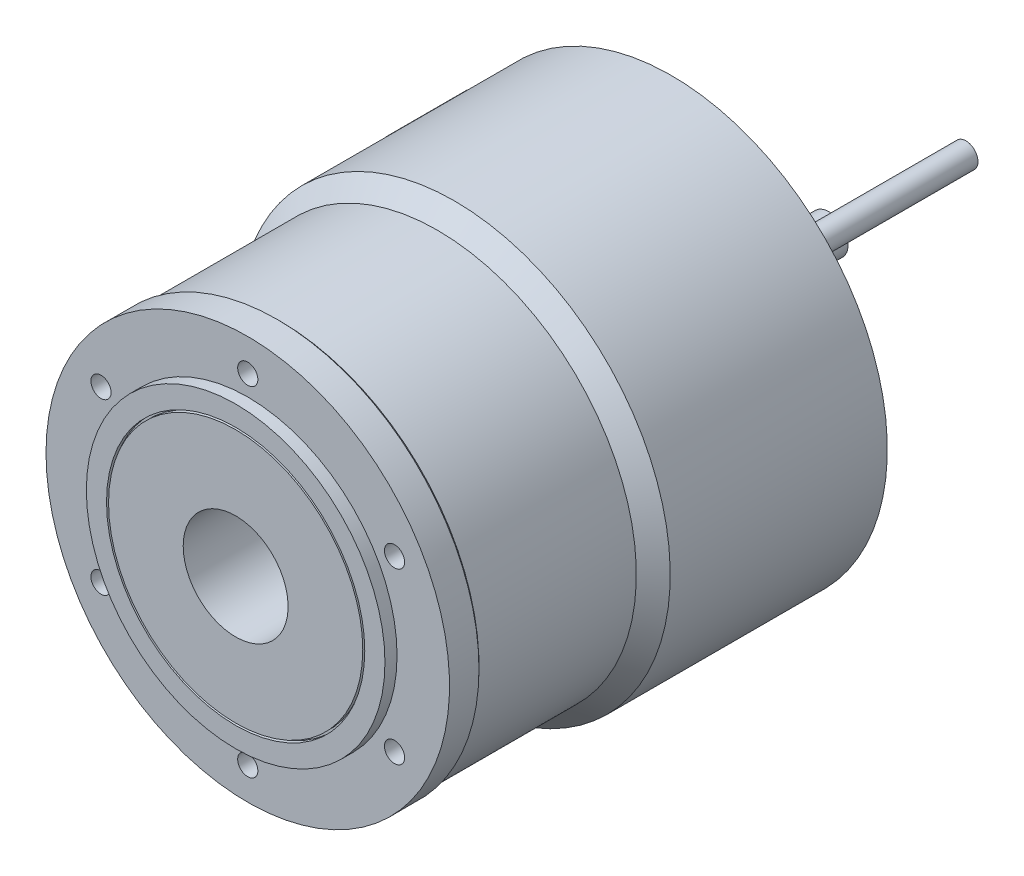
ISO-10303-21;
HEADER;
FILE_DESCRIPTION(('STEP AP214'),'2;1');
FILE_NAME('part.step','',(''),(''),'','','');
FILE_SCHEMA(('AUTOMOTIVE_DESIGN { 1 0 10303 214 1 1 1 1 }'));
ENDSEC;
DATA;
#1=APPLICATION_CONTEXT('core data for automotive mechanical design processes');
#2=APPLICATION_PROTOCOL_DEFINITION('international standard','automotive_design',2000,#1);
#3=PRODUCT_CONTEXT('',#1,'mechanical');
#4=PRODUCT('Part','Part','',(#3));
#5=PRODUCT_RELATED_PRODUCT_CATEGORY('part','',(#4));
#6=PRODUCT_DEFINITION_FORMATION('','',#4);
#7=PRODUCT_DEFINITION_CONTEXT('part definition',#1,'design');
#8=PRODUCT_DEFINITION('design','',#6,#7);
#9=PRODUCT_DEFINITION_SHAPE('','',#8);
#10=(LENGTH_UNIT() NAMED_UNIT(*) SI_UNIT(.MILLI.,.METRE.));
#11=(NAMED_UNIT(*) PLANE_ANGLE_UNIT() SI_UNIT($,.RADIAN.));
#12=(NAMED_UNIT(*) SI_UNIT($,.STERADIAN.) SOLID_ANGLE_UNIT());
#13=UNCERTAINTY_MEASURE_WITH_UNIT(LENGTH_MEASURE(1.E-05),#10,'distance_accuracy_value','');
#14=(GEOMETRIC_REPRESENTATION_CONTEXT(3) GLOBAL_UNCERTAINTY_ASSIGNED_CONTEXT((#13)) GLOBAL_UNIT_ASSIGNED_CONTEXT((#10,
#11,#12)) REPRESENTATION_CONTEXT('',''));
#15=CARTESIAN_POINT('',(0.,0.,0.));
#16=DIRECTION('',(0.,0.,1.));
#17=DIRECTION('',(1.,0.,0.));
#18=AXIS2_PLACEMENT_3D('',#15,#16,#17);
#19=CARTESIAN_POINT('',(-35.447022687,17.543955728,103.));
#20=DIRECTION('',(0.,0.,1.));
#21=DIRECTION('',(0.499999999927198,0.866025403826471,0.));
#22=AXIS2_PLACEMENT_3D('',#19,#20,#21);
#23=PLANE('',#22);
#24=CARTESIAN_POINT('',(-36.373066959,21.,103.));
#25=DIRECTION('',(0.,0.,1.));
#26=DIRECTION('',(1.,0.,0.));
#27=AXIS2_PLACEMENT_3D('',#24,#25,#26);
#28=CIRCLE('',#27,2.5);
#29=CARTESIAN_POINT('',(-33.873066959,21.,103.));
#30=VERTEX_POINT('',#29);
#31=EDGE_CURVE('E20',#30,#30,#28,.F.);
#32=ORIENTED_EDGE('',*,*,#31,.F.);
#33=EDGE_LOOP('',(#32));
#34=FACE_BOUND('',#33,.T.);
#35=ADVANCED_FACE('F16',(#34),#23,.T.);
#36=CARTESIAN_POINT('',(-32.917022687,-21.926044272,103.));
#37=DIRECTION('',(0.,0.,1.));
#38=DIRECTION('',(-0.499999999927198,0.866025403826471,0.));
#39=AXIS2_PLACEMENT_3D('',#36,#37,#38);
#40=PLANE('',#39);
#41=CARTESIAN_POINT('',(-36.373066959,-21.,103.));
#42=DIRECTION('',(0.,0.,1.));
#43=DIRECTION('',(1.,0.,0.));
#44=AXIS2_PLACEMENT_3D('',#41,#42,#43);
#45=CIRCLE('',#44,2.5);
#46=CARTESIAN_POINT('',(-33.873066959,-21.,103.));
#47=VERTEX_POINT('',#46);
#48=EDGE_CURVE('E308',#47,#47,#45,.F.);
#49=ORIENTED_EDGE('',*,*,#48,.F.);
#50=EDGE_LOOP('',(#49));
#51=FACE_BOUND('',#50,.T.);
#52=ADVANCED_FACE('F318',(#51),#40,.T.);
#53=CARTESIAN_POINT('',(2.53,-39.47,103.));
#54=DIRECTION('',(0.,0.,1.));
#55=DIRECTION('',(-1.,0.,0.));
#56=AXIS2_PLACEMENT_3D('',#53,#54,#55);
#57=PLANE('',#56);
#58=CARTESIAN_POINT('',(0.,-42.,103.));
#59=DIRECTION('',(0.,0.,1.));
#60=DIRECTION('',(1.,0.,0.));
#61=AXIS2_PLACEMENT_3D('',#58,#59,#60);
#62=CIRCLE('',#61,2.5);
#63=CARTESIAN_POINT('',(2.5,-42.,103.));
#64=VERTEX_POINT('',#63);
#65=EDGE_CURVE('E306',#64,#64,#62,.F.);
#66=ORIENTED_EDGE('',*,*,#65,.F.);
#67=EDGE_LOOP('',(#66));
#68=FACE_BOUND('',#67,.T.);
#69=ADVANCED_FACE('F324',(#68),#57,.T.);
#70=CARTESIAN_POINT('',(35.447022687,-17.543955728,103.));
#71=DIRECTION('',(0.,0.,1.));
#72=DIRECTION('',(-0.499999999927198,-0.866025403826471,0.));
#73=AXIS2_PLACEMENT_3D('',#70,#71,#72);
#74=PLANE('',#73);
#75=CARTESIAN_POINT('',(36.373066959,-21.,103.));
#76=DIRECTION('',(0.,0.,1.));
#77=DIRECTION('',(1.,0.,0.));
#78=AXIS2_PLACEMENT_3D('',#75,#76,#77);
#79=CIRCLE('',#78,2.5);
#80=CARTESIAN_POINT('',(38.873066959,-21.,103.));
#81=VERTEX_POINT('',#80);
#82=EDGE_CURVE('E303',#81,#81,#79,.F.);
#83=ORIENTED_EDGE('',*,*,#82,.F.);
#84=EDGE_LOOP('',(#83));
#85=FACE_BOUND('',#84,.T.);
#86=ADVANCED_FACE('F1451',(#85),#74,.T.);
#87=CARTESIAN_POINT('',(32.917022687,21.926044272,103.));
#88=DIRECTION('',(0.,0.,1.));
#89=DIRECTION('',(0.499999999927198,-0.866025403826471,0.));
#90=AXIS2_PLACEMENT_3D('',#87,#88,#89);
#91=PLANE('',#90);
#92=CARTESIAN_POINT('',(36.373066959,21.,103.));
#93=DIRECTION('',(0.,0.,1.));
#94=DIRECTION('',(1.,0.,0.));
#95=AXIS2_PLACEMENT_3D('',#92,#93,#94);
#96=CIRCLE('',#95,2.5);
#97=CARTESIAN_POINT('',(38.873066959,21.,103.));
#98=VERTEX_POINT('',#97);
#99=EDGE_CURVE('E300',#98,#98,#96,.F.);
#100=ORIENTED_EDGE('',*,*,#99,.F.);
#101=EDGE_LOOP('',(#100));
#102=FACE_BOUND('',#101,.T.);
#103=ADVANCED_FACE('F1443',(#102),#91,.T.);
#104=CARTESIAN_POINT('',(-2.53,39.47,103.));
#105=DIRECTION('',(0.,0.,1.));
#106=DIRECTION('',(1.,0.,0.));
#107=AXIS2_PLACEMENT_3D('',#104,#105,#106);
#108=PLANE('',#107);
#109=CARTESIAN_POINT('',(0.,42.,103.));
#110=DIRECTION('',(0.,0.,1.));
#111=DIRECTION('',(1.,0.,0.));
#112=AXIS2_PLACEMENT_3D('',#109,#110,#111);
#113=CIRCLE('',#112,2.5);
#114=CARTESIAN_POINT('',(2.5,42.,103.));
#115=VERTEX_POINT('',#114);
#116=EDGE_CURVE('E297',#115,#115,#113,.F.);
#117=ORIENTED_EDGE('',*,*,#116,.F.);
#118=EDGE_LOOP('',(#117));
#119=FACE_BOUND('',#118,.T.);
#120=ADVANCED_FACE('F1436',(#119),#108,.T.);
#121=CARTESIAN_POINT('',(-36.373066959,21.,103.));
#122=DIRECTION('',(0.,0.,1.));
#123=DIRECTION('',(1.,0.,0.));
#124=AXIS2_PLACEMENT_3D('',#121,#122,#123);
#125=CYLINDRICAL_SURFACE('',#124,2.5);
#126=CARTESIAN_POINT('',(-36.373066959,21.,110.));
#127=DIRECTION('',(0.,0.,1.));
#128=DIRECTION('',(1.,0.,0.));
#129=AXIS2_PLACEMENT_3D('',#126,#127,#128);
#130=CIRCLE('',#129,2.5);
#131=CARTESIAN_POINT('',(-33.873066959,21.,110.));
#132=VERTEX_POINT('',#131);
#133=EDGE_CURVE('E294',#132,#132,#130,.F.);
#134=ORIENTED_EDGE('',*,*,#133,.F.);
#135=EDGE_LOOP('',(#134));
#136=FACE_BOUND('',#135,.T.);
#137=ORIENTED_EDGE('',*,*,#31,.T.);
#138=EDGE_LOOP('',(#137));
#139=FACE_BOUND('',#138,.T.);
#140=ADVANCED_FACE('F315',(#136,#139),#125,.F.);
#141=CARTESIAN_POINT('',(-36.373066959,-21.,103.));
#142=DIRECTION('',(0.,0.,1.));
#143=DIRECTION('',(1.,0.,0.));
#144=AXIS2_PLACEMENT_3D('',#141,#142,#143);
#145=CYLINDRICAL_SURFACE('',#144,2.5);
#146=CARTESIAN_POINT('',(-36.373066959,-21.,110.));
#147=DIRECTION('',(0.,0.,1.));
#148=DIRECTION('',(1.,0.,0.));
#149=AXIS2_PLACEMENT_3D('',#146,#147,#148);
#150=CIRCLE('',#149,2.5);
#151=CARTESIAN_POINT('',(-33.873066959,-21.,110.));
#152=VERTEX_POINT('',#151);
#153=EDGE_CURVE('E291',#152,#152,#150,.F.);
#154=ORIENTED_EDGE('',*,*,#153,.F.);
#155=EDGE_LOOP('',(#154));
#156=FACE_BOUND('',#155,.T.);
#157=ORIENTED_EDGE('',*,*,#48,.T.);
#158=EDGE_LOOP('',(#157));
#159=FACE_BOUND('',#158,.T.);
#160=ADVANCED_FACE('F1419',(#156,#159),#145,.F.);
#161=CARTESIAN_POINT('',(0.,-42.,103.));
#162=DIRECTION('',(0.,0.,1.));
#163=DIRECTION('',(1.,0.,0.));
#164=AXIS2_PLACEMENT_3D('',#161,#162,#163);
#165=CYLINDRICAL_SURFACE('',#164,2.5);
#166=CARTESIAN_POINT('',(0.,-42.,110.));
#167=DIRECTION('',(0.,0.,1.));
#168=DIRECTION('',(1.,0.,0.));
#169=AXIS2_PLACEMENT_3D('',#166,#167,#168);
#170=CIRCLE('',#169,2.5);
#171=CARTESIAN_POINT('',(2.5,-42.,110.));
#172=VERTEX_POINT('',#171);
#173=EDGE_CURVE('E288',#172,#172,#170,.F.);
#174=ORIENTED_EDGE('',*,*,#173,.F.);
#175=EDGE_LOOP('',(#174));
#176=FACE_BOUND('',#175,.T.);
#177=ORIENTED_EDGE('',*,*,#65,.T.);
#178=EDGE_LOOP('',(#177));
#179=FACE_BOUND('',#178,.T.);
#180=ADVANCED_FACE('F1410',(#176,#179),#165,.F.);
#181=CARTESIAN_POINT('',(36.373066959,-21.,103.));
#182=DIRECTION('',(0.,0.,1.));
#183=DIRECTION('',(1.,0.,0.));
#184=AXIS2_PLACEMENT_3D('',#181,#182,#183);
#185=CYLINDRICAL_SURFACE('',#184,2.5);
#186=CARTESIAN_POINT('',(36.373066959,-21.,110.));
#187=DIRECTION('',(0.,0.,1.));
#188=DIRECTION('',(1.,0.,0.));
#189=AXIS2_PLACEMENT_3D('',#186,#187,#188);
#190=CIRCLE('',#189,2.5);
#191=CARTESIAN_POINT('',(38.873066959,-21.,110.));
#192=VERTEX_POINT('',#191);
#193=EDGE_CURVE('E285',#192,#192,#190,.F.);
#194=ORIENTED_EDGE('',*,*,#193,.F.);
#195=EDGE_LOOP('',(#194));
#196=FACE_BOUND('',#195,.T.);
#197=ORIENTED_EDGE('',*,*,#82,.T.);
#198=EDGE_LOOP('',(#197));
#199=FACE_BOUND('',#198,.T.);
#200=ADVANCED_FACE('F1401',(#196,#199),#185,.F.);
#201=CARTESIAN_POINT('',(36.373066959,21.,103.));
#202=DIRECTION('',(0.,0.,1.));
#203=DIRECTION('',(1.,0.,0.));
#204=AXIS2_PLACEMENT_3D('',#201,#202,#203);
#205=CYLINDRICAL_SURFACE('',#204,2.5);
#206=CARTESIAN_POINT('',(36.373066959,21.,110.));
#207=DIRECTION('',(0.,0.,1.));
#208=DIRECTION('',(1.,0.,0.));
#209=AXIS2_PLACEMENT_3D('',#206,#207,#208);
#210=CIRCLE('',#209,2.5);
#211=CARTESIAN_POINT('',(38.873066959,21.,110.));
#212=VERTEX_POINT('',#211);
#213=EDGE_CURVE('E282',#212,#212,#210,.F.);
#214=ORIENTED_EDGE('',*,*,#213,.F.);
#215=EDGE_LOOP('',(#214));
#216=FACE_BOUND('',#215,.T.);
#217=ORIENTED_EDGE('',*,*,#99,.T.);
#218=EDGE_LOOP('',(#217));
#219=FACE_BOUND('',#218,.T.);
#220=ADVANCED_FACE('F1392',(#216,#219),#205,.F.);
#221=CARTESIAN_POINT('',(0.,42.,103.));
#222=DIRECTION('',(0.,0.,1.));
#223=DIRECTION('',(1.,0.,0.));
#224=AXIS2_PLACEMENT_3D('',#221,#222,#223);
#225=CYLINDRICAL_SURFACE('',#224,2.5);
#226=CARTESIAN_POINT('',(0.,42.,110.));
#227=DIRECTION('',(0.,0.,1.));
#228=DIRECTION('',(1.,0.,0.));
#229=AXIS2_PLACEMENT_3D('',#226,#227,#228);
#230=CIRCLE('',#229,2.5);
#231=CARTESIAN_POINT('',(2.5,42.,110.));
#232=VERTEX_POINT('',#231);
#233=EDGE_CURVE('E279',#232,#232,#230,.F.);
#234=ORIENTED_EDGE('',*,*,#233,.F.);
#235=EDGE_LOOP('',(#234));
#236=FACE_BOUND('',#235,.T.);
#237=ORIENTED_EDGE('',*,*,#116,.T.);
#238=EDGE_LOOP('',(#237));
#239=FACE_BOUND('',#238,.T.);
#240=ADVANCED_FACE('F1384',(#236,#239),#225,.F.);
#241=CARTESIAN_POINT('',(-50.6,50.6,110.));
#242=DIRECTION('',(0.,0.,1.));
#243=DIRECTION('',(0.,-1.,0.));
#244=AXIS2_PLACEMENT_3D('',#241,#242,#243);
#245=PLANE('',#244);
#246=CARTESIAN_POINT('',(0.,0.,110.));
#247=DIRECTION('',(0.,0.,-1.));
#248=DIRECTION('',(-1.,0.,0.));
#249=AXIS2_PLACEMENT_3D('',#246,#247,#248);
#250=CIRCLE('',#249,37.);
#251=CARTESIAN_POINT('',(-37.,0.,110.));
#252=VERTEX_POINT('',#251);
#253=EDGE_CURVE('E273',#252,#252,#250,.T.);
#254=ORIENTED_EDGE('',*,*,#253,.T.);
#255=EDGE_LOOP('',(#254));
#256=FACE_BOUND('',#255,.T.);
#257=ORIENTED_EDGE('',*,*,#233,.T.);
#258=EDGE_LOOP('',(#257));
#259=FACE_BOUND('',#258,.T.);
#260=ORIENTED_EDGE('',*,*,#213,.T.);
#261=EDGE_LOOP('',(#260));
#262=FACE_BOUND('',#261,.T.);
#263=ORIENTED_EDGE('',*,*,#193,.T.);
#264=EDGE_LOOP('',(#263));
#265=FACE_BOUND('',#264,.T.);
#266=ORIENTED_EDGE('',*,*,#173,.T.);
#267=EDGE_LOOP('',(#266));
#268=FACE_BOUND('',#267,.T.);
#269=ORIENTED_EDGE('',*,*,#153,.T.);
#270=EDGE_LOOP('',(#269));
#271=FACE_BOUND('',#270,.T.);
#272=ORIENTED_EDGE('',*,*,#133,.T.);
#273=EDGE_LOOP('',(#272));
#274=FACE_BOUND('',#273,.T.);
#275=CARTESIAN_POINT('',(0.,0.,110.));
#276=DIRECTION('',(0.,0.,-1.));
#277=DIRECTION('',(-1.,0.,0.));
#278=AXIS2_PLACEMENT_3D('',#275,#276,#277);
#279=CIRCLE('',#278,50.);
#280=CARTESIAN_POINT('',(-50.,0.,110.));
#281=VERTEX_POINT('',#280);
#282=EDGE_CURVE('E276',#281,#281,#279,.F.);
#283=ORIENTED_EDGE('',*,*,#282,.T.);
#284=EDGE_LOOP('',(#283));
#285=FACE_BOUND('',#284,.T.);
#286=ADVANCED_FACE('F1375',(#256,#259,#262,#265,#268,#271,#274,#285),#245,.T.);
#287=CARTESIAN_POINT('',(0.,0.,110.));
#288=DIRECTION('',(0.,0.,-1.));
#289=DIRECTION('',(-1.,0.,0.));
#290=AXIS2_PLACEMENT_3D('',#287,#288,#289);
#291=CYLINDRICAL_SURFACE('',#290,50.);
#292=ORIENTED_EDGE('',*,*,#282,.F.);
#293=EDGE_LOOP('',(#292));
#294=FACE_BOUND('',#293,.T.);
#295=CARTESIAN_POINT('',(0.,0.,102.7));
#296=DIRECTION('',(0.,0.,1.));
#297=DIRECTION('',(0.,-1.,0.));
#298=AXIS2_PLACEMENT_3D('',#295,#296,#297);
#299=CIRCLE('',#298,50.);
#300=CARTESIAN_POINT('',(0.,-50.,102.7));
#301=VERTEX_POINT('',#300);
#302=EDGE_CURVE('E272',#301,#301,#299,.T.);
#303=ORIENTED_EDGE('',*,*,#302,.T.);
#304=EDGE_LOOP('',(#303));
#305=FACE_BOUND('',#304,.T.);
#306=ADVANCED_FACE('F1367',(#294,#305),#291,.T.);
#307=CARTESIAN_POINT('',(0.,0.,113.));
#308=DIRECTION('',(0.,0.,-1.));
#309=DIRECTION('',(-1.,0.,0.));
#310=AXIS2_PLACEMENT_3D('',#307,#308,#309);
#311=CYLINDRICAL_SURFACE('',#310,37.);
#312=CARTESIAN_POINT('',(0.,0.,113.));
#313=DIRECTION('',(0.,0.,-1.));
#314=DIRECTION('',(-1.,0.,0.));
#315=AXIS2_PLACEMENT_3D('',#312,#313,#314);
#316=CIRCLE('',#315,37.);
#317=CARTESIAN_POINT('',(-37.,0.,113.));
#318=VERTEX_POINT('',#317);
#319=EDGE_CURVE('E269',#318,#318,#316,.F.);
#320=ORIENTED_EDGE('',*,*,#319,.F.);
#321=EDGE_LOOP('',(#320));
#322=FACE_BOUND('',#321,.T.);
#323=ORIENTED_EDGE('',*,*,#253,.F.);
#324=EDGE_LOOP('',(#323));
#325=FACE_BOUND('',#324,.T.);
#326=ADVANCED_FACE('F1359',(#322,#325),#311,.T.);
#327=CARTESIAN_POINT('',(0.,0.,102.));
#328=DIRECTION('',(0.,0.,1.));
#329=DIRECTION('',(1.,0.,0.));
#330=AXIS2_PLACEMENT_3D('',#327,#328,#329);
#331=CONICAL_SURFACE('',#330,49.3,0.785398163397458);
#332=CARTESIAN_POINT('',(0.,0.,102.));
#333=DIRECTION('',(0.,0.,-1.));
#334=DIRECTION('',(0.,1.,0.));
#335=AXIS2_PLACEMENT_3D('',#332,#333,#334);
#336=CIRCLE('',#335,49.3);
#337=CARTESIAN_POINT('',(0.,49.3,102.));
#338=VERTEX_POINT('',#337);
#339=EDGE_CURVE('E268',#338,#338,#336,.F.);
#340=ORIENTED_EDGE('',*,*,#339,.T.);
#341=EDGE_LOOP('',(#340));
#342=FACE_BOUND('',#341,.T.);
#343=ORIENTED_EDGE('',*,*,#302,.F.);
#344=EDGE_LOOP('',(#343));
#345=FACE_BOUND('',#344,.T.);
#346=ADVANCED_FACE('F1351',(#342,#345),#331,.T.);
#347=CARTESIAN_POINT('',(-37.444,37.444,113.));
#348=DIRECTION('',(0.,0.,1.));
#349=DIRECTION('',(0.,-1.,0.));
#350=AXIS2_PLACEMENT_3D('',#347,#348,#349);
#351=PLANE('',#350);
#352=CARTESIAN_POINT('',(0.,0.,113.));
#353=DIRECTION('',(0.,0.,1.));
#354=DIRECTION('',(0.,-1.,0.));
#355=AXIS2_PLACEMENT_3D('',#352,#353,#354);
#356=CIRCLE('',#355,32.);
#357=CARTESIAN_POINT('',(0.,-32.,113.));
#358=VERTEX_POINT('',#357);
#359=EDGE_CURVE('E245',#358,#358,#356,.T.);
#360=ORIENTED_EDGE('',*,*,#359,.F.);
#361=EDGE_LOOP('',(#360));
#362=FACE_BOUND('',#361,.T.);
#363=ORIENTED_EDGE('',*,*,#319,.T.);
#364=EDGE_LOOP('',(#363));
#365=FACE_BOUND('',#364,.T.);
#366=ADVANCED_FACE('F1344',(#362,#365),#351,.T.);
#367=CARTESIAN_POINT('',(0.,0.,36.));
#368=DIRECTION('',(0.,0.,-1.));
#369=DIRECTION('',(-1.,0.,0.));
#370=AXIS2_PLACEMENT_3D('',#367,#368,#369);
#371=CYLINDRICAL_SURFACE('',#370,53.6);
#372=DIRECTION('',(0.,0.,1.));
#373=VECTOR('',#372,1.);
#374=CARTESIAN_POINT('',(-39.649850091,36.06728972,26.));
#375=LINE('',#374,#373);
#376=CARTESIAN_POINT('',(-39.6498500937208,36.0672897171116,16.));
#377=VERTEX_POINT('',#376);
#378=CARTESIAN_POINT('',(-39.6498500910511,36.0672897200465,36.));
#379=VERTEX_POINT('',#378);
#380=EDGE_CURVE('E259',#377,#379,#375,.T.);
#381=ORIENTED_EDGE('',*,*,#380,.F.);
#382=CARTESIAN_POINT('',(0.,0.,16.));
#383=DIRECTION('',(0.,0.,-1.));
#384=DIRECTION('',(-1.,0.,0.));
#385=AXIS2_PLACEMENT_3D('',#382,#383,#384);
#386=CIRCLE('',#385,53.6);
#387=CARTESIAN_POINT('',(-53.5414476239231,2.50467289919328,16.));
#388=VERTEX_POINT('',#387);
#389=EDGE_CURVE('E241',#388,#377,#386,.T.);
#390=ORIENTED_EDGE('',*,*,#389,.F.);
#391=DIRECTION('',(0.,0.,1.));
#392=VECTOR('',#391,1.);
#393=CARTESIAN_POINT('',(-53.541447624,2.504672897,26.));
#394=LINE('',#393,#392);
#395=CARTESIAN_POINT('',(-53.5414476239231,2.50467289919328,36.));
#396=VERTEX_POINT('',#395);
#397=EDGE_CURVE('E234',#388,#396,#394,.T.);
#398=ORIENTED_EDGE('',*,*,#397,.T.);
#399=CARTESIAN_POINT('',(0.,0.,36.));
#400=DIRECTION('',(0.,0.,-1.));
#401=DIRECTION('',(-1.,0.,0.));
#402=AXIS2_PLACEMENT_3D('',#399,#400,#401);
#403=CIRCLE('',#402,53.6);
#404=EDGE_CURVE('E238',#379,#396,#403,.F.);
#405=ORIENTED_EDGE('',*,*,#404,.F.);
#406=EDGE_LOOP('',(#381,#390,#398,#405));
#407=FACE_BOUND('',#406,.T.);
#408=ADVANCED_FACE('F236',(#407),#371,.T.);
#409=CARTESIAN_POINT('',(0.,0.,33.305904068));
#410=DIRECTION('',(0.,0.,-1.));
#411=DIRECTION('',(-1.,0.,0.));
#412=AXIS2_PLACEMENT_3D('',#409,#410,#411);
#413=CYLINDRICAL_SURFACE('',#412,53.6);
#414=CARTESIAN_POINT('',(-46.6763518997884,-26.3491588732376,16.));
#415=CARTESIAN_POINT('',(-46.6597666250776,-26.3785388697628,16.0000044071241));
#416=CARTESIAN_POINT('',(-46.6431645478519,-26.4078838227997,16.0010922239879));
#417=CARTESIAN_POINT('',(-46.6099378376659,-26.4664851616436,16.0054217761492));
#418=CARTESIAN_POINT('',(-46.5933132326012,-26.4957412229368,16.008668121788));
#419=CARTESIAN_POINT('',(-46.5337733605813,-26.6002899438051,16.024156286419));
#420=CARTESIAN_POINT('',(-46.4910289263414,-26.6749170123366,16.0424965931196));
#421=CARTESIAN_POINT('',(-46.4282852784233,-26.7838778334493,16.0806101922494));
#422=CARTESIAN_POINT('',(-46.4075715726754,-26.8197495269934,16.0951096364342));
#423=CARTESIAN_POINT('',(-46.3667848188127,-26.8902010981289,16.1276906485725));
#424=CARTESIAN_POINT('',(-46.3467114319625,-26.92478166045,16.1457702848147));
#425=CARTESIAN_POINT('',(-46.3074818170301,-26.9921959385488,16.1853098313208));
#426=CARTESIAN_POINT('',(-46.2883213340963,-27.025037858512,16.2067515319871));
#427=CARTESIAN_POINT('',(-46.2510348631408,-27.0888009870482,16.2531047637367));
#428=CARTESIAN_POINT('',(-46.2329086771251,-27.1197225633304,16.278015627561));
#429=CARTESIAN_POINT('',(-46.1979166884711,-27.1792877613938,16.3310711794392));
#430=CARTESIAN_POINT('',(-46.1810481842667,-27.2079362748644,16.3592085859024));
#431=CARTESIAN_POINT('',(-46.1487677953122,-27.2626528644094,16.4187315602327));
#432=CARTESIAN_POINT('',(-46.1333573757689,-27.2887183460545,16.4501203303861));
#433=CARTESIAN_POINT('',(-46.1080740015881,-27.3314097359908,16.5073548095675));
#434=CARTESIAN_POINT('',(-46.0978042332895,-27.3487259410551,16.5325146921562));
#435=CARTESIAN_POINT('',(-46.0782942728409,-27.3815843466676,16.5843628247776));
#436=CARTESIAN_POINT('',(-46.0690543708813,-27.3971260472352,16.6110515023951));
#437=CARTESIAN_POINT('',(-46.0517421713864,-27.4262161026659,16.6658274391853));
#438=CARTESIAN_POINT('',(-46.0436688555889,-27.4397661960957,16.6939134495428));
#439=CARTESIAN_POINT('',(-46.0287982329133,-27.4647036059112,16.7513397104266));
#440=CARTESIAN_POINT('',(-46.0220002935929,-27.4760919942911,16.7806793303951));
#441=CARTESIAN_POINT('',(-46.0097166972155,-27.4966564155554,16.8405931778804));
#442=CARTESIAN_POINT('',(-46.0042390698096,-27.505818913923,16.8711737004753));
#443=CARTESIAN_POINT('',(-45.9947119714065,-27.5217469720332,16.9331484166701));
#444=CARTESIAN_POINT('',(-45.9906614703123,-27.5285142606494,16.964542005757));
#445=CARTESIAN_POINT('',(-45.9840964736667,-27.5394791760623,17.0279259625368));
#446=CARTESIAN_POINT('',(-45.9815813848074,-27.543677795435,17.0599160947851));
#447=CARTESIAN_POINT('',(-45.9781139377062,-27.5494654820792,17.1242097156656));
#448=CARTESIAN_POINT('',(-45.9771618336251,-27.5510541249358,17.1565132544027));
#449=CARTESIAN_POINT('',(-45.9766601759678,-27.5518916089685,17.2478744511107));
#450=CARTESIAN_POINT('',(-45.978916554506,-27.5481275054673,17.3070104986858));
#451=CARTESIAN_POINT('',(-45.9886503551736,-27.53187464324,17.423672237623));
#452=CARTESIAN_POINT('',(-45.9961323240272,-27.5193782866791,17.4811964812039));
#453=CARTESIAN_POINT('',(-46.0105061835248,-27.495334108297,17.5632235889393));
#454=CARTESIAN_POINT('',(-46.0155895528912,-27.4868265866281,17.5889944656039));
#455=CARTESIAN_POINT('',(-46.0267372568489,-27.4681556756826,17.6397187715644));
#456=CARTESIAN_POINT('',(-46.0328015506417,-27.4579923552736,17.6646722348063));
#457=CARTESIAN_POINT('',(-46.0458407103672,-27.4361206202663,17.7135736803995));
#458=CARTESIAN_POINT('',(-46.0528135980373,-27.4244155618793,17.7375237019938));
#459=CARTESIAN_POINT('',(-46.0676049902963,-27.39956166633,17.7843885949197));
#460=CARTESIAN_POINT('',(-46.075423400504,-27.3864129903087,17.8073035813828));
#461=CARTESIAN_POINT('',(-46.0836278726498,-27.3726002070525,17.8296606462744));
#462=B_SPLINE_CURVE_WITH_KNOTS('',3,(#414,#415,#416,#417,#418,#419,#420,#421,#422,#423,#424,
#425,#426,#427,#428,#429,#430,#431,#432,#433,#434,#435,#436,#437,#438,#439,#440,#441,#442,#443,
#444,#445,#446,#447,#448,#449,#450,#451,#452,#453,#454,#455,#456,#457,#458,#459,#460,#461),
.UNSPECIFIED.,.F.,.F.,(4,2,2,2,2,2,2,2,2,2,2,2,2,2,2,2,2,2,2,2,2,2,2,4),(0.,0.101152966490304,
0.202522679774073,0.464857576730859,0.596393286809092,0.72785821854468,0.858634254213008,
0.989385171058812,1.11984661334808,1.25043779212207,1.34701306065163,1.44361547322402,
1.54013304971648,1.63660263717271,1.73364489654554,1.83061696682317,1.92755154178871,
2.02450187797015,2.20146239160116,2.378577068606,2.46134988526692,2.54411926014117,
2.62671134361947,2.70929421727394),.UNSPECIFIED.);
#463=CARTESIAN_POINT('',(-46.6763519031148,-26.3491588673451,16.));
#464=VERTEX_POINT('',#463);
#465=CARTESIAN_POINT('',(-46.0836278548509,-27.3726002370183,17.829660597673));
#466=VERTEX_POINT('',#465);
#467=EDGE_CURVE('E566',#464,#466,#462,.T.);
#468=ORIENTED_EDGE('',*,*,#467,.T.);
#469=CARTESIAN_POINT('',(-49.9746554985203,-19.377662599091,30.7760696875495));
#470=CARTESIAN_POINT('',(-49.9613259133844,-19.412039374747,30.7204024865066));
#471=CARTESIAN_POINT('',(-49.9479571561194,-19.4464119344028,30.6647421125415));
#472=CARTESIAN_POINT('',(-49.8809170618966,-19.6182539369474,30.3864739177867));
#473=CARTESIAN_POINT('',(-49.8266572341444,-19.7556598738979,30.163968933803));
#474=CARTESIAN_POINT('',(-49.5521903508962,-20.4423697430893,29.0519618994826));
#475=CARTESIAN_POINT('',(-49.3225085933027,-20.9906404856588,28.1641329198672));
#476=CARTESIAN_POINT('',(-48.8672173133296,-22.028210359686,26.4839692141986));
#477=CARTESIAN_POINT('',(-48.643634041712,-22.5177557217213,25.6912357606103));
#478=CARTESIAN_POINT('',(-48.1794090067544,-23.4946158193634,24.1093809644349));
#479=CARTESIAN_POINT('',(-47.9387671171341,-23.9819305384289,23.3202596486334));
#480=CARTESIAN_POINT('',(-47.4396353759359,-24.954766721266,21.7449208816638));
#481=CARTESIAN_POINT('',(-47.1811209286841,-25.4402847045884,20.9587090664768));
#482=CARTESIAN_POINT('',(-46.6460390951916,-26.4085729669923,19.3907348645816));
#483=CARTESIAN_POINT('',(-46.369471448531,-26.8913432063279,18.6089725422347));
#484=CARTESIAN_POINT('',(-46.0836278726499,-27.3726002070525,17.8296606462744));
#485=B_SPLINE_CURVE_WITH_KNOTS('',3,(#469,#470,#471,#472,#473,#474,#475,#476,#477,#478,#479,
#480,#481,#482,#483,#484),.UNSPECIFIED.,.F.,.F.,(4,2,2,2,2,2,2,4),(0.,0.200310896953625,
1.00155665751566,4.20668291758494,7.08101503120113,9.95536842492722,12.8337593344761,
15.7121917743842),.UNSPECIFIED.);
#486=CARTESIAN_POINT('',(-49.9746554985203,-19.377662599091,30.7760696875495));
#487=VERTEX_POINT('',#486);
#488=EDGE_CURVE('E560',#487,#466,#485,.T.);
#489=ORIENTED_EDGE('',*,*,#488,.F.);
#490=CARTESIAN_POINT('',(-49.9746554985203,-19.377662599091,30.7760696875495));
#491=CARTESIAN_POINT('',(-49.9880977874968,-19.3429949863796,30.8322196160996));
#492=CARTESIAN_POINT('',(-50.00190449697,-19.3072808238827,30.8876467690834));
#493=CARTESIAN_POINT('',(-50.0444574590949,-19.1968363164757,31.0520065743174));
#494=CARTESIAN_POINT('',(-50.0742488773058,-19.1190281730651,31.1586212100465));
#495=CARTESIAN_POINT('',(-50.1363156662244,-18.9556714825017,31.3650349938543));
#496=CARTESIAN_POINT('',(-50.1685921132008,-18.8701195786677,31.4648311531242));
#497=CARTESIAN_POINT('',(-50.2352243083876,-18.6920109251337,31.6571104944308));
#498=CARTESIAN_POINT('',(-50.2695790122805,-18.5994576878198,31.7495972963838));
#499=CARTESIAN_POINT('',(-50.3400092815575,-18.4079840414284,31.9269986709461));
#500=CARTESIAN_POINT('',(-50.3760847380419,-18.3090640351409,32.0119137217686));
#501=CARTESIAN_POINT('',(-50.4496755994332,-18.1053019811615,32.173645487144));
#502=CARTESIAN_POINT('',(-50.4871910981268,-18.0004595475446,32.2504616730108));
#503=CARTESIAN_POINT('',(-50.563315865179,-17.7855019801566,32.3956427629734));
#504=CARTESIAN_POINT('',(-50.6019248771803,-17.6753880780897,32.4640096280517));
#505=CARTESIAN_POINT('',(-50.6797929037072,-17.4508648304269,32.5920412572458));
#506=CARTESIAN_POINT('',(-50.7190499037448,-17.3364677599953,32.6517288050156));
#507=CARTESIAN_POINT('',(-50.7981399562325,-17.1033371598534,32.7623410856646));
#508=CARTESIAN_POINT('',(-50.8379741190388,-16.984594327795,32.8132455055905));
#509=CARTESIAN_POINT('',(-50.9178653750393,-16.7435708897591,32.9058342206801));
#510=CARTESIAN_POINT('',(-50.9579226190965,-16.621287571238,32.9475112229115));
#511=CARTESIAN_POINT('',(-51.0787364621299,-16.2478074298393,33.0593662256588));
#512=CARTESIAN_POINT('',(-51.1594166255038,-15.9920903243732,33.1153727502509));
#513=CARTESIAN_POINT('',(-51.2786258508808,-15.6038800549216,33.1693980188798));
#514=CARTESIAN_POINT('',(-51.3181053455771,-15.4735496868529,33.1824066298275));
#515=CARTESIAN_POINT('',(-51.3962426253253,-15.211996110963,33.1984148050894));
#516=CARTESIAN_POINT('',(-51.4349003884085,-15.0807728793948,33.2014141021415));
#517=CARTESIAN_POINT('',(-51.5169087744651,-14.7984074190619,33.1971202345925));
#518=CARTESIAN_POINT('',(-51.5600902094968,-14.6472392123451,33.1882103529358));
#519=CARTESIAN_POINT('',(-51.6447757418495,-14.3457882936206,33.1567866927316));
#520=CARTESIAN_POINT('',(-51.6862794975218,-14.1955057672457,33.1342701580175));
#521=CARTESIAN_POINT('',(-51.7470201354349,-13.9718244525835,33.0904709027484));
#522=CARTESIAN_POINT('',(-51.767000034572,-13.8976096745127,33.0742164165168));
#523=CARTESIAN_POINT('',(-51.8064461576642,-13.7498358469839,33.0384339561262));
#524=CARTESIAN_POINT('',(-51.8259123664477,-13.6762768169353,33.0189058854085));
#525=CARTESIAN_POINT('',(-51.8834778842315,-13.4568771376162,32.9553886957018));
#526=CARTESIAN_POINT('',(-51.9207727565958,-13.3122081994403,32.9064459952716));
#527=CARTESIAN_POINT('',(-51.9741204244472,-13.1017464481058,32.8244440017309));
#528=CARTESIAN_POINT('',(-51.9911049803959,-13.0341772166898,32.7964184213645));
#529=CARTESIAN_POINT('',(-52.0245087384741,-12.9002034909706,32.7374276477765));
#530=CARTESIAN_POINT('',(-52.0409280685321,-12.8337987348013,32.706463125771));
#531=CARTESIAN_POINT('',(-52.0731931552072,-12.702249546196,32.6416485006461));
#532=CARTESIAN_POINT('',(-52.0890387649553,-12.6371054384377,32.6077976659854));
#533=CARTESIAN_POINT('',(-52.120143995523,-12.5081968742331,32.53729127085));
#534=CARTESIAN_POINT('',(-52.1354034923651,-12.4444327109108,32.5006351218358));
#535=CARTESIAN_POINT('',(-52.1792363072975,-12.2598085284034,32.3891379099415));
#536=CARTESIAN_POINT('',(-52.2069895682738,-12.1410152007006,32.3104966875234));
#537=CARTESIAN_POINT('',(-52.2601473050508,-11.9101243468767,32.1431452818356));
#538=CARTESIAN_POINT('',(-52.2855507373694,-11.7980298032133,32.0544306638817));
#539=CARTESIAN_POINT('',(-52.3339769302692,-11.5813292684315,31.8676444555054));
#540=CARTESIAN_POINT('',(-52.3569991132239,-11.476725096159,31.7695706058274));
#541=CARTESIAN_POINT('',(-52.4006251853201,-11.2758605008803,31.5648120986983));
#542=CARTESIAN_POINT('',(-52.421230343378,-11.1795957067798,31.4581320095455));
#543=CARTESIAN_POINT('',(-52.4564000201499,-11.0132621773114,31.2571201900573));
#544=CARTESIAN_POINT('',(-52.4713775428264,-10.941637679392,31.1641431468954));
#545=CARTESIAN_POINT('',(-52.499677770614,-10.805029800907,30.9735227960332));
#546=CARTESIAN_POINT('',(-52.5130042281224,-10.7400314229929,30.8758907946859));
#547=CARTESIAN_POINT('',(-52.5255320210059,-10.6784121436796,30.7760696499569));
#548=B_SPLINE_CURVE_WITH_KNOTS('',3,(#490,#491,#492,#493,#494,#495,#496,#497,#498,#499,#500,
#501,#502,#503,#504,#505,#506,#507,#508,#509,#510,#511,#512,#513,#514,#515,#516,#517,#518,#519,
#520,#521,#522,#523,#524,#525,#526,#527,#528,#529,#530,#531,#532,#533,#534,#535,#536,#537,#538,
#539,#540,#541,#542,#543,#544,#545,#546,#547),.UNSPECIFIED.,.F.,.F.,(4,2,2,2,2,2,2,2,2,2,2,2,2,
2,2,2,2,2,2,2,2,2,2,2,2,2,2,2,4),(0.,0.2020455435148,0.60752385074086,1.01317876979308,
1.41863151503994,1.82405863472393,2.22951220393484,2.63487149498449,3.03914670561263,
3.44434471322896,3.8498618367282,4.66815663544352,5.07826046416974,5.48837524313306,
5.96020375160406,6.43212786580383,6.6677352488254,6.90334958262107,7.37424500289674,
7.59948354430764,7.82467076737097,8.04991523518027,8.27520708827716,8.71007973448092,
9.14514457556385,9.58031470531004,10.0152553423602,10.3699246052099,10.7237724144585),.UNSPECIFIED.);
#549=CARTESIAN_POINT('',(-52.5255320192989,-10.6784121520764,30.7760696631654));
#550=VERTEX_POINT('',#549);
#551=EDGE_CURVE('E591',#487,#550,#548,.T.);
#552=ORIENTED_EDGE('',*,*,#551,.T.);
#553=CARTESIAN_POINT('',(-53.532784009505,-2.68347464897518,17.829660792));
#554=CARTESIAN_POINT('',(-53.5310265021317,-2.71853525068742,17.8864353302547));
#555=CARTESIAN_POINT('',(-53.5292344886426,-2.75359538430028,17.9432091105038));
#556=CARTESIAN_POINT('',(-53.5201018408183,-2.92889388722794,18.2270745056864));
#557=CARTESIAN_POINT('',(-53.5122435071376,-3.06912491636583,18.4541542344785));
#558=CARTESIAN_POINT('',(-53.4954215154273,-3.34956859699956,18.9082839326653));
#559=CARTESIAN_POINT('',(-53.4864578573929,-3.48978124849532,19.1353339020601));
#560=CARTESIAN_POINT('',(-53.4674241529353,-3.77018589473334,19.589400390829));
#561=CARTESIAN_POINT('',(-53.4573541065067,-3.9103778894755,19.8164169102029));
#562=CARTESIAN_POINT('',(-53.4361064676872,-4.19073848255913,20.2704120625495));
#563=CARTESIAN_POINT('',(-53.4249288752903,-4.33090708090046,20.4973906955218));
#564=CARTESIAN_POINT('',(-53.3662670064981,-5.03170632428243,21.6322130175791));
#565=CARTESIAN_POINT('',(-53.3104650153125,-5.59215095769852,22.5397554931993));
#566=CARTESIAN_POINT('',(-53.1584539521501,-6.90777063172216,24.6701724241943));
#567=CARTESIAN_POINT('',(-53.054940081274,-7.66271479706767,25.8926730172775));
#568=CARTESIAN_POINT('',(-52.8150150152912,-9.17155404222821,28.3359753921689));
#569=CARTESIAN_POINT('',(-52.6785866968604,-9.92544836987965,29.5567759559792));
#570=CARTESIAN_POINT('',(-52.5255320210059,-10.6784121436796,30.7760696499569));
#571=B_SPLINE_CURVE_WITH_KNOTS('',3,(#553,#554,#555,#556,#557,#558,#559,#560,#561,#562,#563,
#564,#565,#566,#567,#568,#569,#570),.UNSPECIFIED.,.F.,.F.,(4,2,2,2,2,2,2,2,4),(0.,
0.200252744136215,1.0012653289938,1.80227791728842,2.60329050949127,3.40430310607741,
6.60845780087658,10.9297044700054,15.2532040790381),.UNSPECIFIED.);
#572=CARTESIAN_POINT('',(-53.5327840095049,-2.68347464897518,17.829660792));
#573=VERTEX_POINT('',#572);
#574=EDGE_CURVE('E539',#573,#550,#571,.T.);
#575=ORIENTED_EDGE('',*,*,#574,.F.);
#576=CARTESIAN_POINT('',(-53.5327840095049,-2.68347464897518,17.829660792));
#577=CARTESIAN_POINT('',(-53.5336743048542,-2.66571182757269,17.8009230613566));
#578=CARTESIAN_POINT('',(-53.5344951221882,-2.64916261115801,17.7714303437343));
#579=CARTESIAN_POINT('',(-53.5359993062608,-2.61859050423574,17.7110929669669));
#580=CARTESIAN_POINT('',(-53.5366824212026,-2.60457224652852,17.6802459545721));
#581=CARTESIAN_POINT('',(-53.5379086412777,-2.57924379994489,17.6175066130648));
#582=CARTESIAN_POINT('',(-53.5384519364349,-2.56792993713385,17.5856157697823));
#583=CARTESIAN_POINT('',(-53.5394045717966,-2.54799086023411,17.5209992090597));
#584=CARTESIAN_POINT('',(-53.5398138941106,-2.53936600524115,17.4882733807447));
#585=CARTESIAN_POINT('',(-53.540497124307,-2.52491995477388,17.4221779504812));
#586=CARTESIAN_POINT('',(-53.5407709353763,-2.51910076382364,17.3888079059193));
#587=CARTESIAN_POINT('',(-53.541182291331,-2.51034186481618,17.3216876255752));
#588=CARTESIAN_POINT('',(-53.5413197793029,-2.50740335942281,17.2879372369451));
#589=CARTESIAN_POINT('',(-53.5415315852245,-2.5028820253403,17.1869321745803));
#590=CARTESIAN_POINT('',(-53.5414101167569,-2.50548917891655,17.1194380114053));
#591=CARTESIAN_POINT('',(-53.5406342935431,-2.52201169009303,16.985879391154));
#592=CARTESIAN_POINT('',(-53.5399799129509,-2.53592759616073,16.9198150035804));
#593=CARTESIAN_POINT('',(-53.5381310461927,-2.57466468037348,16.7908896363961));
#594=CARTESIAN_POINT('',(-53.5369359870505,-2.59949742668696,16.7280321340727));
#595=CARTESIAN_POINT('',(-53.5339965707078,-2.65934286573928,16.607375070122));
#596=CARTESIAN_POINT('',(-53.5322521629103,-2.6943564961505,16.5495759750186));
#597=CARTESIAN_POINT('',(-53.5282069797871,-2.7735579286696,16.4406897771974));
#598=CARTESIAN_POINT('',(-53.5259063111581,-2.81774397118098,16.3896013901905));
#599=CARTESIAN_POINT('',(-53.5207521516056,-2.91400200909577,16.2955292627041));
#600=CARTESIAN_POINT('',(-53.5178986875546,-2.96607362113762,16.2525451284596));
#601=CARTESIAN_POINT('',(-53.5116421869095,-3.07688759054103,16.1757456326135));
#602=CARTESIAN_POINT('',(-53.5082368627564,-3.13565739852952,16.1419700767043));
#603=CARTESIAN_POINT('',(-53.5009266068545,-3.2580061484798,16.0847633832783));
#604=CARTESIAN_POINT('',(-53.4970217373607,-3.32158449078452,16.0613309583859));
#605=CARTESIAN_POINT('',(-53.4896025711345,-3.43876982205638,16.0290031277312));
#606=CARTESIAN_POINT('',(-53.4861646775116,-3.49185005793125,16.0181450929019));
#607=CARTESIAN_POINT('',(-53.479067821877,-3.5989211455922,16.0036385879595));
#608=CARTESIAN_POINT('',(-53.4754090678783,-3.65291110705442,15.9999834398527));
#609=CARTESIAN_POINT('',(-53.471663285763,-3.70691589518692,16.));
#610=B_SPLINE_CURVE_WITH_KNOTS('',3,(#576,#577,#578,#579,#580,#581,#582,#583,#584,#585,#586,
#587,#588,#589,#590,#591,#592,#593,#594,#595,#596,#597,#598,#599,#600,#601,#602,#603,#604,#605,
#606,#607,#608,#609),.UNSPECIFIED.,.F.,.F.,(4,2,2,2,2,2,2,2,2,2,2,2,2,2,2,2,4),(0.,
0.101361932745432,0.202907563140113,0.304314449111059,0.405734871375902,0.507227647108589,
0.608762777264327,0.81036157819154,1.01197015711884,1.21379289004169,1.41563421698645,
1.61743685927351,1.81922969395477,2.0218814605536,2.22450799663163,2.38690073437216,
2.54914284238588),.UNSPECIFIED.);
#611=CARTESIAN_POINT('',(-53.4716632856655,-3.70691589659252,16.));
#612=VERTEX_POINT('',#611);
#613=EDGE_CURVE('E531',#573,#612,#610,.T.);
#614=ORIENTED_EDGE('',*,*,#613,.T.);
#615=CARTESIAN_POINT('',(0.,0.,16.));
#616=DIRECTION('',(0.,0.,-1.));
#617=DIRECTION('',(-1.,0.,0.));
#618=AXIS2_PLACEMENT_3D('',#615,#616,#617);
#619=CIRCLE('',#618,53.6);
#620=EDGE_CURVE('E572',#464,#612,#619,.T.);
#621=ORIENTED_EDGE('',*,*,#620,.F.);
#622=EDGE_LOOP('',(#468,#489,#552,#575,#614,#621));
#623=FACE_BOUND('',#622,.T.);
#624=ADVANCED_FACE('F546',(#623),#413,.T.);
#625=CARTESIAN_POINT('',(0.,0.,102.));
#626=DIRECTION('',(0.,0.,-1.));
#627=DIRECTION('',(-1.,0.,0.));
#628=AXIS2_PLACEMENT_3D('',#625,#626,#627);
#629=CYLINDRICAL_SURFACE('',#628,49.3);
#630=ORIENTED_EDGE('',*,*,#339,.F.);
#631=EDGE_LOOP('',(#630));
#632=FACE_BOUND('',#631,.T.);
#633=CARTESIAN_POINT('',(0.,0.,62.9999999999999));
#634=DIRECTION('',(0.,0.,-1.));
#635=DIRECTION('',(0.,1.,0.));
#636=AXIS2_PLACEMENT_3D('',#633,#634,#635);
#637=CIRCLE('',#636,49.3);
#638=CARTESIAN_POINT('',(0.,49.3,63.));
#639=VERTEX_POINT('',#638);
#640=EDGE_CURVE('E599',#639,#639,#637,.F.);
#641=ORIENTED_EDGE('',*,*,#640,.T.);
#642=EDGE_LOOP('',(#641));
#643=FACE_BOUND('',#642,.T.);
#644=ADVANCED_FACE('F551',(#632,#643),#629,.T.);
#645=CARTESIAN_POINT('',(0.,0.,112.));
#646=DIRECTION('',(0.,0.,1.));
#647=DIRECTION('',(0.,-1.,0.));
#648=AXIS2_PLACEMENT_3D('',#645,#646,#647);
#649=CYLINDRICAL_SURFACE('',#648,32.);
#650=ORIENTED_EDGE('',*,*,#359,.T.);
#651=EDGE_LOOP('',(#650));
#652=FACE_BOUND('',#651,.T.);
#653=CARTESIAN_POINT('',(0.,0.,112.));
#654=DIRECTION('',(0.,0.,1.));
#655=DIRECTION('',(0.,-1.,0.));
#656=AXIS2_PLACEMENT_3D('',#653,#654,#655);
#657=CIRCLE('',#656,32.);
#658=CARTESIAN_POINT('',(0.,-32.,112.));
#659=VERTEX_POINT('',#658);
#660=EDGE_CURVE('E597',#659,#659,#657,.T.);
#661=ORIENTED_EDGE('',*,*,#660,.F.);
#662=EDGE_LOOP('',(#661));
#663=FACE_BOUND('',#662,.T.);
#664=ADVANCED_FACE('F859',(#652,#663),#649,.F.);
#665=CARTESIAN_POINT('',(-53.441556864,2.5,36.));
#666=DIRECTION('',(0.0467289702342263,0.998907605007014,0.));
#667=DIRECTION('',(0.,0.,-1.));
#668=AXIS2_PLACEMENT_3D('',#665,#666,#667);
#669=PLANE('',#668);
#670=DIRECTION('',(0.,0.,-1.));
#671=VECTOR('',#670,1.);
#672=CARTESIAN_POINT('',(-53.4415568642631,2.49999998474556,31.9));
#673=LINE('',#672,#671);
#674=CARTESIAN_POINT('',(-53.4415568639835,2.49999999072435,16.0000000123));
#675=VERTEX_POINT('',#674);
#676=CARTESIAN_POINT('',(-53.4415568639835,2.49999999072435,35.9999999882));
#677=VERTEX_POINT('',#676);
#678=EDGE_CURVE('E251',#675,#677,#673,.F.);
#679=ORIENTED_EDGE('',*,*,#678,.T.);
#680=DIRECTION('',(0.998907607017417,-0.0467289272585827,0.));
#681=VECTOR('',#680,1.);
#682=CARTESIAN_POINT('',(-53.5414476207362,2.50467290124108,36.));
#683=LINE('',#682,#681);
#684=EDGE_CURVE('E244',#396,#677,#683,.T.);
#685=ORIENTED_EDGE('',*,*,#684,.F.);
#686=ORIENTED_EDGE('',*,*,#397,.F.);
#687=DIRECTION('',(-0.998907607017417,0.0467289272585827,0.));
#688=VECTOR('',#687,1.);
#689=CARTESIAN_POINT('',(-53.4415568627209,2.50000000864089,16.));
#690=LINE('',#689,#688);
#691=EDGE_CURVE('E883',#675,#388,#690,.T.);
#692=ORIENTED_EDGE('',*,*,#691,.F.);
#693=EDGE_LOOP('',(#679,#685,#686,#692));
#694=FACE_BOUND('',#693,.T.);
#695=ADVANCED_FACE('F249',(#694),#669,.F.);
#696=CARTESIAN_POINT('',(-53.625241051,2.298596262,36.));
#697=DIRECTION('',(0.,0.,1.));
#698=DIRECTION('',(1.,0.,0.));
#699=AXIS2_PLACEMENT_3D('',#696,#697,#698);
#700=PLANE('',#699);
#701=DIRECTION('',(0.739736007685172,-0.672897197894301,0.));
#702=VECTOR('',#701,1.);
#703=CARTESIAN_POINT('',(-39.6128632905,36.03364486,36.));
#704=LINE('',#703,#702);
#705=CARTESIAN_POINT('',(-39.5758764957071,35.9999999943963,35.9999999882));
#706=VERTEX_POINT('',#705);
#707=EDGE_CURVE('E257',#379,#706,#704,.T.);
#708=ORIENTED_EDGE('',*,*,#707,.F.);
#709=ORIENTED_EDGE('',*,*,#404,.T.);
#710=ORIENTED_EDGE('',*,*,#684,.T.);
#711=CARTESIAN_POINT('',(0.,0.,35.9999999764));
#712=DIRECTION('',(0.,0.,-1.));
#713=DIRECTION('',(-1.,0.,0.));
#714=AXIS2_PLACEMENT_3D('',#711,#712,#713);
#715=CIRCLE('',#714,53.5);
#716=EDGE_CURVE('E595',#677,#706,#715,.T.);
#717=ORIENTED_EDGE('',*,*,#716,.T.);
#718=EDGE_LOOP('',(#708,#709,#710,#717));
#719=FACE_BOUND('',#718,.T.);
#720=ADVANCED_FACE('F255',(#719),#700,.T.);
#721=CARTESIAN_POINT('',(-39.57587649,36.,36.));
#722=DIRECTION('',(0.672897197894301,0.739736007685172,0.));
#723=DIRECTION('',(0.,0.,-1.));
#724=AXIS2_PLACEMENT_3D('',#721,#722,#723);
#725=PLANE('',#724);
#726=ORIENTED_EDGE('',*,*,#380,.T.);
#727=ORIENTED_EDGE('',*,*,#707,.T.);
#728=DIRECTION('',(0.,0.,1.));
#729=VECTOR('',#728,1.);
#730=CARTESIAN_POINT('',(-39.5758764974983,35.9999999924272,31.9));
#731=LINE('',#730,#729);
#732=CARTESIAN_POINT('',(-39.5758764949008,35.9999999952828,16.0000000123));
#733=VERTEX_POINT('',#732);
#734=EDGE_CURVE('E592',#706,#733,#731,.F.);
#735=ORIENTED_EDGE('',*,*,#734,.T.);
#736=DIRECTION('',(0.739736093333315,-0.672897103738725,0.));
#737=VECTOR('',#736,1.);
#738=CARTESIAN_POINT('',(-39.6498500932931,36.0672897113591,16.));
#739=LINE('',#738,#737);
#740=EDGE_CURVE('E263',#377,#733,#739,.T.);
#741=ORIENTED_EDGE('',*,*,#740,.F.);
#742=EDGE_LOOP('',(#726,#727,#735,#741));
#743=FACE_BOUND('',#742,.T.);
#744=ADVANCED_FACE('F887',(#743),#725,.T.);
#745=CARTESIAN_POINT('',(-39.492083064,2.298596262,16.));
#746=DIRECTION('',(0.,0.,-1.));
#747=DIRECTION('',(-1.,0.,0.));
#748=AXIS2_PLACEMENT_3D('',#745,#746,#747);
#749=PLANE('',#748);
#750=ORIENTED_EDGE('',*,*,#691,.T.);
#751=ORIENTED_EDGE('',*,*,#389,.T.);
#752=ORIENTED_EDGE('',*,*,#740,.T.);
#753=CARTESIAN_POINT('',(0.,0.,16.0000000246));
#754=DIRECTION('',(0.,0.,-1.));
#755=DIRECTION('',(-1.,0.,0.));
#756=AXIS2_PLACEMENT_3D('',#753,#754,#755);
#757=CIRCLE('',#756,53.5);
#758=EDGE_CURVE('E594',#733,#675,#757,.F.);
#759=ORIENTED_EDGE('',*,*,#758,.T.);
#760=EDGE_LOOP('',(#750,#751,#752,#759));
#761=FACE_BOUND('',#760,.T.);
#762=ADVANCED_FACE('F872',(#761),#749,.T.);
#763=CARTESIAN_POINT('',(-52.5265217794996,-10.6786133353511,30.77606961));
#764=CARTESIAN_POINT('',(-52.5027504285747,-10.7955410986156,30.96541019));
#765=CARTESIAN_POINT('',(-52.4763041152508,-10.9236452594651,31.145577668));
#766=CARTESIAN_POINT('',(-52.4175690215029,-11.2020969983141,31.487566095));
#767=CARTESIAN_POINT('',(-52.3851384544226,-11.3530892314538,31.649996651));
#768=CARTESIAN_POINT('',(-52.3144244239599,-11.6746033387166,31.954073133));
#769=CARTESIAN_POINT('',(-52.2764521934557,-11.8437312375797,32.094548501));
#770=CARTESIAN_POINT('',(-52.2152015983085,-12.1098836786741,32.287917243));
#771=CARTESIAN_POINT('',(-52.194068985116,-12.2006777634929,32.349482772));
#772=CARTESIAN_POINT('',(-52.1503062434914,-12.3864011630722,32.466832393));
#773=CARTESIAN_POINT('',(-52.1274824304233,-12.4821327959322,32.523054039));
#774=CARTESIAN_POINT('',(-52.0578233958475,-12.7706874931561,32.680421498));
#775=CARTESIAN_POINT('',(-52.0090290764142,-12.9681457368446,32.772314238));
#776=CARTESIAN_POINT('',(-51.9320364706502,-13.2718789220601,32.890624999));
#777=CARTESIAN_POINT('',(-51.905738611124,-13.3743808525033,32.926807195));
#778=CARTESIAN_POINT('',(-51.8653065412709,-13.5300082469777,32.976198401));
#779=CARTESIAN_POINT('',(-51.8516649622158,-13.5821964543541,32.991848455));
#780=CARTESIAN_POINT('',(-51.8240474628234,-13.6871956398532,33.021521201));
#781=CARTESIAN_POINT('',(-51.8099202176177,-13.7405748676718,33.035685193));
#782=CARTESIAN_POINT('',(-51.7399464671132,-14.0033401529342,33.101023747));
#783=CARTESIAN_POINT('',(-51.682163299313,-14.2151814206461,33.139747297));
#784=CARTESIAN_POINT('',(-51.5926800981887,-14.5353332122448,33.177511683));
#785=CARTESIAN_POINT('',(-51.5623842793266,-14.6424487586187,33.186712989));
#786=CARTESIAN_POINT('',(-51.5008393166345,-14.8574670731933,33.198341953));
#787=CARTESIAN_POINT('',(-51.4693131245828,-14.9663152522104,33.200761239));
#788=CARTESIAN_POINT('',(-51.3120262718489,-15.5030460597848,33.196007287));
#789=CARTESIAN_POINT('',(-51.1826800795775,-15.9245729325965,33.139261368));
#790=CARTESIAN_POINT('',(-50.9831017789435,-16.5480883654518,32.973928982));
#791=CARTESIAN_POINT('',(-50.9168209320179,-16.7507912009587,32.906386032));
#792=CARTESIAN_POINT('',(-50.8180281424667,-17.0472031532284,32.786423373));
#793=CARTESIAN_POINT('',(-50.7852018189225,-17.144733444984,32.743327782));
#794=CARTESIAN_POINT('',(-50.7198001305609,-17.337257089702,32.650920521));
#795=CARTESIAN_POINT('',(-50.6874779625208,-17.4315186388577,32.602018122));
#796=CARTESIAN_POINT('',(-50.5894296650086,-17.7149045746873,32.443531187));
#797=CARTESIAN_POINT('',(-50.5257474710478,-17.8955487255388,32.32701366));
#798=CARTESIAN_POINT('',(-50.4331357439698,-18.1542138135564,32.135948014));
#799=CARTESIAN_POINT('',(-50.4027500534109,-18.2383852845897,32.069544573));
#800=CARTESIAN_POINT('',(-50.3579438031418,-18.3615815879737,31.965867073));
#801=CARTESIAN_POINT('',(-50.3431370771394,-18.4021368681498,31.930629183));
#802=CARTESIAN_POINT('',(-50.3137882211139,-18.4822294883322,31.858795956));
#803=CARTESIAN_POINT('',(-50.2994303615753,-18.5212676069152,31.822677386));
#804=CARTESIAN_POINT('',(-50.1681151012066,-18.8770264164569,31.482919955));
#805=CARTESIAN_POINT('',(-50.0643307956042,-19.149185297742,31.1466331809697));
#806=CARTESIAN_POINT('',(-49.9755971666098,-19.3780277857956,30.77606961));
#807=CARTESIAN_POINT('',(-52.525532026,-10.678412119,30.77606961));
#808=CARTESIAN_POINT('',(-52.501761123,-10.795337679,30.96541019));
#809=CARTESIAN_POINT('',(-52.475315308,-10.923439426,31.145577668));
#810=CARTESIAN_POINT('',(-52.416581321,-11.201885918,31.487566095));
#811=CARTESIAN_POINT('',(-52.384151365,-11.352875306,31.649996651));
#812=CARTESIAN_POINT('',(-52.313438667,-11.674383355,31.954073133));
#813=CARTESIAN_POINT('',(-52.275467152,-11.843508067,32.094548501));
#814=CARTESIAN_POINT('',(-52.214217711,-12.109655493,32.287917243));
#815=CARTESIAN_POINT('',(-52.193085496,-12.200447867,32.349482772));
#816=CARTESIAN_POINT('',(-52.149323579,-12.386167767,32.466832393));
#817=CARTESIAN_POINT('',(-52.126500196,-12.481897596,32.523054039));
#818=CARTESIAN_POINT('',(-52.056842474,-12.770446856,32.680421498));
#819=CARTESIAN_POINT('',(-52.008049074,-12.967901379,32.772314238));
#820=CARTESIAN_POINT('',(-51.931057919,-13.271628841,32.890624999));
#821=CARTESIAN_POINT('',(-51.904760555,-13.37412884,32.926807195));
#822=CARTESIAN_POINT('',(-51.864329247,-13.529753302,32.976198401));
#823=CARTESIAN_POINT('',(-51.850687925,-13.581940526,32.991848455));
#824=CARTESIAN_POINT('',(-51.823070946,-13.686937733,33.021521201));
#825=CARTESIAN_POINT('',(-51.808943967,-13.740315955,33.035685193));
#826=CARTESIAN_POINT('',(-51.738971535,-14.003076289,33.101023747));
#827=CARTESIAN_POINT('',(-51.681189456,-14.214913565,33.139747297));
#828=CARTESIAN_POINT('',(-51.591707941,-14.535059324,33.177511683));
#829=CARTESIAN_POINT('',(-51.561412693,-14.642172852,33.186712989));
#830=CARTESIAN_POINT('',(-51.49986889,-14.857187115,33.198341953));
#831=CARTESIAN_POINT('',(-51.468343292,-14.966033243,33.200761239));
#832=CARTESIAN_POINT('',(-51.311059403,-15.502753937,33.196007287));
#833=CARTESIAN_POINT('',(-51.181715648,-15.924272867,33.139261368));
#834=CARTESIAN_POINT('',(-50.982141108,-16.547776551,32.973928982));
#835=CARTESIAN_POINT('',(-50.91586151,-16.750475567,32.906386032));
#836=CARTESIAN_POINT('',(-50.817070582,-17.046881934,32.786423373));
#837=CARTESIAN_POINT('',(-50.784244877,-17.144410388,32.743327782));
#838=CARTESIAN_POINT('',(-50.718844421,-17.336930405,32.650920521));
#839=CARTESIAN_POINT('',(-50.686522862,-17.431190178,32.602018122));
#840=CARTESIAN_POINT('',(-50.588476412,-17.714570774,32.443531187));
#841=CARTESIAN_POINT('',(-50.524795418,-17.895211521,32.32701366));
#842=CARTESIAN_POINT('',(-50.432185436,-18.153871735,32.135948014));
#843=CARTESIAN_POINT('',(-50.401800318,-18.23804162,32.069544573));
#844=CARTESIAN_POINT('',(-50.356994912,-18.361235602,31.965867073));
#845=CARTESIAN_POINT('',(-50.342188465,-18.401790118,31.930629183));
#846=CARTESIAN_POINT('',(-50.312840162,-18.481881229,31.858795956));
#847=CARTESIAN_POINT('',(-50.298482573,-18.520918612,31.822677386));
#848=CARTESIAN_POINT('',(-50.167169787,-18.876670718,31.482919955));
#849=CARTESIAN_POINT('',(-50.063387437,-19.148824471,31.146633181));
#850=CARTESIAN_POINT('',(-49.97465548,-19.377662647,30.77606961));
#851=CARTESIAN_POINT('',(-52.42753663,-10.658489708,30.77606961));
#852=CARTESIAN_POINT('',(-52.403810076,-10.775197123,30.96541019));
#853=CARTESIAN_POINT('',(-52.3774136,-10.903059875,31.145577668));
#854=CARTESIAN_POINT('',(-52.318789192,-11.180986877,31.487566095));
#855=CARTESIAN_POINT('',(-52.286419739,-11.331694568,31.649996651));
#856=CARTESIAN_POINT('',(-52.215838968,-11.652602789,31.954073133));
#857=CARTESIAN_POINT('',(-52.177938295,-11.82141197,32.094548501));
#858=CARTESIAN_POINT('',(-52.116803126,-12.087062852,32.287917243));
#859=CARTESIAN_POINT('',(-52.095710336,-12.177685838,32.349482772));
#860=CARTESIAN_POINT('',(-52.052030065,-12.363059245,32.466832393));
#861=CARTESIAN_POINT('',(-52.029249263,-12.458610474,32.523054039));
#862=CARTESIAN_POINT('',(-51.959721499,-12.746621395,32.680421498));
#863=CARTESIAN_POINT('',(-51.911019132,-12.943707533,32.772314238));
#864=CARTESIAN_POINT('',(-51.834171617,-13.24686834,32.890624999));
#865=CARTESIAN_POINT('',(-51.807923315,-13.349177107,32.926807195));
#866=CARTESIAN_POINT('',(-51.767567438,-13.504511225,32.976198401));
#867=CARTESIAN_POINT('',(-51.753951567,-13.556601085,32.991848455));
#868=CARTESIAN_POINT('',(-51.726386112,-13.661402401,33.021521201));
#869=CARTESIAN_POINT('',(-51.71228549,-13.714681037,33.035685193));
#870=CARTESIAN_POINT('',(-51.642443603,-13.976951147,33.101023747));
#871=CARTESIAN_POINT('',(-51.584769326,-14.188393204,33.139747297));
#872=CARTESIAN_POINT('',(-51.495454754,-14.507941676,33.177511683));
#873=CARTESIAN_POINT('',(-51.465216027,-14.614855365,33.186712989));
#874=CARTESIAN_POINT('',(-51.403787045,-14.829468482,33.198341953));
#875=CARTESIAN_POINT('',(-51.372320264,-14.938111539,33.200761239));
#876=CARTESIAN_POINT('',(-51.215329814,-15.473830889,33.196007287));
#877=CARTESIAN_POINT('',(-51.086227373,-15.894563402,33.139261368));
#878=CARTESIAN_POINT('',(-50.887025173,-16.516903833,32.973928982));
#879=CARTESIAN_POINT('',(-50.820869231,-16.71922468,32.906386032));
#880=CARTESIAN_POINT('',(-50.722262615,-17.01507805,32.786423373));
#881=CARTESIAN_POINT('',(-50.689498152,-17.112424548,32.743327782));
#882=CARTESIAN_POINT('',(-50.624219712,-17.304585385,32.650920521));
#883=CARTESIAN_POINT('',(-50.591958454,-17.398669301,32.602018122));
#884=CARTESIAN_POINT('',(-50.494094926,-17.681521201,32.443531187));
#885=CARTESIAN_POINT('',(-50.43053274,-17.861824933,32.32701366));
#886=CARTESIAN_POINT('',(-50.338095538,-18.120002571,32.135948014));
#887=CARTESIAN_POINT('',(-50.307767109,-18.204015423,32.069544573));
#888=CARTESIAN_POINT('',(-50.263045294,-18.326979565,31.965867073));
#889=CARTESIAN_POINT('',(-50.248266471,-18.36745842,31.930629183));
#890=CARTESIAN_POINT('',(-50.218972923,-18.447400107,31.858795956));
#891=CARTESIAN_POINT('',(-50.20464212,-18.48636466,31.822677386));
#892=CARTESIAN_POINT('',(-50.073574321,-18.841453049,31.482919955));
#893=CARTESIAN_POINT('',(-49.969985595,-19.113099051,31.146633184));
#894=CARTESIAN_POINT('',(-49.881419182,-19.341510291,30.77606961));
#895=CARTESIAN_POINT('',(-52.42655667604,-10.65829048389,30.77606961));
#896=CARTESIAN_POINT('',(-52.40283056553,-10.77499571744,30.96541019));
#897=CARTESIAN_POINT('',(-52.37643458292,-10.90285607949,31.145577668));
#898=CARTESIAN_POINT('',(-52.31781127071,-11.18077788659,31.487566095));
#899=CARTESIAN_POINT('',(-52.28544242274,-11.33148276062,31.649996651));
#900=CARTESIAN_POINT('',(-52.21486297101,-11.65238498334,31.954073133));
#901=CARTESIAN_POINT('',(-52.17696300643,-11.82119100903,32.094548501));
#902=CARTESIAN_POINT('',(-52.11582898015,-12.08683692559,32.287917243));
#903=CARTESIAN_POINT('',(-52.0947365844,-12.17745821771,32.349482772));
#904=CARTESIAN_POINT('',(-52.05105712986,-12.36282815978,32.466832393));
#905=CARTESIAN_POINT('',(-52.02827675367,-12.45837760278,32.523054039));
#906=CARTESIAN_POINT('',(-51.95875028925,-12.74638314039,32.680421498));
#907=CARTESIAN_POINT('',(-51.91004883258,-12.94346559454,32.772314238));
#908=CARTESIAN_POINT('',(-51.83320275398,-13.24662073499,32.890624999));
#909=CARTESIAN_POINT('',(-51.8069549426,-13.34892758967,32.926807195));
#910=CARTESIAN_POINT('',(-51.76659981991,-13.50425880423,32.976198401));
#911=CARTESIAN_POINT('',(-51.75298420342,-13.55634769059,32.991848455));
#912=CARTESIAN_POINT('',(-51.72541926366,-13.66114704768,33.021521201));
#913=CARTESIAN_POINT('',(-51.71131890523,-13.71442468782,33.035685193));
#914=CARTESIAN_POINT('',(-51.64147832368,-13.97668989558,33.101023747));
#915=CARTESIAN_POINT('',(-51.5838051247,-14.18812800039,33.139747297));
#916=CARTESIAN_POINT('',(-51.49449222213,-14.50767049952,33.177511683));
#917=CARTESIAN_POINT('',(-51.46425406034,-14.61458219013,33.186712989));
#918=CARTESIAN_POINT('',(-51.40282622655,-14.82919129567,33.198341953));
#919=CARTESIAN_POINT('',(-51.37136003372,-14.93783232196,33.200761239));
#920=CARTESIAN_POINT('',(-51.21437251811,-15.47354165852,33.196007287));
#921=CARTESIAN_POINT('',(-51.08527249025,-15.89426630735,33.139261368));
#922=CARTESIAN_POINT('',(-50.88607401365,-16.51659510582,32.973928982));
#923=CARTESIAN_POINT('',(-50.81991930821,-16.71891217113,32.906386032));
#924=CARTESIAN_POINT('',(-50.72131453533,-17.01476001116,32.786423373));
#925=CARTESIAN_POINT('',(-50.68855068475,-17.1121046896,32.743327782));
#926=CARTESIAN_POINT('',(-50.62327346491,-17.3042619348,32.650920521));
#927=CARTESIAN_POINT('',(-50.59101280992,-17.39834409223,32.602018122));
#928=CARTESIAN_POINT('',(-50.49315111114,-17.68119070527,32.443531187));
#929=CARTESIAN_POINT('',(-50.42959011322,-17.86149106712,32.32701366));
#930=CARTESIAN_POINT('',(-50.33715463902,-18.11966387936,32.135948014));
#931=CARTESIAN_POINT('',(-50.30682677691,-18.20367516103,32.069544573));
#932=CARTESIAN_POINT('',(-50.26210579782,-18.32663700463,31.965867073));
#933=CARTESIAN_POINT('',(-50.24732725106,-18.36711510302,31.930629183));
#934=CARTESIAN_POINT('',(-50.21803425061,-18.44705529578,31.858795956));
#935=CARTESIAN_POINT('',(-50.20370371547,-18.48601912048,31.822677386));
#936=CARTESIAN_POINT('',(-50.07263836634,-18.84110087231,31.482919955));
#937=CARTESIAN_POINT('',(-49.96905157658,-19.1127417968,31.14663318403));
#938=CARTESIAN_POINT('',(-49.88048681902,-19.34114876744,30.77606961));
#939=B_SPLINE_SURFACE_WITH_KNOTS('',1,3,((#763,#764,#765,#766,#767,#768,#769,#770,#771,#772,
#773,#774,#775,#776,#777,#778,#779,#780,#781,#782,#783,#784,#785,#786,#787,#788,#789,#790,#791,
#792,#793,#794,#795,#796,#797,#798,#799,#800,#801,#802,#803,#804,#805,#806),(#807,#808,#809,
#810,#811,#812,#813,#814,#815,#816,#817,#818,#819,#820,#821,#822,#823,#824,#825,#826,#827,#828,
#829,#830,#831,#832,#833,#834,#835,#836,#837,#838,#839,#840,#841,#842,#843,#844,#845,#846,#847,
#848,#849,#850),(#851,#852,#853,#854,#855,#856,#857,#858,#859,#860,#861,#862,#863,#864,#865,
#866,#867,#868,#869,#870,#871,#872,#873,#874,#875,#876,#877,#878,#879,#880,#881,#882,#883,#884,
#885,#886,#887,#888,#889,#890,#891,#892,#893,#894),(#895,#896,#897,#898,#899,#900,#901,#902,
#903,#904,#905,#906,#907,#908,#909,#910,#911,#912,#913,#914,#915,#916,#917,#918,#919,#920,#921,
#922,#923,#924,#925,#926,#927,#928,#929,#930,#931,#932,#933,#934,#935,#936,#937,#938)),
.UNSPECIFIED.,.F.,.F.,.F.,(2,1,1,2),(4,2,2,2,2,2,2,2,2,2,2,2,2,2,2,2,2,2,2,2,2,4),(-0.0101,0.,
1.,1.01),(0.,0.0625,0.125,0.1875,0.21875,0.25,0.3125,0.34375,0.359375,0.375,0.4375,0.46875,0.5,
0.625,0.6875,0.71875,0.75,0.8125,0.84375,0.859375,0.875,1.),.UNSPECIFIED.);
#940=CARTESIAN_POINT('',(-49.8814191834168,-19.3415102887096,30.776069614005));
#941=CARTESIAN_POINT('',(-49.8947111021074,-19.3072304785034,30.8316949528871));
#942=CARTESIAN_POINT('',(-49.9083603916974,-19.2719244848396,30.8866128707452));
#943=CARTESIAN_POINT('',(-49.9504123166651,-19.1627870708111,31.0494577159));
#944=CARTESIAN_POINT('',(-49.9798399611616,-19.0859384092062,31.1551179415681));
#945=CARTESIAN_POINT('',(-50.041151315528,-18.9246036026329,31.3598223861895));
#946=CARTESIAN_POINT('',(-50.0730372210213,-18.840110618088,31.4588605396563));
#947=CARTESIAN_POINT('',(-50.1392000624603,-18.6633225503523,31.6507522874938));
#948=CARTESIAN_POINT('',(-50.1734973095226,-18.5709593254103,31.7435360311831));
#949=CARTESIAN_POINT('',(-50.2438376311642,-18.3798030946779,31.9215614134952));
#950=CARTESIAN_POINT('',(-50.2798811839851,-18.2810083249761,32.0068009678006));
#951=CARTESIAN_POINT('',(-50.3534679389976,-18.0773338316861,32.1692703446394));
#952=CARTESIAN_POINT('',(-50.3910130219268,-17.9724463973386,32.2464896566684));
#953=CARTESIAN_POINT('',(-50.4672212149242,-17.7573253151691,32.3924490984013));
#954=CARTESIAN_POINT('',(-50.5058843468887,-17.6470915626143,32.4611890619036));
#955=CARTESIAN_POINT('',(-50.588999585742,-17.4075041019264,32.5983736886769));
#956=CARTESIAN_POINT('',(-50.633557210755,-17.2775135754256,32.665645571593));
#957=CARTESIAN_POINT('',(-50.7232588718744,-17.0123658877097,32.7886595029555));
#958=CARTESIAN_POINT('',(-50.7684029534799,-16.8772083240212,32.8444006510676));
#959=CARTESIAN_POINT('',(-50.858857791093,-16.6026344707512,32.9439620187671));
#960=CARTESIAN_POINT('',(-50.904168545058,-16.4632182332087,32.987782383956));
#961=CARTESIAN_POINT('',(-50.9945446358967,-16.1811113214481,33.0635106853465));
#962=CARTESIAN_POINT('',(-51.0396099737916,-16.0384206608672,33.0954186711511));
#963=CARTESIAN_POINT('',(-51.1303934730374,-15.7466452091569,33.1474970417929));
#964=CARTESIAN_POINT('',(-51.1760952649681,-15.5974926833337,33.167318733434));
#965=CARTESIAN_POINT('',(-51.2665028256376,-15.297718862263,33.1936282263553));
#966=CARTESIAN_POINT('',(-51.3112085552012,-15.1470975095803,33.2001155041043));
#967=CARTESIAN_POINT('',(-51.3993015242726,-14.845420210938,33.1999051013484));
#968=CARTESIAN_POINT('',(-51.4426883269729,-14.6943641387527,33.1932031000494));
#969=CARTESIAN_POINT('',(-51.5278176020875,-14.3930026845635,33.1661985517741));
#970=CARTESIAN_POINT('',(-51.5695601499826,-14.2426972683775,33.1458966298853));
#971=CARTESIAN_POINT('',(-51.6504744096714,-13.9463869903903,33.0922744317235));
#972=CARTESIAN_POINT('',(-51.6896765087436,-13.8003517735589,33.0591669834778));
#973=CARTESIAN_POINT('',(-51.7660116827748,-13.5111948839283,32.9802056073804));
#974=CARTESIAN_POINT('',(-51.8031446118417,-13.3680734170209,32.934350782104));
#975=CARTESIAN_POINT('',(-51.8750643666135,-13.0862075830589,32.829895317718));
#976=CARTESIAN_POINT('',(-51.9098546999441,-12.9474568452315,32.7713143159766));
#977=CARTESIAN_POINT('',(-51.9769901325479,-12.6752571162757,32.6418808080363));
#978=CARTESIAN_POINT('',(-52.0093361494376,-12.5418061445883,32.5710329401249));
#979=CARTESIAN_POINT('',(-52.0701274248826,-12.2869130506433,32.4209607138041));
#980=CARTESIAN_POINT('',(-52.0986814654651,-12.1652009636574,32.342238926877));
#981=CARTESIAN_POINT('',(-52.1533283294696,-11.9287495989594,32.1743646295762));
#982=CARTESIAN_POINT('',(-52.1794231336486,-11.8140047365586,32.0852206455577));
#983=CARTESIAN_POINT('',(-52.2270412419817,-11.6015944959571,31.9051235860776));
#984=CARTESIAN_POINT('',(-52.2487644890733,-11.5033048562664,31.8149573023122));
#985=CARTESIAN_POINT('',(-52.2901358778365,-11.3137569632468,31.6270161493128));
#986=CARTESIAN_POINT('',(-52.3097834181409,-11.2225007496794,31.5292390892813));
#987=CARTESIAN_POINT('',(-52.3470427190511,-11.047405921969,31.3260003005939));
#988=CARTESIAN_POINT('',(-52.3646438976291,-10.9636063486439,31.2205028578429));
#989=CARTESIAN_POINT('',(-52.3894294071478,-10.84432278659,31.0573704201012));
#990=CARTESIAN_POINT('',(-52.3974222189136,-10.8056291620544,31.0021757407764));
#991=CARTESIAN_POINT('',(-52.4128762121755,-10.7304183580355,30.8902512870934));
#992=CARTESIAN_POINT('',(-52.4203374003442,-10.6939011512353,30.8335215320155));
#993=CARTESIAN_POINT('',(-52.4275366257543,-10.6584897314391,30.776069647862));
#994=B_SPLINE_CURVE_WITH_KNOTS('',3,(#940,#941,#942,#943,#944,#945,#946,#947,#948,#949,#950,
#951,#952,#953,#954,#955,#956,#957,#958,#959,#960,#961,#962,#963,#964,#965,#966,#967,#968,#969,
#970,#971,#972,#973,#974,#975,#976,#977,#978,#979,#980,#981,#982,#983,#984,#985,#986,#987,#988,
#989,#990,#991,#992,#993),.UNSPECIFIED.,.F.,.F.,(4,2,2,2,2,2,2,2,2,2,2,2,2,2,2,2,2,2,2,2,2,2,2,
2,2,2,4),(0.,0.200044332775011,0.601384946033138,1.0030882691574,1.40871495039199,
1.81445335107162,2.22071693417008,2.62698847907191,3.08546100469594,3.54396931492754,
4.00247202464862,4.46097282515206,4.93214282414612,5.40333132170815,5.8746742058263,
6.34599542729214,6.80979837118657,7.27363397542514,7.7367588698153,8.19970903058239,
8.64238947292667,9.08471026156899,9.48972280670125,9.89485237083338,10.3019915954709,
10.5055811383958,10.7091681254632),.UNSPECIFIED.);
#995=CARTESIAN_POINT('',(-49.8814191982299,-19.3415102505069,30.7760696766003));
#996=VERTEX_POINT('',#995);
#997=CARTESIAN_POINT('',(-52.4275366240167,-10.6584897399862,30.7760696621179));
#998=VERTEX_POINT('',#997);
#999=EDGE_CURVE('E475',#996,#998,#994,.T.);
#1000=DIRECTION('',(0.979953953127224,0.199224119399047,0.));
#1001=VECTOR('',#1000,1.);
#1002=CARTESIAN_POINT('',(-52.4765343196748,-10.6684509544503,30.7760696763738));
#1003=LINE('',#1002,#1001);
#1004=EDGE_CURVE('E588',#550,#998,#1003,.T.);
#1005=DIRECTION('',(-0.932362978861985,-0.361523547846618,0.));
#1006=VECTOR('',#1005,1.);
#1007=CARTESIAN_POINT('',(-49.9280373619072,-19.3595863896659,30.7760697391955));
#1008=LINE('',#1007,#1006);
#1009=EDGE_CURVE('E830',#996,#487,#1008,.T.);
#1010=ORIENTED_EDGE('',*,*,#999,.T.);
#1011=ORIENTED_EDGE('',*,*,#1004,.F.);
#1012=ORIENTED_EDGE('',*,*,#551,.F.);
#1013=ORIENTED_EDGE('',*,*,#1009,.F.);
#1014=EDGE_LOOP('',(#1010,#1011,#1012,#1013));
#1015=FACE_BOUND('',#1014,.T.);
#1016=ADVANCED_FACE('F849',(#1015),#939,.F.);
#1017=CARTESIAN_POINT('',(-53.53278401,-2.683474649,17.829660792));
#1018=CARTESIAN_POINT('',(-53.499492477,-2.681805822,17.829660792));
#1019=CARTESIAN_POINT('',(-53.466200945,-2.680136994,17.829660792));
#1020=CARTESIAN_POINT('',(-53.432909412,-2.678468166,17.829660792));
#1021=CARTESIAN_POINT('',(-53.397841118,-5.375457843,22.188858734));
#1022=CARTESIAN_POINT('',(-53.364633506,-5.372114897,22.188858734));
#1023=CARTESIAN_POINT('',(-53.331425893,-5.36877195,22.188858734));
#1024=CARTESIAN_POINT('',(-53.29821828,-5.365429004,22.188858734));
#1025=CARTESIAN_POINT('',(-53.060821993,-8.045399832,26.512364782));
#1026=CARTESIAN_POINT('',(-53.02782397,-8.040396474,26.512364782));
#1027=CARTESIAN_POINT('',(-52.994825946,-8.035393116,26.512364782));
#1028=CARTESIAN_POINT('',(-52.961827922,-8.030389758,26.512364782));
#1029=CARTESIAN_POINT('',(-52.525532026,-10.678412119,30.77606961));
#1030=CARTESIAN_POINT('',(-52.492866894,-10.671771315,30.77606961));
#1031=CARTESIAN_POINT('',(-52.460201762,-10.665130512,30.77606961));
#1032=CARTESIAN_POINT('',(-52.42753663,-10.658489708,30.77606961));
#1033=CARTESIAN_POINT('',(-52.5255107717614,-10.6785166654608,30.7762389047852));
#1034=CARTESIAN_POINT('',(-52.4928456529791,-10.6718757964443,30.7762389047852));
#1035=CARTESIAN_POINT('',(-52.4601805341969,-10.6652349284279,30.7762389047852));
#1036=CARTESIAN_POINT('',(-52.4275154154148,-10.6585940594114,30.7762389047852));
#1037=CARTESIAN_POINT('',(-52.5254895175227,-10.6786212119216,30.7764081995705));
#1038=CARTESIAN_POINT('',(-52.4928244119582,-10.6719802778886,30.7764081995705));
#1039=CARTESIAN_POINT('',(-52.4601593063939,-10.6653393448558,30.7764081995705));
#1040=CARTESIAN_POINT('',(-52.4274942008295,-10.6586984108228,30.7764081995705));
#1041=CARTESIAN_POINT('',(-52.525468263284,-10.6787257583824,30.7765774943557));
#1042=CARTESIAN_POINT('',(-52.4928031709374,-10.672084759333,30.7765774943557));
#1043=CARTESIAN_POINT('',(-52.4601380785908,-10.6654437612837,30.7765774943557));
#1044=CARTESIAN_POINT('',(-52.4274729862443,-10.6588027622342,30.7765774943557));
#1045=(BOUNDED_SURFACE() B_SPLINE_SURFACE(3,3,((#1017,#1018,#1019,#1020),(#1021,#1022,#1023,
#1024),(#1025,#1026,#1027,#1028),(#1029,#1030,#1031,#1032),(#1033,#1034,#1035,#1036),(#1037,
#1038,#1039,#1040),(#1041,#1042,#1043,#1044)),.UNSPECIFIED.,.F.,.F.,
.F.) B_SPLINE_SURFACE_WITH_KNOTS((4,3,4),(4,4),(0.256262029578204,0.275155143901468,
0.275155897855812),(0.,1.),
.UNSPECIFIED.) GEOMETRIC_REPRESENTATION_ITEM() RATIONAL_B_SPLINE_SURFACE(((0.500313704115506,
0.500313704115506,0.500313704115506,0.500313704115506),(0.500944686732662,0.500944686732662,
0.500944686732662,0.500944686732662),(0.502527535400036,0.502527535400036,0.502527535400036,
0.502527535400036),(0.505062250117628,0.505062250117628,0.505062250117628,0.505062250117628),
(0.505062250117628,0.505062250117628,0.505062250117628,0.505062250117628),(0.505062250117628,
0.505062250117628,0.505062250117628,0.505062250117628),(0.505062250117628,0.505062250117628,
0.505062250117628,0.505062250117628))) REPRESENTATION_ITEM('') SURFACE());
#1046=DIRECTION('',(-0.99874597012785,-0.0500648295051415,0.));
#1047=VECTOR('',#1046,1.);
#1048=CARTESIAN_POINT('',(-53.482846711,-2.6809714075,17.829660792));
#1049=LINE('',#1048,#1047);
#1050=CARTESIAN_POINT('',(-53.4329094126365,-2.67846816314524,17.8296607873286));
#1051=VERTEX_POINT('',#1050);
#1052=EDGE_CURVE('E538',#1051,#573,#1049,.T.);
#1053=CARTESIAN_POINT('',(-52.4275366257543,-10.6584897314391,30.776069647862));
#1054=CARTESIAN_POINT('',(-52.434617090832,-10.6236619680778,30.7195667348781));
#1055=CARTESIAN_POINT('',(-52.4416618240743,-10.5888322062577,30.6630605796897));
#1056=CARTESIAN_POINT('',(-52.4767070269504,-10.4146731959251,30.3805132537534));
#1057=CARTESIAN_POINT('',(-52.5041719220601,-10.2753142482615,30.1544239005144));
#1058=CARTESIAN_POINT('',(-52.5848583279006,-9.85714401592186,29.4760043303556));
#1059=CARTESIAN_POINT('',(-52.636371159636,-9.5782412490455,29.0235256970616));
#1060=CARTESIAN_POINT('',(-52.7102410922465,-9.15972440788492,28.3445438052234));
#1061=CARTESIAN_POINT('',(-52.7342977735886,-9.02019216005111,28.1181732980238));
#1062=CARTESIAN_POINT('',(-52.7812810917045,-8.7410751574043,27.6653470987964));
#1063=CARTESIAN_POINT('',(-52.8042077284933,-8.60149040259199,27.4388914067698));
#1064=CARTESIAN_POINT('',(-52.848933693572,-8.32227122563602,26.9858994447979));
#1065=CARTESIAN_POINT('',(-52.8707330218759,-8.18263680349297,26.7593631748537));
#1066=CARTESIAN_POINT('',(-52.9132070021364,-7.90332083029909,26.3062141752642));
#1067=CARTESIAN_POINT('',(-52.9338816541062,-7.76363927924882,26.0796014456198));
#1068=CARTESIAN_POINT('',(-52.9741087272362,-7.48423183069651,25.6263040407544));
#1069=CARTESIAN_POINT('',(-52.9936611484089,-7.34450593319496,25.3996193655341));
#1070=CARTESIAN_POINT('',(-53.0506389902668,-6.92526280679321,24.7194591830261));
#1071=CARTESIAN_POINT('',(-53.0863847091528,-6.64568198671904,24.2658805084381));
#1072=CARTESIAN_POINT('',(-53.1366561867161,-6.22620275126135,23.5853372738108));
#1073=CARTESIAN_POINT('',(-53.1528554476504,-6.08635880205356,23.3584610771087));
#1074=CARTESIAN_POINT('',(-53.1841402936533,-5.80663647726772,22.9046528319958));
#1075=CARTESIAN_POINT('',(-53.1992258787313,-5.66675810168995,22.6777207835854));
#1076=CARTESIAN_POINT('',(-53.2282851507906,-5.38696959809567,22.2238051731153));
#1077=CARTESIAN_POINT('',(-53.2422588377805,-5.2470594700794,21.9968216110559));
#1078=CARTESIAN_POINT('',(-53.2690959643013,-4.96720987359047,21.5428068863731));
#1079=CARTESIAN_POINT('',(-53.2819594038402,-4.82727040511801,21.3157757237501));
#1080=CARTESIAN_POINT('',(-53.3065775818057,-4.54736469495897,20.8616699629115));
#1081=CARTESIAN_POINT('',(-53.3183323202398,-4.40739845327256,20.6345953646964));
#1082=CARTESIAN_POINT('',(-53.3719031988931,-3.73792664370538,19.5484760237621));
#1083=CARTESIAN_POINT('',(-53.4063502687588,-3.2082569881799,18.6891650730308));
#1084=CARTESIAN_POINT('',(-53.4329094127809,-2.67846816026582,17.8296607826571));
#1085=B_SPLINE_CURVE_WITH_KNOTS('',3,(#1053,#1054,#1055,#1056,#1057,#1058,#1059,#1060,#1061,
#1062,#1063,#1064,#1065,#1066,#1067,#1068,#1069,#1070,#1071,#1072,#1073,#1074,#1075,#1076,#1077,
#1078,#1079,#1080,#1081,#1082,#1083,#1084),.UNSPECIFIED.,.F.,.F.,(4,2,2,2,2,2,2,2,2,2,2,2,2,2,2,
4),(0.,0.200252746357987,1.00126546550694,2.60330187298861,3.404314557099,4.20532723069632,
5.00633989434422,5.80735254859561,6.60836519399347,8.21040105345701,9.01141367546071,
9.81242629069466,10.6134388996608,11.4144515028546,12.2154641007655,15.2454332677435),.UNSPECIFIED.);
#1086=EDGE_CURVE('E504',#998,#1051,#1085,.T.);
#1087=ORIENTED_EDGE('',*,*,#1052,.T.);
#1088=ORIENTED_EDGE('',*,*,#574,.T.);
#1089=ORIENTED_EDGE('',*,*,#1004,.T.);
#1090=ORIENTED_EDGE('',*,*,#1086,.T.);
#1091=EDGE_LOOP('',(#1087,#1088,#1089,#1090));
#1092=FACE_BOUND('',#1091,.T.);
#1093=ADVANCED_FACE('F515',(#1092),#1045,.T.);
#1094=CARTESIAN_POINT('',(-53.4726292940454,-3.70758543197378,16.));
#1095=CARTESIAN_POINT('',(-53.4726431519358,-3.70738553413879,16.));
#1096=CARTESIAN_POINT('',(-53.4726570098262,-3.70718563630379,16.));
#1097=CARTESIAN_POINT('',(-53.4726708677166,-3.7069857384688,16.));
#1098=CARTESIAN_POINT('',(-53.4874309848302,-3.4940734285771,16.));
#1099=CARTESIAN_POINT('',(-53.5006292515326,-3.2840797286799,16.056549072));
#1100=CARTESIAN_POINT('',(-53.5220274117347,-2.9146340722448,16.272530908));
#1101=CARTESIAN_POINT('',(-53.5299032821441,-2.7619972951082,16.428107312));
#1102=CARTESIAN_POINT('',(-53.5402572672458,-2.553434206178,16.800264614));
#1103=CARTESIAN_POINT('',(-53.5426488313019,-2.5006095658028,17.010594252));
#1104=CARTESIAN_POINT('',(-53.5423429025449,-2.5071486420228,17.331324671));
#1105=CARTESIAN_POINT('',(-53.5415930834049,-2.5232921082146,17.435853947));
#1106=CARTESIAN_POINT('',(-53.5387030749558,-2.5838858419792,17.641449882));
#1107=CARTESIAN_POINT('',(-53.5366162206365,-2.6271995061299,17.738452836));
#1108=CARTESIAN_POINT('',(-53.5337927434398,-2.6835252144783,17.829660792));
#1109=CARTESIAN_POINT('',(-53.4716217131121,-3.707515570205,16.));
#1110=CARTESIAN_POINT('',(-53.4716355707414,-3.70731567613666,16.));
#1111=CARTESIAN_POINT('',(-53.4716494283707,-3.70711578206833,16.));
#1112=CARTESIAN_POINT('',(-53.471663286,-3.706915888,16.));
#1113=CARTESIAN_POINT('',(-53.486423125,-3.49400759,16.));
#1114=CARTESIAN_POINT('',(-53.499621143,-3.284017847,16.056549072));
#1115=CARTESIAN_POINT('',(-53.5210189,-2.914579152,16.272530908));
#1116=CARTESIAN_POINT('',(-53.528894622,-2.761945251,16.428107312));
#1117=CARTESIAN_POINT('',(-53.539248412,-2.553386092,16.800264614));
#1118=CARTESIAN_POINT('',(-53.541639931,-2.500562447,17.010594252));
#1119=CARTESIAN_POINT('',(-53.541334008,-2.5071014,17.331324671));
#1120=CARTESIAN_POINT('',(-53.540584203,-2.523244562,17.435853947));
#1121=CARTESIAN_POINT('',(-53.537694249,-2.583837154,17.641449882));
#1122=CARTESIAN_POINT('',(-53.535607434,-2.627150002,17.738452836));
#1123=CARTESIAN_POINT('',(-53.53278401,-2.683474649,17.829660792));
#1124=CARTESIAN_POINT('',(-53.3718612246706,-3.70059856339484,16.));
#1125=CARTESIAN_POINT('',(-53.3718750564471,-3.70039904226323,16.));
#1126=CARTESIAN_POINT('',(-53.3718888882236,-3.70019952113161,16.));
#1127=CARTESIAN_POINT('',(-53.37190272,-3.7,16.));
#1128=CARTESIAN_POINT('',(-53.386635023,-3.487488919,16.));
#1129=CARTESIAN_POINT('',(-53.399808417,-3.277890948,16.056549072));
#1130=CARTESIAN_POINT('',(-53.421166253,-2.909141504,16.272530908));
#1131=CARTESIAN_POINT('',(-53.429027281,-2.756792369,16.428107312));
#1132=CARTESIAN_POINT('',(-53.439361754,-2.548622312,16.800264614));
#1133=CARTESIAN_POINT('',(-53.441748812,-2.495897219,17.010594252));
#1134=CARTESIAN_POINT('',(-53.441443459,-2.502423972,17.331324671));
#1135=CARTESIAN_POINT('',(-53.440695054,-2.518537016,17.435853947));
#1136=CARTESIAN_POINT('',(-53.437810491,-2.579016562,17.641449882));
#1137=CARTESIAN_POINT('',(-53.435727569,-2.622248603,17.738452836));
#1138=CARTESIAN_POINT('',(-53.432909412,-2.678468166,17.829660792));
#1139=CARTESIAN_POINT('',(-53.3708636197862,-3.70052939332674,16.));
#1140=CARTESIAN_POINT('',(-53.3708774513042,-3.70032987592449,16.));
#1141=CARTESIAN_POINT('',(-53.3708912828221,-3.70013035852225,16.));
#1142=CARTESIAN_POINT('',(-53.37090511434,-3.69993084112,16.));
#1143=CARTESIAN_POINT('',(-53.38563714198,-3.48742373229,16.));
#1144=CARTESIAN_POINT('',(-53.39881028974,-3.27782967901,16.056549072));
#1145=CARTESIAN_POINT('',(-53.42016772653,-2.90908712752,16.272530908));
#1146=CARTESIAN_POINT('',(-53.42802860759,-2.75674084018,16.428107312));
#1147=CARTESIAN_POINT('',(-53.43836288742,-2.5485746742,16.800264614));
#1148=CARTESIAN_POINT('',(-53.44074990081,-2.49585056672,17.010594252));
#1149=CARTESIAN_POINT('',(-53.44044455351,-2.50237719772,17.331324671));
#1150=CARTESIAN_POINT('',(-53.43969616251,-2.51848994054,17.435853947));
#1151=CARTESIAN_POINT('',(-53.43681165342,-2.57896835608,17.641449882));
#1152=CARTESIAN_POINT('',(-53.43472877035,-2.62219958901,17.738452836));
#1153=CARTESIAN_POINT('',(-53.43191066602,-2.67841810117,17.829660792));
#1154=B_SPLINE_SURFACE_WITH_KNOTS('',1,3,((#1094,#1095,#1096,#1097,#1098,#1099,#1100,#1101,
#1102,#1103,#1104,#1105,#1106,#1107,#1108),(#1109,#1110,#1111,#1112,#1113,#1114,#1115,#1116,
#1117,#1118,#1119,#1120,#1121,#1122,#1123),(#1124,#1125,#1126,#1127,#1128,#1129,#1130,#1131,
#1132,#1133,#1134,#1135,#1136,#1137,#1138),(#1139,#1140,#1141,#1142,#1143,#1144,#1145,#1146,
#1147,#1148,#1149,#1150,#1151,#1152,#1153)),.UNSPECIFIED.,.F.,.F.,.F.,(2,1,1,2),(4,3,2,2,2,2,4),
(-0.0101,0.,1.,1.01),(-0.000234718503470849,0.,0.25,0.5,0.75,0.875,1.),.UNSPECIFIED.);
#1155=CARTESIAN_POINT('',(-53.4329094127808,-2.67846816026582,17.8296607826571));
#1156=CARTESIAN_POINT('',(-53.4337896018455,-2.66090704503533,17.8011952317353));
#1157=CARTESIAN_POINT('',(-53.4346017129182,-2.64453509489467,17.7719915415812));
#1158=CARTESIAN_POINT('',(-53.4360912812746,-2.6142650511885,17.7122596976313));
#1159=CARTESIAN_POINT('',(-53.4367684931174,-2.6003714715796,17.6817292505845));
#1160=CARTESIAN_POINT('',(-53.4379927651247,-2.57509044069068,17.6192849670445));
#1161=CARTESIAN_POINT('',(-53.4385384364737,-2.56372981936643,17.5873602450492));
#1162=CARTESIAN_POINT('',(-53.4394955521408,-2.54370111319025,17.5226718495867));
#1163=CARTESIAN_POINT('',(-53.4399069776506,-2.5350334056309,17.4899080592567));
#1164=CARTESIAN_POINT('',(-53.4405943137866,-2.52050254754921,17.4237327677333));
#1165=CARTESIAN_POINT('',(-53.4408701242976,-2.51464146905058,17.3903208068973));
#1166=CARTESIAN_POINT('',(-53.4412852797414,-2.50580235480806,17.3231132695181));
#1167=CARTESIAN_POINT('',(-53.4414245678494,-2.5028255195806,17.2893175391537));
#1168=CARTESIAN_POINT('',(-53.4416415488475,-2.49819373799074,17.1881691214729));
#1169=CARTESIAN_POINT('',(-53.4415232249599,-2.50073342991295,17.1205724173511));
#1170=CARTESIAN_POINT('',(-53.4407531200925,-2.5171349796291,16.9867977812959));
#1171=CARTESIAN_POINT('',(-53.4401013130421,-2.5309973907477,16.9206199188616));
#1172=CARTESIAN_POINT('',(-53.4382564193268,-2.56965437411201,16.7914393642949));
#1173=CARTESIAN_POINT('',(-53.4370625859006,-2.59446402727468,16.7284411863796));
#1174=CARTESIAN_POINT('',(-53.4341239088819,-2.65429746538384,16.6075065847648));
#1175=CARTESIAN_POINT('',(-53.4323790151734,-2.68932217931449,16.5495706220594));
#1176=CARTESIAN_POINT('',(-53.4283325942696,-2.76854501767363,16.4404829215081));
#1177=CARTESIAN_POINT('',(-53.4260317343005,-2.81273213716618,16.3893231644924));
#1178=CARTESIAN_POINT('',(-53.4208755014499,-2.90901708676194,16.2951255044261));
#1179=CARTESIAN_POINT('',(-53.4180201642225,-2.96111440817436,16.2520870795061));
#1180=CARTESIAN_POINT('',(-53.411763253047,-3.07190929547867,16.1752764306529));
#1181=CARTESIAN_POINT('',(-53.4083603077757,-3.1306233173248,16.1415280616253));
#1182=CARTESIAN_POINT('',(-53.4010545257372,-3.25286342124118,16.0843857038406));
#1183=CARTESIAN_POINT('',(-53.3971517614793,-3.31638880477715,16.0609902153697));
#1184=CARTESIAN_POINT('',(-53.3897505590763,-3.43325338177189,16.0288066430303));
#1185=CARTESIAN_POINT('',(-53.3863297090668,-3.48605791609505,16.0180224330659));
#1186=CARTESIAN_POINT('',(-53.3792687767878,-3.59257047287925,16.0036141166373));
#1187=CARTESIAN_POINT('',(-53.3756288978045,-3.64627762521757,15.9999834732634));
#1188=CARTESIAN_POINT('',(-53.3719027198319,-3.70000000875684,16.));
#1189=B_SPLINE_CURVE_WITH_KNOTS('',3,(#1155,#1156,#1157,#1158,#1159,#1160,#1161,#1162,#1163,
#1164,#1165,#1166,#1167,#1168,#1169,#1170,#1171,#1172,#1173,#1174,#1175,#1176,#1177,#1178,#1179,
#1180,#1181,#1182,#1183,#1184,#1185,#1186,#1187,#1188),.UNSPECIFIED.,.F.,.F.,(4,2,2,2,2,2,2,2,2,
2,2,2,2,2,2,2,4),(0.,0.100349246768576,0.200879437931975,0.302428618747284,0.403992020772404,
0.505630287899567,0.607310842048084,0.809208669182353,1.01111636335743,1.21330307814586,
1.41550818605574,1.61747181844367,1.81942246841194,2.02188694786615,2.22432208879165,
2.38586298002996,2.54725618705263),.UNSPECIFIED.);
#1190=CARTESIAN_POINT('',(-53.3719027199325,-3.70000000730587,16.0000000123));
#1191=VERTEX_POINT('',#1190);
#1192=EDGE_CURVE('E498',#1051,#1191,#1189,.T.);
#1193=DIRECTION('',(0.997605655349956,0.0691589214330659,0.));
#1194=VECTOR('',#1193,1.);
#1195=CARTESIAN_POINT('',(-53.4716632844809,-3.70691589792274,16.));
#1196=LINE('',#1195,#1194);
#1197=EDGE_CURVE('E540',#612,#1191,#1196,.T.);
#1198=ORIENTED_EDGE('',*,*,#1192,.T.);
#1199=ORIENTED_EDGE('',*,*,#1197,.F.);
#1200=ORIENTED_EDGE('',*,*,#613,.F.);
#1201=ORIENTED_EDGE('',*,*,#1052,.F.);
#1202=EDGE_LOOP('',(#1198,#1199,#1200,#1201));
#1203=FACE_BOUND('',#1202,.T.);
#1204=ADVANCED_FACE('F509',(#1203),#1154,.F.);
#1205=CARTESIAN_POINT('',(-46.547974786,-26.485053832,16.));
#1206=DIRECTION('',(0.,0.,-1.));
#1207=DIRECTION('',(-1.,0.,0.));
#1208=AXIS2_PLACEMENT_3D('',#1205,#1206,#1207);
#1209=PLANE('',#1208);
#1210=DIRECTION('',(-0.870827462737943,-0.491588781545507,0.));
#1211=VECTOR('',#1210,1.);
#1212=CARTESIAN_POINT('',(-46.632810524,-26.324579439,16.));
#1213=LINE('',#1212,#1211);
#1214=CARTESIAN_POINT('',(-46.5892691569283,-26.2999999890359,16.0000000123));
#1215=VERTEX_POINT('',#1214);
#1216=EDGE_CURVE('E571',#1215,#464,#1213,.T.);
#1217=ORIENTED_EDGE('',*,*,#1216,.T.);
#1218=ORIENTED_EDGE('',*,*,#620,.T.);
#1219=ORIENTED_EDGE('',*,*,#1197,.T.);
#1220=CARTESIAN_POINT('',(0.,0.,16.0000000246));
#1221=DIRECTION('',(0.,0.,-1.));
#1222=DIRECTION('',(-1.,0.,0.));
#1223=AXIS2_PLACEMENT_3D('',#1220,#1221,#1222);
#1224=CIRCLE('',#1223,53.5);
#1225=EDGE_CURVE('E503',#1191,#1215,#1224,.F.);
#1226=ORIENTED_EDGE('',*,*,#1225,.T.);
#1227=EDGE_LOOP('',(#1217,#1218,#1219,#1226));
#1228=FACE_BOUND('',#1227,.T.);
#1229=ADVANCED_FACE('F514',(#1228),#1209,.T.);
#1230=CARTESIAN_POINT('',(-46.0844962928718,-27.3731159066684,17.829660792));
#1231=CARTESIAN_POINT('',(-46.0672673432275,-27.4021220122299,17.782691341));
#1232=CARTESIAN_POINT('',(-46.0520617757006,-27.4276601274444,17.734220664));
#1233=CARTESIAN_POINT('',(-46.0323143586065,-27.4607806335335,17.659262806));
#1234=CARTESIAN_POINT('',(-46.0262419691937,-27.4709563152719,17.633901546));
#1235=CARTESIAN_POINT('',(-46.0151207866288,-27.4895807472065,17.582428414));
#1236=CARTESIAN_POINT('',(-46.0101865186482,-27.4978379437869,17.556985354));
#1237=CARTESIAN_POINT('',(-45.9869360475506,-27.5367263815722,17.421205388));
#1238=CARTESIAN_POINT('',(-45.9776817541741,-27.5521515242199,17.310583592));
#1239=CARTESIAN_POINT('',(-45.9778912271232,-27.5518019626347,17.14100477));
#1240=CARTESIAN_POINT('',(-45.9803124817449,-27.5477625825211,17.085031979));
#1241=CARTESIAN_POINT('',(-45.9874668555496,-27.5358164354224,17.001903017));
#1242=CARTESIAN_POINT('',(-45.990438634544,-27.5308531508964,16.974331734));
#1243=CARTESIAN_POINT('',(-45.9975542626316,-27.5189629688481,16.919465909));
#1244=CARTESIAN_POINT('',(-46.0018158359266,-27.5118391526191,16.891495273));
#1245=CARTESIAN_POINT('',(-46.0156483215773,-27.4887014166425,16.812055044));
#1246=CARTESIAN_POINT('',(-46.0269226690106,-27.4698259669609,16.760614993));
#1247=CARTESIAN_POINT('',(-46.0468941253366,-27.4363259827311,16.685735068));
#1248=CARTESIAN_POINT('',(-46.0540611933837,-27.4242948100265,16.661155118));
#1249=CARTESIAN_POINT('',(-46.0694111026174,-27.3985010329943,16.612755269));
#1250=CARTESIAN_POINT('',(-46.0779247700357,-27.3841813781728,16.588042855));
#1251=CARTESIAN_POINT('',(-46.1029975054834,-27.3419634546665,16.520400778));
#1252=CARTESIAN_POINT('',(-46.1212880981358,-27.3111072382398,16.477518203));
#1253=CARTESIAN_POINT('',(-46.1510627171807,-27.2607421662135,16.416512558));
#1254=CARTESIAN_POINT('',(-46.161377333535,-27.2432736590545,16.396730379));
#1255=CARTESIAN_POINT('',(-46.1827814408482,-27.2069736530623,16.358272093));
#1256=CARTESIAN_POINT('',(-46.1942887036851,-27.1874316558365,16.338936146));
#1257=CARTESIAN_POINT('',(-46.2274587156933,-27.131019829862,16.286546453));
#1258=CARTESIAN_POINT('',(-46.2506313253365,-27.0915056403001,16.254264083));
#1259=CARTESIAN_POINT('',(-46.2869573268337,-27.0293623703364,16.209806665));
#1260=CARTESIAN_POINT('',(-46.2993271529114,-27.0081692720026,16.195648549));
#1261=CARTESIAN_POINT('',(-46.3245852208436,-26.9648234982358,16.168654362));
#1262=CARTESIAN_POINT('',(-46.3378175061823,-26.9420784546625,16.155499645));
#1263=CARTESIAN_POINT('',(-46.4530298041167,-26.7437072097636,16.048792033));
#1264=CARTESIAN_POINT('',(-46.5663552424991,-26.5460675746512,16.));
#1265=CARTESIAN_POINT('',(-46.6772314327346,-26.3496553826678,16.));
#1266=CARTESIAN_POINT('',(-46.083627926,-27.372600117,17.829660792));
#1267=CARTESIAN_POINT('',(-46.066399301,-27.401605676,17.782691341));
#1268=CARTESIAN_POINT('',(-46.05119402,-27.42714331,17.734220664));
#1269=CARTESIAN_POINT('',(-46.031446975,-27.460263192,17.659262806));
#1270=CARTESIAN_POINT('',(-46.0253747,-27.470438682,17.633901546));
#1271=CARTESIAN_POINT('',(-46.014253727,-27.489062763,17.582428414));
#1272=CARTESIAN_POINT('',(-46.009319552,-27.497319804,17.556985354));
#1273=CARTESIAN_POINT('',(-45.986069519,-27.536207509,17.421205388));
#1274=CARTESIAN_POINT('',(-45.9768154,-27.551632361,17.310583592));
#1275=CARTESIAN_POINT('',(-45.977024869,-27.551282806,17.14100477));
#1276=CARTESIAN_POINT('',(-45.979446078,-27.547243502,17.085031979));
#1277=CARTESIAN_POINT('',(-45.986600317,-27.53529758,17.001903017));
#1278=CARTESIAN_POINT('',(-45.98957204,-27.530334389,16.974331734));
#1279=CARTESIAN_POINT('',(-45.996687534,-27.518444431,16.919465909));
#1280=CARTESIAN_POINT('',(-46.000949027,-27.511320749,16.891495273));
#1281=CARTESIAN_POINT('',(-46.014781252,-27.488183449,16.812055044));
#1282=CARTESIAN_POINT('',(-46.026055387,-27.469308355,16.760614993));
#1283=CARTESIAN_POINT('',(-46.046026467,-27.435809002,16.685735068));
#1284=CARTESIAN_POINT('',(-46.0531934,-27.423778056,16.661155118));
#1285=CARTESIAN_POINT('',(-46.06854302,-27.397984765,16.612755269));
#1286=CARTESIAN_POINT('',(-46.077056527,-27.38366538,16.588042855));
#1287=CARTESIAN_POINT('',(-46.10212879,-27.341448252,16.520400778));
#1288=CARTESIAN_POINT('',(-46.120419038,-27.310592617,16.477518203));
#1289=CARTESIAN_POINT('',(-46.150193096,-27.260228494,16.416512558));
#1290=CARTESIAN_POINT('',(-46.160507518,-27.242760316,16.396730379));
#1291=CARTESIAN_POINT('',(-46.181911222,-27.206460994,16.358272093));
#1292=CARTESIAN_POINT('',(-46.193418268,-27.186919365,16.338936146));
#1293=CARTESIAN_POINT('',(-46.226587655,-27.130508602,16.286546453));
#1294=CARTESIAN_POINT('',(-46.249759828,-27.090995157,16.254264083));
#1295=CARTESIAN_POINT('',(-46.286085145,-27.028853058,16.209806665));
#1296=CARTESIAN_POINT('',(-46.298454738,-27.007660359,16.195648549));
#1297=CARTESIAN_POINT('',(-46.32371233,-26.964315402,16.168654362));
#1298=CARTESIAN_POINT('',(-46.336944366,-26.941570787,16.155499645));
#1299=CARTESIAN_POINT('',(-46.452154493,-26.74320328,16.048792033));
#1300=CARTESIAN_POINT('',(-46.565477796,-26.545567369,16.));
#1301=CARTESIAN_POINT('',(-46.676351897,-26.349158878,16.));
#1302=CARTESIAN_POINT('',(-45.997651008,-27.321531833,17.829660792));
#1303=CARTESIAN_POINT('',(-45.980454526,-27.350483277,17.782691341));
#1304=CARTESIAN_POINT('',(-45.965277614,-27.375973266,17.734220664));
#1305=CARTESIAN_POINT('',(-45.94556741,-27.409031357,17.659262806));
#1306=CARTESIAN_POINT('',(-45.939506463,-27.419187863,17.633901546));
#1307=CARTESIAN_POINT('',(-45.928406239,-27.437777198,17.582428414));
#1308=CARTESIAN_POINT('',(-45.92348127,-27.446018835,17.556985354));
#1309=CARTESIAN_POINT('',(-45.900274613,-27.484833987,17.421205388));
#1310=CARTESIAN_POINT('',(-45.891037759,-27.500230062,17.310583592));
#1311=CARTESIAN_POINT('',(-45.891246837,-27.499881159,17.14100477));
#1312=CARTESIAN_POINT('',(-45.893663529,-27.495849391,17.085031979));
#1313=CARTESIAN_POINT('',(-45.900804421,-27.483925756,17.001903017));
#1314=CARTESIAN_POINT('',(-45.9037706,-27.478971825,16.974331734));
#1315=CARTESIAN_POINT('',(-45.910872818,-27.46710405,16.919465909));
#1316=CARTESIAN_POINT('',(-45.915126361,-27.459993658,16.891495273));
#1317=CARTESIAN_POINT('',(-45.928932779,-27.436899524,16.812055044));
#1318=CARTESIAN_POINT('',(-45.940185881,-27.418059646,16.760614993));
#1319=CARTESIAN_POINT('',(-45.960119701,-27.384622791,16.685735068));
#1320=CARTESIAN_POINT('',(-45.967273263,-27.372614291,16.661155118));
#1321=CARTESIAN_POINT('',(-45.982594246,-27.346869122,16.612755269));
#1322=CARTESIAN_POINT('',(-45.99109187,-27.332576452,16.588042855));
#1323=CARTESIAN_POINT('',(-46.016117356,-27.290438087,16.520400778));
#1324=CARTESIAN_POINT('',(-46.03437348,-27.259640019,16.477518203));
#1325=CARTESIAN_POINT('',(-46.064091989,-27.209369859,16.416512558));
#1326=CARTESIAN_POINT('',(-46.074387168,-27.191934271,16.396730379));
#1327=CARTESIAN_POINT('',(-46.09575094,-27.155702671,16.358272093));
#1328=CARTESIAN_POINT('',(-46.107236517,-27.1361975,16.338936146));
#1329=CARTESIAN_POINT('',(-46.140344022,-27.079891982,16.286546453));
#1330=CARTESIAN_POINT('',(-46.163472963,-27.040452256,16.254264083));
#1331=CARTESIAN_POINT('',(-46.199730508,-26.978426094,16.209806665));
#1332=CARTESIAN_POINT('',(-46.212077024,-26.957272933,16.195648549));
#1333=CARTESIAN_POINT('',(-46.237287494,-26.914008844,16.168654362));
#1334=CARTESIAN_POINT('',(-46.250494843,-26.891306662,16.155499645));
#1335=CARTESIAN_POINT('',(-46.365490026,-26.693309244,16.048792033));
#1336=CARTESIAN_POINT('',(-46.478601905,-26.496042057,16.));
#1337=CARTESIAN_POINT('',(-46.589269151,-26.3,16.));
#1338=CARTESIAN_POINT('',(-45.99679123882,-27.32102115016,17.829660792));
#1339=CARTESIAN_POINT('',(-45.97959507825,-27.34997205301,17.782691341));
#1340=CARTESIAN_POINT('',(-45.96441844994,-27.37546156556,17.734220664));
#1341=CARTESIAN_POINT('',(-45.94470861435,-27.40851903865,17.659262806));
#1342=CARTESIAN_POINT('',(-45.93864778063,-27.41867535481,17.633901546));
#1343=CARTESIAN_POINT('',(-45.92754776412,-27.43726434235,17.582428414));
#1344=CARTESIAN_POINT('',(-45.92262288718,-27.44550582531,17.556985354));
#1345=CARTESIAN_POINT('',(-45.89941666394,-27.48432025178,17.421205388));
#1346=CARTESIAN_POINT('',(-45.89017998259,-27.49971603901,17.310583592));
#1347=CARTESIAN_POINT('',(-45.89038905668,-27.49936714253,17.14100477));
#1348=CARTESIAN_POINT('',(-45.89280570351,-27.49533544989,17.085031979));
#1349=CARTESIAN_POINT('',(-45.89994646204,-27.48341203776,17.001903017));
#1350=CARTESIAN_POINT('',(-45.9029125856,-27.47845819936,16.974331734));
#1351=CARTESIAN_POINT('',(-45.91001467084,-27.46659064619,16.919465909));
#1352=CARTESIAN_POINT('',(-45.91426813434,-27.45948038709,16.891495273));
#1353=CARTESIAN_POINT('',(-45.92807429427,-27.43638668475,16.812055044));
#1354=CARTESIAN_POINT('',(-45.93932718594,-27.41754715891,16.760614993));
#1355=CARTESIAN_POINT('',(-45.95926063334,-27.38411092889,16.685735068));
#1356=CARTESIAN_POINT('',(-45.96641406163,-27.37210265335,16.661155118));
#1357=CARTESIAN_POINT('',(-45.98173475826,-27.34635796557,16.612755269));
#1358=CARTESIAN_POINT('',(-45.99023222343,-27.33206556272,16.588042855));
#1359=CARTESIAN_POINT('',(-46.01525724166,-27.28992798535,16.520400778));
#1360=CARTESIAN_POINT('',(-46.03351302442,-27.25913049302,16.477518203));
#1361=CARTESIAN_POINT('',(-46.06323097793,-27.20886127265,16.416512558));
#1362=CARTESIAN_POINT('',(-46.0735259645,-27.19142601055,16.396730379));
#1363=CARTESIAN_POINT('',(-46.09488933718,-27.15519508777,16.358272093));
#1364=CARTESIAN_POINT('',(-46.10637469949,-27.13569028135,16.338936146));
#1365=CARTESIAN_POINT('',(-46.13948158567,-27.0793858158,16.286546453));
#1366=CARTESIAN_POINT('',(-46.16261009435,-27.03994682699,16.254264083));
#1367=CARTESIAN_POINT('',(-46.19886696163,-26.97792182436,16.209806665));
#1368=CARTESIAN_POINT('',(-46.21121324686,-26.95676905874,16.195648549));
#1369=CARTESIAN_POINT('',(-46.23642324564,-26.91350577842,16.168654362));
#1370=CARTESIAN_POINT('',(-46.24963034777,-26.89080402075,16.155499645));
#1371=CARTESIAN_POINT('',(-46.36462338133,-26.69281030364,16.048792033));
#1372=CARTESIAN_POINT('',(-46.47773314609,-26.49554680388,16.));
#1373=CARTESIAN_POINT('',(-46.58839832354,-26.29950841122,16.));
#1374=B_SPLINE_SURFACE_WITH_KNOTS('',1,3,((#1230,#1231,#1232,#1233,#1234,#1235,#1236,#1237,
#1238,#1239,#1240,#1241,#1242,#1243,#1244,#1245,#1246,#1247,#1248,#1249,#1250,#1251,#1252,#1253,
#1254,#1255,#1256,#1257,#1258,#1259,#1260,#1261,#1262,#1263,#1264,#1265),(#1266,#1267,#1268,
#1269,#1270,#1271,#1272,#1273,#1274,#1275,#1276,#1277,#1278,#1279,#1280,#1281,#1282,#1283,#1284,
#1285,#1286,#1287,#1288,#1289,#1290,#1291,#1292,#1293,#1294,#1295,#1296,#1297,#1298,#1299,#1300,
#1301),(#1302,#1303,#1304,#1305,#1306,#1307,#1308,#1309,#1310,#1311,#1312,#1313,#1314,#1315,
#1316,#1317,#1318,#1319,#1320,#1321,#1322,#1323,#1324,#1325,#1326,#1327,#1328,#1329,#1330,#1331,
#1332,#1333,#1334,#1335,#1336,#1337),(#1338,#1339,#1340,#1341,#1342,#1343,#1344,#1345,#1346,
#1347,#1348,#1349,#1350,#1351,#1352,#1353,#1354,#1355,#1356,#1357,#1358,#1359,#1360,#1361,#1362,
#1363,#1364,#1365,#1366,#1367,#1368,#1369,#1370,#1371,#1372,#1373)),.UNSPECIFIED.,.F.,.F.,.F.,
(2,1,1,2),(4,2,2,2,2,2,2,2,2,2,2,2,2,2,2,2,2,4),(-0.0101,0.,1.,1.01),(0.,0.0625,0.09375,0.125,
0.25,0.3125,0.34375,0.375,0.4375,0.46875,0.5,0.5625,0.59375,0.625,0.6875,0.71875,0.75,1.),.UNSPECIFIED.);
#1375=DIRECTION('',(0.85976917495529,0.510682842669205,0.));
#1376=VECTOR('',#1375,1.);
#1377=CARTESIAN_POINT('',(-46.0406393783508,-27.3470661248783,17.8296605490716));
#1378=LINE('',#1377,#1376);
#1379=CARTESIAN_POINT('',(-45.9976509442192,-27.3215319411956,17.829660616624));
#1380=VERTEX_POINT('',#1379);
#1381=EDGE_CURVE('E570',#466,#1380,#1378,.T.);
#1382=CARTESIAN_POINT('',(-46.589269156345,-26.2999999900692,16.));
#1383=CARTESIAN_POINT('',(-46.5728396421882,-26.3291044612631,16.0000018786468));
#1384=CARTESIAN_POINT('',(-46.5563846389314,-26.3581897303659,16.0010753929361));
#1385=CARTESIAN_POINT('',(-46.5234820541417,-26.416220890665,16.0053417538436));
#1386=CARTESIAN_POINT('',(-46.5070344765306,-26.4451667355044,16.0085352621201));
#1387=CARTESIAN_POINT('',(-46.4691752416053,-26.5116508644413,16.0183203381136));
#1388=CARTESIAN_POINT('',(-46.4477905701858,-26.5490974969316,16.0256543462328));
#1389=CARTESIAN_POINT('',(-46.4053044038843,-26.6232896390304,16.0438774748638));
#1390=CARTESIAN_POINT('',(-46.3842029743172,-26.6600349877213,16.0547674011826));
#1391=CARTESIAN_POINT('',(-46.3424617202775,-26.7325268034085,16.0800820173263));
#1392=CARTESIAN_POINT('',(-46.3218215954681,-26.7682739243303,16.0945043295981));
#1393=CARTESIAN_POINT('',(-46.2811842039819,-26.8384730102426,16.1269097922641));
#1394=CARTESIAN_POINT('',(-46.2611866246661,-26.8729256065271,16.1448911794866));
#1395=CARTESIAN_POINT('',(-46.2220916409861,-26.9401140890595,16.1842272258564));
#1396=CARTESIAN_POINT('',(-46.2029904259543,-26.9728573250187,16.2055655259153));
#1397=CARTESIAN_POINT('',(-46.1658150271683,-27.0364361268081,16.2516835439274));
#1398=CARTESIAN_POINT('',(-46.1477403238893,-27.067272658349,16.2764614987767));
#1399=CARTESIAN_POINT('',(-46.1215578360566,-27.1118461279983,16.3160927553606));
#1400=CARTESIAN_POINT('',(-46.112986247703,-27.1264220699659,16.3297121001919));
#1401=CARTESIAN_POINT('',(-46.0961712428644,-27.1549861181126,16.3577400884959));
#1402=CARTESIAN_POINT('',(-46.087927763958,-27.168974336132,16.3721485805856));
#1403=CARTESIAN_POINT('',(-46.0637509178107,-27.2099587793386,16.416590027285));
#1404=CARTESIAN_POINT('',(-46.0483678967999,-27.2359803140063,16.4478438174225));
#1405=CARTESIAN_POINT('',(-46.0210717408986,-27.2820744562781,16.5094358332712));
#1406=CARTESIAN_POINT('',(-46.0089636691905,-27.3024863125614,16.5394358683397));
#1407=CARTESIAN_POINT('',(-45.9862267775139,-27.340765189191,16.6015500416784));
#1408=CARTESIAN_POINT('',(-45.9755977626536,-27.3586325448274,16.6336639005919));
#1409=CARTESIAN_POINT('',(-45.9560439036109,-27.3914657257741,16.6997982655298));
#1410=CARTESIAN_POINT('',(-45.9471173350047,-27.4064344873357,16.7338167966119));
#1411=CARTESIAN_POINT('',(-45.9311201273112,-27.4332361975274,16.8034855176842));
#1412=CARTESIAN_POINT('',(-45.9240492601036,-27.4450695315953,16.8391355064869));
#1413=CARTESIAN_POINT('',(-45.9127751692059,-27.4639250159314,16.9062164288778));
#1414=CARTESIAN_POINT('',(-45.9083004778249,-27.4714032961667,16.9374744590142));
#1415=CARTESIAN_POINT('',(-45.9008646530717,-27.4838257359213,17.0006666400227));
#1416=CARTESIAN_POINT('',(-45.8979032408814,-27.4887703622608,17.0326006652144));
#1417=CARTESIAN_POINT('',(-45.8935502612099,-27.4960372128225,17.0968437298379));
#1418=CARTESIAN_POINT('',(-45.8921574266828,-27.4983615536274,17.129152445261));
#1419=CARTESIAN_POINT('',(-45.8909234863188,-27.5004207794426,17.1938821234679));
#1420=CARTESIAN_POINT('',(-45.8910823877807,-27.5001556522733,17.2263030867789));
#1421=CARTESIAN_POINT('',(-45.8928712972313,-27.4971701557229,17.2879376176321));
#1422=CARTESIAN_POINT('',(-45.8943618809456,-27.4946824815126,17.3171667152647));
#1423=CARTESIAN_POINT('',(-45.8986264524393,-27.4875627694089,17.3752657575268));
#1424=CARTESIAN_POINT('',(-45.9014003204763,-27.4829309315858,17.4041357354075));
#1425=CARTESIAN_POINT('',(-45.9081875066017,-27.4715919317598,17.4613287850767));
#1426=CARTESIAN_POINT('',(-45.9122013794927,-27.4648838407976,17.4896516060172));
#1427=CARTESIAN_POINT('',(-45.9213826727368,-27.4495299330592,17.5455663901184));
#1428=CARTESIAN_POINT('',(-45.926549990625,-27.4408842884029,17.5731584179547));
#1429=CARTESIAN_POINT('',(-45.940848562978,-27.4169420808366,17.6409121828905));
#1430=CARTESIAN_POINT('',(-45.9506750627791,-27.4004730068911,17.6805252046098));
#1431=CARTESIAN_POINT('',(-45.9670972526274,-27.372907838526,17.7379781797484));
#1432=CARTESIAN_POINT('',(-45.9728436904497,-27.3632560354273,17.7567796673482));
#1433=CARTESIAN_POINT('',(-45.9848623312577,-27.3430535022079,17.7937221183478));
#1434=CARTESIAN_POINT('',(-45.9911345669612,-27.3325027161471,17.8118630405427));
#1435=CARTESIAN_POINT('',(-45.997650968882,-27.3215318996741,17.8296606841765));
#1436=B_SPLINE_CURVE_WITH_KNOTS('',3,(#1382,#1383,#1384,#1385,#1386,#1387,#1388,#1389,#1390,
#1391,#1392,#1393,#1394,#1395,#1396,#1397,#1398,#1399,#1400,#1401,#1402,#1403,#1404,#1405,#1406,
#1407,#1408,#1409,#1410,#1411,#1412,#1413,#1414,#1415,#1416,#1417,#1418,#1419,#1420,#1421,#1422,
#1423,#1424,#1425,#1426,#1427,#1428,#1429,#1430,#1431,#1432,#1433,#1434,#1435),.UNSPECIFIED.,
.F.,.F.,(4,2,2,2,2,2,2,2,2,2,2,2,2,2,2,2,2,2,2,2,2,2,2,2,2,2,4),(0.,0.100239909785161,
0.200511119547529,0.331581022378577,0.46268064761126,0.593692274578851,0.72463915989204,
0.854966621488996,0.985227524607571,1.05034223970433,1.11544450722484,1.24562502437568,
1.3602233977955,1.47480665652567,1.58927322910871,1.7037257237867,1.8009462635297,
1.8981488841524,1.99527293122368,2.09239743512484,2.18040930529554,2.26841296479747,
2.35645605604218,2.44449132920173,2.57616359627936,2.64183967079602,2.70751983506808),.UNSPECIFIED.);
#1437=EDGE_CURVE('E491',#1215,#1380,#1436,.T.);
#1438=ORIENTED_EDGE('',*,*,#1381,.F.);
#1439=ORIENTED_EDGE('',*,*,#467,.F.);
#1440=ORIENTED_EDGE('',*,*,#1216,.F.);
#1441=ORIENTED_EDGE('',*,*,#1437,.T.);
#1442=EDGE_LOOP('',(#1438,#1439,#1440,#1441));
#1443=FACE_BOUND('',#1442,.T.);
#1444=ADVANCED_FACE('F517',(#1443),#1374,.F.);
#1445=CARTESIAN_POINT('',(-50.0083560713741,-19.293515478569,30.9129141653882));
#1446=CARTESIAN_POINT('',(-50.0080450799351,-19.2933954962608,30.9129141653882));
#1447=CARTESIAN_POINT('',(-50.0077340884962,-19.2932755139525,30.9129141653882));
#1448=CARTESIAN_POINT('',(-50.0074230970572,-19.2931555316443,30.9129141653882));
#1449=CARTESIAN_POINT('',(-49.976323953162,-19.2811573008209,30.9129141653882));
#1450=CARTESIAN_POINT('',(-49.9452248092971,-19.2691590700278,30.9129141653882));
#1451=CARTESIAN_POINT('',(-49.9141256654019,-19.2571608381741,30.9129141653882));
#1452=CARTESIAN_POINT('',(-49.997433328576,-19.3216850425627,30.8672993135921));
#1453=CARTESIAN_POINT('',(-49.9971224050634,-19.3215648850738,30.8672993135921));
#1454=CARTESIAN_POINT('',(-49.9968114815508,-19.321444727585,30.8672993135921));
#1455=CARTESIAN_POINT('',(-49.9965005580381,-19.3213245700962,30.8672993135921));
#1456=CARTESIAN_POINT('',(-49.9654082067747,-19.3093088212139,30.8672993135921));
#1457=CARTESIAN_POINT('',(-49.9343158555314,-19.2972930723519,30.8672993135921));
#1458=CARTESIAN_POINT('',(-49.903223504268,-19.2852773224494,30.8672993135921));
#1459=CARTESIAN_POINT('',(-49.986510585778,-19.3498546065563,30.8216844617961));
#1460=CARTESIAN_POINT('',(-49.9861997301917,-19.3497342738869,30.8216844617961));
#1461=CARTESIAN_POINT('',(-49.9858888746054,-19.3496139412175,30.8216844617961));
#1462=CARTESIAN_POINT('',(-49.9855780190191,-19.3494936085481,30.8216844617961));
#1463=CARTESIAN_POINT('',(-49.9544924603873,-19.337460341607,30.8216844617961));
#1464=CARTESIAN_POINT('',(-49.9234069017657,-19.3254270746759,30.8216844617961));
#1465=CARTESIAN_POINT('',(-49.892321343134,-19.3133938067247,30.8216844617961));
#1466=CARTESIAN_POINT('',(-49.97558784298,-19.37802417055,30.77606961));
#1467=CARTESIAN_POINT('',(-49.97527705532,-19.3779036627,30.77606961));
#1468=CARTESIAN_POINT('',(-49.97496626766,-19.37778315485,30.77606961));
#1469=CARTESIAN_POINT('',(-49.97465548,-19.377662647,30.77606961));
#1470=CARTESIAN_POINT('',(-49.943576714,-19.365611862,30.77606961));
#1471=CARTESIAN_POINT('',(-49.912497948,-19.353561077,30.77606961));
#1472=CARTESIAN_POINT('',(-49.881419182,-19.341510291,30.77606961));
#1473=CARTESIAN_POINT('',(-48.89475496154,-22.16547340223,26.262365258));
#1474=CARTESIAN_POINT('',(-48.89445089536,-22.16533555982,26.262365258));
#1475=CARTESIAN_POINT('',(-48.89414682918,-22.16519771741,26.262365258));
#1476=CARTESIAN_POINT('',(-48.893842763,-22.165059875,26.262365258));
#1477=CARTESIAN_POINT('',(-48.863436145,-22.151275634,26.262365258));
#1478=CARTESIAN_POINT('',(-48.833029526,-22.137491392,26.262365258));
#1479=CARTESIAN_POINT('',(-48.802622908,-22.123707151,26.262365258));
#1480=CARTESIAN_POINT('',(-47.59184826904,-24.83536708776,21.939018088));
#1481=CARTESIAN_POINT('',(-47.59155230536,-24.83521264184,21.939018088));
#1482=CARTESIAN_POINT('',(-47.59125634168,-24.83505819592,21.939018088));
#1483=CARTESIAN_POINT('',(-47.590960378,-24.83490375,21.939018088));
#1484=CARTESIAN_POINT('',(-47.56136401,-24.819459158,21.939018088));
#1485=CARTESIAN_POINT('',(-47.531767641,-24.804014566,21.939018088));
#1486=CARTESIAN_POINT('',(-47.502171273,-24.788569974,21.939018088));
#1487=CARTESIAN_POINT('',(-46.08448769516,-27.37311079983,17.829660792));
#1488=CARTESIAN_POINT('',(-46.08420110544,-27.37294057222,17.829660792));
#1489=CARTESIAN_POINT('',(-46.08391451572,-27.37277034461,17.829660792));
#1490=CARTESIAN_POINT('',(-46.083627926,-27.372600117,17.829660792));
#1491=CARTESIAN_POINT('',(-46.054968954,-27.355577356,17.829660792));
#1492=CARTESIAN_POINT('',(-46.026309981,-27.338554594,17.829660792));
#1493=CARTESIAN_POINT('',(-45.997651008,-27.321531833,17.829660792));
#1494=CARTESIAN_POINT('',(-46.0844280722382,-27.3732111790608,17.8294982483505));
#1495=CARTESIAN_POINT('',(-46.084141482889,-27.3730409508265,17.8294982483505));
#1496=CARTESIAN_POINT('',(-46.0838548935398,-27.3728707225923,17.8294982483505));
#1497=CARTESIAN_POINT('',(-46.0835683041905,-27.3727004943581,17.8294982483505));
#1498=CARTESIAN_POINT('',(-46.0549093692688,-27.3556776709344,17.8294982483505));
#1499=CARTESIAN_POINT('',(-46.026250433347,-27.3386548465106,17.8294982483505));
#1500=CARTESIAN_POINT('',(-45.9975914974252,-27.3216320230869,17.8294982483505));
#1501=CARTESIAN_POINT('',(-46.0843684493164,-27.3733115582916,17.8293357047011));
#1502=CARTESIAN_POINT('',(-46.084081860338,-27.3731413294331,17.8293357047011));
#1503=CARTESIAN_POINT('',(-46.0837952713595,-27.3729711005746,17.8293357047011));
#1504=CARTESIAN_POINT('',(-46.0835086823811,-27.3728008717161,17.8293357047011));
#1505=CARTESIAN_POINT('',(-46.0548497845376,-27.3557779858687,17.8293357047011));
#1506=CARTESIAN_POINT('',(-46.0261908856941,-27.3387550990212,17.8293357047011));
#1507=CARTESIAN_POINT('',(-45.9975319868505,-27.3217322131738,17.8293357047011));
#1508=CARTESIAN_POINT('',(-46.0843088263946,-27.3734119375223,17.8291731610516));
#1509=CARTESIAN_POINT('',(-46.0840222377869,-27.3732417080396,17.8291731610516));
#1510=CARTESIAN_POINT('',(-46.0837356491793,-27.3730714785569,17.8291731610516));
#1511=CARTESIAN_POINT('',(-46.0834490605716,-27.3729012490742,17.8291731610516));
#1512=CARTESIAN_POINT('',(-46.0547901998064,-27.3558783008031,17.8291731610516));
#1513=CARTESIAN_POINT('',(-46.0261313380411,-27.3388553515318,17.8291731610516));
#1514=CARTESIAN_POINT('',(-45.9974724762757,-27.3218324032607,17.8291731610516));
#1515=(BOUNDED_SURFACE() B_SPLINE_SURFACE(3,3,((#1445,#1446,#1447,#1448,#1449,#1450,#1451),
(#1452,#1453,#1454,#1455,#1456,#1457,#1458),(#1459,#1460,#1461,#1462,#1463,#1464,#1465),(#1466,
#1467,#1468,#1469,#1470,#1471,#1472),(#1473,#1474,#1475,#1476,#1477,#1478,#1479),(#1480,#1481,
#1482,#1483,#1484,#1485,#1486),(#1487,#1488,#1489,#1490,#1491,#1492,#1493),(#1494,#1495,#1496,
#1497,#1498,#1499,#1500),(#1501,#1502,#1503,#1504,#1505,#1506,#1507),(#1508,#1509,#1510,#1511,
#1512,#1513,#1514)),.UNSPECIFIED.,.F.,.F.,.F.) B_SPLINE_SURFACE_WITH_KNOTS((4,3,3,4),(4,3,4),
(0.796553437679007,0.796772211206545,0.818648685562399,0.818649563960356),(-0.01,0.,1.),
.UNSPECIFIED.) GEOMETRIC_REPRESENTATION_ITEM() RATIONAL_B_SPLINE_SURFACE(((0.517501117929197,
0.517501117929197,0.517501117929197,0.517501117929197,0.517501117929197,0.517501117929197,
0.517501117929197),(0.517501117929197,0.517501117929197,0.517501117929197,0.517501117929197,
0.517501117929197,0.517501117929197,0.517501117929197),(0.517501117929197,0.517501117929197,
0.517501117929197,0.517501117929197,0.517501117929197,0.517501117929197,0.517501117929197),
(0.517501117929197,0.517501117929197,0.517501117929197,0.517501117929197,0.517501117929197,
0.517501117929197,0.517501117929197),(0.522958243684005,0.522958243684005,0.522958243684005,
0.522958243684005,0.522958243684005,0.522958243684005,0.522958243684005),(0.52969158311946,
0.52969158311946,0.52969158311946,0.52969158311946,0.52969158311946,0.52969158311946,
0.52969158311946),(0.537701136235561,0.537701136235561,0.537701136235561,0.537701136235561,
0.537701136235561,0.537701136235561,0.537701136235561),(0.537701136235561,0.537701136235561,
0.537701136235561,0.537701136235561,0.537701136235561,0.537701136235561,0.537701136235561),
(0.537701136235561,0.537701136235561,0.537701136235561,0.537701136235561,0.537701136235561,
0.537701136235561,0.537701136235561),(0.537701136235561,0.537701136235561,0.537701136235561,
0.537701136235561,0.537701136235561,0.537701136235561,0.537701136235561))) REPRESENTATION_ITEM('') SURFACE());
#1516=CARTESIAN_POINT('',(-45.997650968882,-27.3215318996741,17.8296606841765));
#1517=CARTESIAN_POINT('',(-46.0175186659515,-27.2880832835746,17.8839261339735));
#1518=CARTESIAN_POINT('',(-46.037341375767,-27.2546273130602,17.9382035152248));
#1519=CARTESIAN_POINT('',(-46.1362307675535,-27.0873104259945,18.2096505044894));
#1520=CARTESIAN_POINT('',(-46.2146240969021,-26.9533398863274,18.4269979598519));
#1521=CARTESIAN_POINT('',(-46.4476698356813,-26.5510832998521,19.0795999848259));
#1522=CARTESIAN_POINT('',(-46.6001861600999,-26.2824553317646,19.5154092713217));
#1523=CARTESIAN_POINT('',(-46.8247542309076,-25.8788734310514,20.1701614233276));
#1524=CARTESIAN_POINT('',(-46.8989087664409,-25.7442402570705,20.3885839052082));
#1525=CARTESIAN_POINT('',(-47.0458276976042,-25.4747649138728,20.8257679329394));
#1526=CARTESIAN_POINT('',(-47.1185920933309,-25.3399227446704,21.0445294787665));
#1527=CARTESIAN_POINT('',(-47.2627411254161,-25.0700359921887,21.4823809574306));
#1528=CARTESIAN_POINT('',(-47.334125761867,-24.9349914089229,21.7014708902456));
#1529=CARTESIAN_POINT('',(-47.6876433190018,-24.2592441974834,22.7977711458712));
#1530=CARTESIAN_POINT('',(-47.9595144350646,-23.7170522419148,23.6773976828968));
#1531=CARTESIAN_POINT('',(-48.5259767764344,-22.5383295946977,25.5897014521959));
#1532=CARTESIAN_POINT('',(-48.8166856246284,-21.9012862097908,26.6232104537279));
#1533=CARTESIAN_POINT('',(-49.3699525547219,-20.6238132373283,28.6957220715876));
#1534=CARTESIAN_POINT('',(-49.6325094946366,-19.9833835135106,29.7347249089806));
#1535=CARTESIAN_POINT('',(-49.8814191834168,-19.3415102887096,30.7760696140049));
#1536=B_SPLINE_CURVE_WITH_KNOTS('',3,(#1516,#1517,#1518,#1519,#1520,#1521,#1522,#1523,#1524,
#1525,#1526,#1527,#1528,#1529,#1530,#1531,#1532,#1533,#1534,#1535),.UNSPECIFIED.,.F.,.F.,(4,2,2,
2,2,2,2,2,2,4),(0.,0.200310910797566,1.00155750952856,2.60406897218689,3.40531538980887,
4.20656175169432,5.00780805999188,8.21295875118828,11.9577902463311,15.702773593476),.UNSPECIFIED.);
#1537=EDGE_CURVE('E485',#1380,#996,#1536,.T.);
#1538=ORIENTED_EDGE('',*,*,#1009,.T.);
#1539=ORIENTED_EDGE('',*,*,#488,.T.);
#1540=ORIENTED_EDGE('',*,*,#1381,.T.);
#1541=ORIENTED_EDGE('',*,*,#1537,.T.);
#1542=EDGE_LOOP('',(#1538,#1539,#1540,#1541));
#1543=FACE_BOUND('',#1542,.T.);
#1544=ADVANCED_FACE('F835',(#1543),#1515,.T.);
#1545=CARTESIAN_POINT('',(0.,0.,63.));
#1546=DIRECTION('',(0.,0.,-1.));
#1547=DIRECTION('',(-1.,0.,0.));
#1548=AXIS2_PLACEMENT_3D('',#1545,#1546,#1547);
#1549=CONICAL_SURFACE('',#1548,49.3,0.785398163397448);
#1550=ORIENTED_EDGE('',*,*,#640,.F.);
#1551=EDGE_LOOP('',(#1550));
#1552=FACE_BOUND('',#1551,.T.);
#1553=CARTESIAN_POINT('',(0.,0.,58.8));
#1554=DIRECTION('',(0.,0.,-1.));
#1555=DIRECTION('',(0.,1.,0.));
#1556=AXIS2_PLACEMENT_3D('',#1553,#1554,#1555);
#1557=CIRCLE('',#1556,53.5);
#1558=CARTESIAN_POINT('',(0.,53.5,58.8));
#1559=VERTEX_POINT('',#1558);
#1560=EDGE_CURVE('E818',#1559,#1559,#1557,.F.);
#1561=ORIENTED_EDGE('',*,*,#1560,.T.);
#1562=EDGE_LOOP('',(#1561));
#1563=FACE_BOUND('',#1562,.T.);
#1564=ADVANCED_FACE('F470',(#1552,#1563),#1549,.T.);
#1565=CARTESIAN_POINT('',(-32.384,-32.384,112.));
#1566=DIRECTION('',(0.,0.,1.));
#1567=DIRECTION('',(1.,0.,0.));
#1568=AXIS2_PLACEMENT_3D('',#1565,#1566,#1567);
#1569=PLANE('',#1568);
#1570=CARTESIAN_POINT('',(0.,0.,112.));
#1571=DIRECTION('',(0.,0.,1.));
#1572=DIRECTION('',(0.,-1.,0.));
#1573=AXIS2_PLACEMENT_3D('',#1570,#1571,#1572);
#1574=CIRCLE('',#1573,31.5);
#1575=CARTESIAN_POINT('',(0.,-31.5,112.));
#1576=VERTEX_POINT('',#1575);
#1577=EDGE_CURVE('E816',#1576,#1576,#1574,.F.);
#1578=ORIENTED_EDGE('',*,*,#1577,.T.);
#1579=EDGE_LOOP('',(#1578));
#1580=FACE_BOUND('',#1579,.T.);
#1581=ORIENTED_EDGE('',*,*,#660,.T.);
#1582=EDGE_LOOP('',(#1581));
#1583=FACE_BOUND('',#1582,.T.);
#1584=ADVANCED_FACE('F468',(#1580,#1583),#1569,.T.);
#1585=CARTESIAN_POINT('',(0.,0.,58.8));
#1586=DIRECTION('',(0.,0.,-1.));
#1587=DIRECTION('',(-1.,0.,0.));
#1588=AXIS2_PLACEMENT_3D('',#1585,#1586,#1587);
#1589=CYLINDRICAL_SURFACE('',#1588,53.5);
#1590=ORIENTED_EDGE('',*,*,#1560,.F.);
#1591=EDGE_LOOP('',(#1590));
#1592=FACE_BOUND('',#1591,.T.);
#1593=CARTESIAN_POINT('',(0.,0.,5.));
#1594=DIRECTION('',(0.,0.,-1.));
#1595=DIRECTION('',(-1.,0.,0.));
#1596=AXIS2_PLACEMENT_3D('',#1593,#1594,#1595);
#1597=CIRCLE('',#1596,53.5);
#1598=CARTESIAN_POINT('',(-53.5,0.,5.));
#1599=VERTEX_POINT('',#1598);
#1600=EDGE_CURVE('E814',#1599,#1599,#1597,.T.);
#1601=ORIENTED_EDGE('',*,*,#1600,.F.);
#1602=EDGE_LOOP('',(#1601));
#1603=FACE_BOUND('',#1602,.T.);
#1604=ORIENTED_EDGE('',*,*,#1437,.F.);
#1605=ORIENTED_EDGE('',*,*,#1225,.F.);
#1606=ORIENTED_EDGE('',*,*,#1192,.F.);
#1607=ORIENTED_EDGE('',*,*,#1086,.F.);
#1608=ORIENTED_EDGE('',*,*,#999,.F.);
#1609=ORIENTED_EDGE('',*,*,#1537,.F.);
#1610=EDGE_LOOP('',(#1604,#1605,#1606,#1607,#1608,#1609));
#1611=FACE_BOUND('',#1610,.T.);
#1612=ORIENTED_EDGE('',*,*,#734,.F.);
#1613=ORIENTED_EDGE('',*,*,#716,.F.);
#1614=ORIENTED_EDGE('',*,*,#678,.F.);
#1615=ORIENTED_EDGE('',*,*,#758,.F.);
#1616=EDGE_LOOP('',(#1612,#1613,#1614,#1615));
#1617=FACE_BOUND('',#1616,.T.);
#1618=ADVANCED_FACE('F463',(#1592,#1603,#1611,#1617),#1589,.T.);
#1619=CARTESIAN_POINT('',(0.,0.,112.));
#1620=DIRECTION('',(0.,0.,1.));
#1621=DIRECTION('',(0.,-1.,0.));
#1622=AXIS2_PLACEMENT_3D('',#1619,#1620,#1621);
#1623=CYLINDRICAL_SURFACE('',#1622,31.5);
#1624=ORIENTED_EDGE('',*,*,#1577,.F.);
#1625=EDGE_LOOP('',(#1624));
#1626=FACE_BOUND('',#1625,.T.);
#1627=CARTESIAN_POINT('',(0.,0.,113.));
#1628=DIRECTION('',(0.,0.,1.));
#1629=DIRECTION('',(0.,-1.,0.));
#1630=AXIS2_PLACEMENT_3D('',#1627,#1628,#1629);
#1631=CIRCLE('',#1630,31.5);
#1632=CARTESIAN_POINT('',(0.,-31.5,113.));
#1633=VERTEX_POINT('',#1632);
#1634=EDGE_CURVE('E811',#1633,#1633,#1631,.T.);
#1635=ORIENTED_EDGE('',*,*,#1634,.F.);
#1636=EDGE_LOOP('',(#1635));
#1637=FACE_BOUND('',#1636,.T.);
#1638=ADVANCED_FACE('F459',(#1626,#1637),#1623,.T.);
#1639=CARTESIAN_POINT('',(-54.142,-54.142,5.));
#1640=DIRECTION('',(0.,0.,-1.));
#1641=DIRECTION('',(0.,1.,0.));
#1642=AXIS2_PLACEMENT_3D('',#1639,#1640,#1641);
#1643=PLANE('',#1642);
#1644=CARTESIAN_POINT('',(0.,0.,5.));
#1645=DIRECTION('',(0.,0.,-1.));
#1646=DIRECTION('',(-1.,0.,0.));
#1647=AXIS2_PLACEMENT_3D('',#1644,#1645,#1646);
#1648=CIRCLE('',#1647,52.5);
#1649=CARTESIAN_POINT('',(-52.5,0.,5.));
#1650=VERTEX_POINT('',#1649);
#1651=EDGE_CURVE('E808',#1650,#1650,#1648,.T.);
#1652=ORIENTED_EDGE('',*,*,#1651,.F.);
#1653=EDGE_LOOP('',(#1652));
#1654=FACE_BOUND('',#1653,.T.);
#1655=ORIENTED_EDGE('',*,*,#1600,.T.);
#1656=EDGE_LOOP('',(#1655));
#1657=FACE_BOUND('',#1656,.T.);
#1658=ADVANCED_FACE('F462',(#1654,#1657),#1643,.T.);
#1659=CARTESIAN_POINT('',(-21.777562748,-21.777562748,-51.));
#1660=DIRECTION('',(0.,0.,-1.));
#1661=DIRECTION('',(0.,1.,0.));
#1662=AXIS2_PLACEMENT_3D('',#1659,#1660,#1661);
#1663=PLANE('',#1662);
#1664=CARTESIAN_POINT('',(-16.970562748,-16.970562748,-51.));
#1665=DIRECTION('',(0.,0.,1.));
#1666=DIRECTION('',(1.,0.,0.));
#1667=AXIS2_PLACEMENT_3D('',#1664,#1665,#1666);
#1668=CIRCLE('',#1667,4.75);
#1669=CARTESIAN_POINT('',(-12.220562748,-16.970562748,-51.));
#1670=VERTEX_POINT('',#1669);
#1671=EDGE_CURVE('E805',#1670,#1670,#1668,.F.);
#1672=ORIENTED_EDGE('',*,*,#1671,.T.);
#1673=EDGE_LOOP('',(#1672));
#1674=FACE_BOUND('',#1673,.T.);
#1675=ADVANCED_FACE('F903',(#1674),#1663,.T.);
#1676=CARTESIAN_POINT('',(-21.964,-3.036,13.));
#1677=DIRECTION('',(0.,0.,-1.));
#1678=DIRECTION('',(-1.,0.,0.));
#1679=AXIS2_PLACEMENT_3D('',#1676,#1677,#1678);
#1680=PLANE('',#1679);
#1681=CARTESIAN_POINT('',(-25.,0.,13.));
#1682=DIRECTION('',(0.,0.,-1.));
#1683=DIRECTION('',(-1.,0.,0.));
#1684=AXIS2_PLACEMENT_3D('',#1681,#1682,#1683);
#1685=CIRCLE('',#1684,3.);
#1686=CARTESIAN_POINT('',(-28.,0.,13.));
#1687=VERTEX_POINT('',#1686);
#1688=EDGE_CURVE('E802',#1687,#1687,#1685,.F.);
#1689=ORIENTED_EDGE('',*,*,#1688,.F.);
#1690=EDGE_LOOP('',(#1689));
#1691=FACE_BOUND('',#1690,.T.);
#1692=ADVANCED_FACE('F907',(#1691),#1680,.T.);
#1693=CARTESIAN_POINT('',(3.036,-21.964,13.));
#1694=DIRECTION('',(0.,0.,-1.));
#1695=DIRECTION('',(0.,-1.,0.));
#1696=AXIS2_PLACEMENT_3D('',#1693,#1694,#1695);
#1697=PLANE('',#1696);
#1698=CARTESIAN_POINT('',(0.,-25.,13.));
#1699=DIRECTION('',(0.,0.,-1.));
#1700=DIRECTION('',(-1.,0.,0.));
#1701=AXIS2_PLACEMENT_3D('',#1698,#1699,#1700);
#1702=CIRCLE('',#1701,3.);
#1703=CARTESIAN_POINT('',(-3.,-25.,13.));
#1704=VERTEX_POINT('',#1703);
#1705=EDGE_CURVE('E799',#1704,#1704,#1702,.F.);
#1706=ORIENTED_EDGE('',*,*,#1705,.F.);
#1707=EDGE_LOOP('',(#1706));
#1708=FACE_BOUND('',#1707,.T.);
#1709=ADVANCED_FACE('F911',(#1708),#1697,.T.);
#1710=CARTESIAN_POINT('',(21.964,3.036,13.));
#1711=DIRECTION('',(0.,0.,-1.));
#1712=DIRECTION('',(1.,0.,0.));
#1713=AXIS2_PLACEMENT_3D('',#1710,#1711,#1712);
#1714=PLANE('',#1713);
#1715=CARTESIAN_POINT('',(25.,0.,13.));
#1716=DIRECTION('',(0.,0.,-1.));
#1717=DIRECTION('',(-1.,0.,0.));
#1718=AXIS2_PLACEMENT_3D('',#1715,#1716,#1717);
#1719=CIRCLE('',#1718,3.);
#1720=CARTESIAN_POINT('',(22.,0.,13.));
#1721=VERTEX_POINT('',#1720);
#1722=EDGE_CURVE('E796',#1721,#1721,#1719,.F.);
#1723=ORIENTED_EDGE('',*,*,#1722,.F.);
#1724=EDGE_LOOP('',(#1723));
#1725=FACE_BOUND('',#1724,.T.);
#1726=ADVANCED_FACE('F915',(#1725),#1714,.T.);
#1727=CARTESIAN_POINT('',(-3.036,21.964,13.));
#1728=DIRECTION('',(0.,0.,-1.));
#1729=DIRECTION('',(0.,1.,0.));
#1730=AXIS2_PLACEMENT_3D('',#1727,#1728,#1729);
#1731=PLANE('',#1730);
#1732=CARTESIAN_POINT('',(0.,25.,13.));
#1733=DIRECTION('',(0.,0.,-1.));
#1734=DIRECTION('',(-1.,0.,0.));
#1735=AXIS2_PLACEMENT_3D('',#1732,#1733,#1734);
#1736=CIRCLE('',#1735,3.);
#1737=CARTESIAN_POINT('',(-3.,25.,13.));
#1738=VERTEX_POINT('',#1737);
#1739=EDGE_CURVE('E793',#1738,#1738,#1736,.F.);
#1740=ORIENTED_EDGE('',*,*,#1739,.F.);
#1741=EDGE_LOOP('',(#1740));
#1742=FACE_BOUND('',#1741,.T.);
#1743=ADVANCED_FACE('F919',(#1742),#1731,.T.);
#1744=CARTESIAN_POINT('',(-31.878,31.878,113.));
#1745=DIRECTION('',(0.,0.,1.));
#1746=DIRECTION('',(0.,-1.,0.));
#1747=AXIS2_PLACEMENT_3D('',#1744,#1745,#1746);
#1748=PLANE('',#1747);
#1749=CARTESIAN_POINT('',(0.,0.,113.));
#1750=DIRECTION('',(0.,0.,-1.));
#1751=DIRECTION('',(-1.,0.,0.));
#1752=AXIS2_PLACEMENT_3D('',#1749,#1750,#1751);
#1753=CIRCLE('',#1752,13.);
#1754=CARTESIAN_POINT('',(-13.,0.,113.));
#1755=VERTEX_POINT('',#1754);
#1756=EDGE_CURVE('E790',#1755,#1755,#1753,.F.);
#1757=ORIENTED_EDGE('',*,*,#1756,.F.);
#1758=EDGE_LOOP('',(#1757));
#1759=FACE_BOUND('',#1758,.T.);
#1760=ORIENTED_EDGE('',*,*,#1634,.T.);
#1761=EDGE_LOOP('',(#1760));
#1762=FACE_BOUND('',#1761,.T.);
#1763=ADVANCED_FACE('F457',(#1759,#1762),#1748,.T.);
#1764=CARTESIAN_POINT('',(0.,0.,6.));
#1765=DIRECTION('',(0.,0.,-1.));
#1766=DIRECTION('',(-1.,0.,0.));
#1767=AXIS2_PLACEMENT_3D('',#1764,#1765,#1766);
#1768=CYLINDRICAL_SURFACE('',#1767,52.5);
#1769=ORIENTED_EDGE('',*,*,#1651,.T.);
#1770=EDGE_LOOP('',(#1769));
#1771=FACE_BOUND('',#1770,.T.);
#1772=CARTESIAN_POINT('',(0.,0.,6.));
#1773=DIRECTION('',(0.,0.,-1.));
#1774=DIRECTION('',(-1.,0.,0.));
#1775=AXIS2_PLACEMENT_3D('',#1772,#1773,#1774);
#1776=CIRCLE('',#1775,52.5);
#1777=CARTESIAN_POINT('',(-52.5,0.,6.));
#1778=VERTEX_POINT('',#1777);
#1779=EDGE_CURVE('E787',#1778,#1778,#1776,.T.);
#1780=ORIENTED_EDGE('',*,*,#1779,.F.);
#1781=EDGE_LOOP('',(#1780));
#1782=FACE_BOUND('',#1781,.T.);
#1783=ADVANCED_FACE('F453',(#1771,#1782),#1768,.F.);
#1784=CARTESIAN_POINT('',(-16.970562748,-16.970562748,-51.));
#1785=DIRECTION('',(0.,0.,1.));
#1786=DIRECTION('',(1.,0.,0.));
#1787=AXIS2_PLACEMENT_3D('',#1784,#1785,#1786);
#1788=CYLINDRICAL_SURFACE('',#1787,4.75);
#1789=CARTESIAN_POINT('',(-16.970562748,-16.970562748,2.));
#1790=DIRECTION('',(0.,0.,1.));
#1791=DIRECTION('',(1.,0.,0.));
#1792=AXIS2_PLACEMENT_3D('',#1789,#1790,#1791);
#1793=CIRCLE('',#1792,4.75);
#1794=CARTESIAN_POINT('',(-12.220562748,-16.970562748,2.));
#1795=VERTEX_POINT('',#1794);
#1796=EDGE_CURVE('E784',#1795,#1795,#1793,.T.);
#1797=ORIENTED_EDGE('',*,*,#1796,.F.);
#1798=EDGE_LOOP('',(#1797));
#1799=FACE_BOUND('',#1798,.T.);
#1800=ORIENTED_EDGE('',*,*,#1671,.F.);
#1801=EDGE_LOOP('',(#1800));
#1802=FACE_BOUND('',#1801,.T.);
#1803=ADVANCED_FACE('F449',(#1799,#1802),#1788,.T.);
#1804=CARTESIAN_POINT('',(-25.,0.,13.));
#1805=DIRECTION('',(0.,0.,-1.));
#1806=DIRECTION('',(-1.,0.,0.));
#1807=AXIS2_PLACEMENT_3D('',#1804,#1805,#1806);
#1808=CYLINDRICAL_SURFACE('',#1807,3.);
#1809=CARTESIAN_POINT('',(-25.,0.,0.));
#1810=DIRECTION('',(0.,0.,-1.));
#1811=DIRECTION('',(-1.,0.,0.));
#1812=AXIS2_PLACEMENT_3D('',#1809,#1810,#1811);
#1813=CIRCLE('',#1812,3.);
#1814=CARTESIAN_POINT('',(-28.,0.,0.));
#1815=VERTEX_POINT('',#1814);
#1816=EDGE_CURVE('E781',#1815,#1815,#1813,.F.);
#1817=ORIENTED_EDGE('',*,*,#1816,.F.);
#1818=EDGE_LOOP('',(#1817));
#1819=FACE_BOUND('',#1818,.T.);
#1820=ORIENTED_EDGE('',*,*,#1688,.T.);
#1821=EDGE_LOOP('',(#1820));
#1822=FACE_BOUND('',#1821,.T.);
#1823=ADVANCED_FACE('F445',(#1819,#1822),#1808,.F.);
#1824=CARTESIAN_POINT('',(0.,-25.,13.));
#1825=DIRECTION('',(0.,0.,-1.));
#1826=DIRECTION('',(-1.,0.,0.));
#1827=AXIS2_PLACEMENT_3D('',#1824,#1825,#1826);
#1828=CYLINDRICAL_SURFACE('',#1827,3.);
#1829=CARTESIAN_POINT('',(0.,-25.,0.));
#1830=DIRECTION('',(0.,0.,-1.));
#1831=DIRECTION('',(-1.,0.,0.));
#1832=AXIS2_PLACEMENT_3D('',#1829,#1830,#1831);
#1833=CIRCLE('',#1832,3.);
#1834=CARTESIAN_POINT('',(-3.00000000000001,-25.,0.));
#1835=VERTEX_POINT('',#1834);
#1836=EDGE_CURVE('E778',#1835,#1835,#1833,.F.);
#1837=ORIENTED_EDGE('',*,*,#1836,.F.);
#1838=EDGE_LOOP('',(#1837));
#1839=FACE_BOUND('',#1838,.T.);
#1840=ORIENTED_EDGE('',*,*,#1705,.T.);
#1841=EDGE_LOOP('',(#1840));
#1842=FACE_BOUND('',#1841,.T.);
#1843=ADVANCED_FACE('F441',(#1839,#1842),#1828,.F.);
#1844=CARTESIAN_POINT('',(25.,0.,13.));
#1845=DIRECTION('',(0.,0.,-1.));
#1846=DIRECTION('',(-1.,0.,0.));
#1847=AXIS2_PLACEMENT_3D('',#1844,#1845,#1846);
#1848=CYLINDRICAL_SURFACE('',#1847,3.);
#1849=CARTESIAN_POINT('',(25.,0.,0.));
#1850=DIRECTION('',(0.,0.,-1.));
#1851=DIRECTION('',(-1.,0.,0.));
#1852=AXIS2_PLACEMENT_3D('',#1849,#1850,#1851);
#1853=CIRCLE('',#1852,3.);
#1854=CARTESIAN_POINT('',(22.,0.,0.));
#1855=VERTEX_POINT('',#1854);
#1856=EDGE_CURVE('E775',#1855,#1855,#1853,.F.);
#1857=ORIENTED_EDGE('',*,*,#1856,.F.);
#1858=EDGE_LOOP('',(#1857));
#1859=FACE_BOUND('',#1858,.T.);
#1860=ORIENTED_EDGE('',*,*,#1722,.T.);
#1861=EDGE_LOOP('',(#1860));
#1862=FACE_BOUND('',#1861,.T.);
#1863=ADVANCED_FACE('F437',(#1859,#1862),#1848,.F.);
#1864=CARTESIAN_POINT('',(0.,25.,13.));
#1865=DIRECTION('',(0.,0.,-1.));
#1866=DIRECTION('',(-1.,0.,0.));
#1867=AXIS2_PLACEMENT_3D('',#1864,#1865,#1866);
#1868=CYLINDRICAL_SURFACE('',#1867,3.);
#1869=CARTESIAN_POINT('',(0.,25.,0.));
#1870=DIRECTION('',(0.,0.,-1.));
#1871=DIRECTION('',(-1.,0.,0.));
#1872=AXIS2_PLACEMENT_3D('',#1869,#1870,#1871);
#1873=CIRCLE('',#1872,3.);
#1874=CARTESIAN_POINT('',(-3.,25.,0.));
#1875=VERTEX_POINT('',#1874);
#1876=EDGE_CURVE('E772',#1875,#1875,#1873,.F.);
#1877=ORIENTED_EDGE('',*,*,#1876,.F.);
#1878=EDGE_LOOP('',(#1877));
#1879=FACE_BOUND('',#1878,.T.);
#1880=ORIENTED_EDGE('',*,*,#1739,.T.);
#1881=EDGE_LOOP('',(#1880));
#1882=FACE_BOUND('',#1881,.T.);
#1883=ADVANCED_FACE('F433',(#1879,#1882),#1868,.F.);
#1884=CARTESIAN_POINT('',(0.,0.,113.));
#1885=DIRECTION('',(0.,0.,-1.));
#1886=DIRECTION('',(-1.,0.,0.));
#1887=AXIS2_PLACEMENT_3D('',#1884,#1885,#1886);
#1888=CYLINDRICAL_SURFACE('',#1887,13.);
#1889=CARTESIAN_POINT('',(0.,0.,0.));
#1890=DIRECTION('',(0.,0.,-1.));
#1891=DIRECTION('',(-1.,0.,0.));
#1892=AXIS2_PLACEMENT_3D('',#1889,#1890,#1891);
#1893=CIRCLE('',#1892,13.);
#1894=CARTESIAN_POINT('',(-13.,0.,0.));
#1895=VERTEX_POINT('',#1894);
#1896=EDGE_CURVE('E769',#1895,#1895,#1893,.F.);
#1897=ORIENTED_EDGE('',*,*,#1896,.F.);
#1898=EDGE_LOOP('',(#1897));
#1899=FACE_BOUND('',#1898,.T.);
#1900=ORIENTED_EDGE('',*,*,#1756,.T.);
#1901=EDGE_LOOP('',(#1900));
#1902=FACE_BOUND('',#1901,.T.);
#1903=ADVANCED_FACE('F429',(#1899,#1902),#1888,.F.);
#1904=CARTESIAN_POINT('',(-53.13,-53.13,6.));
#1905=DIRECTION('',(0.,0.,-1.));
#1906=DIRECTION('',(0.,1.,0.));
#1907=AXIS2_PLACEMENT_3D('',#1904,#1905,#1906);
#1908=PLANE('',#1907);
#1909=CARTESIAN_POINT('',(0.,0.,6.));
#1910=DIRECTION('',(0.,0.,-1.));
#1911=DIRECTION('',(-1.,0.,0.));
#1912=AXIS2_PLACEMENT_3D('',#1909,#1910,#1911);
#1913=CIRCLE('',#1912,52.);
#1914=CARTESIAN_POINT('',(-52.,0.,6.));
#1915=VERTEX_POINT('',#1914);
#1916=EDGE_CURVE('E766',#1915,#1915,#1913,.F.);
#1917=ORIENTED_EDGE('',*,*,#1916,.T.);
#1918=EDGE_LOOP('',(#1917));
#1919=FACE_BOUND('',#1918,.T.);
#1920=ORIENTED_EDGE('',*,*,#1779,.T.);
#1921=EDGE_LOOP('',(#1920));
#1922=FACE_BOUND('',#1921,.T.);
#1923=ADVANCED_FACE('F432',(#1919,#1922),#1908,.T.);
#1924=CARTESIAN_POINT('',(-22.141882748,-22.141882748,2.));
#1925=DIRECTION('',(0.,0.,-1.));
#1926=DIRECTION('',(0.,1.,0.));
#1927=AXIS2_PLACEMENT_3D('',#1924,#1925,#1926);
#1928=PLANE('',#1927);
#1929=ORIENTED_EDGE('',*,*,#1796,.T.);
#1930=EDGE_LOOP('',(#1929));
#1931=FACE_BOUND('',#1930,.T.);
#1932=CARTESIAN_POINT('',(-16.970562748,-16.970562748,2.));
#1933=DIRECTION('',(0.,0.,1.));
#1934=DIRECTION('',(1.,0.,0.));
#1935=AXIS2_PLACEMENT_3D('',#1932,#1933,#1934);
#1936=CIRCLE('',#1935,5.11);
#1937=CARTESIAN_POINT('',(-11.860562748,-16.970562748,2.));
#1938=VERTEX_POINT('',#1937);
#1939=EDGE_CURVE('E763',#1938,#1938,#1936,.F.);
#1940=ORIENTED_EDGE('',*,*,#1939,.T.);
#1941=EDGE_LOOP('',(#1940));
#1942=FACE_BOUND('',#1941,.T.);
#1943=ADVANCED_FACE('F929',(#1931,#1942),#1928,.T.);
#1944=CARTESIAN_POINT('',(-30.36,-30.36,0.));
#1945=DIRECTION('',(0.,0.,-1.));
#1946=DIRECTION('',(0.,1.,0.));
#1947=AXIS2_PLACEMENT_3D('',#1944,#1945,#1946);
#1948=PLANE('',#1947);
#1949=ORIENTED_EDGE('',*,*,#1896,.T.);
#1950=EDGE_LOOP('',(#1949));
#1951=FACE_BOUND('',#1950,.T.);
#1952=ORIENTED_EDGE('',*,*,#1876,.T.);
#1953=EDGE_LOOP('',(#1952));
#1954=FACE_BOUND('',#1953,.T.);
#1955=ORIENTED_EDGE('',*,*,#1856,.T.);
#1956=EDGE_LOOP('',(#1955));
#1957=FACE_BOUND('',#1956,.T.);
#1958=ORIENTED_EDGE('',*,*,#1836,.T.);
#1959=EDGE_LOOP('',(#1958));
#1960=FACE_BOUND('',#1959,.T.);
#1961=ORIENTED_EDGE('',*,*,#1816,.T.);
#1962=EDGE_LOOP('',(#1961));
#1963=FACE_BOUND('',#1962,.T.);
#1964=DIRECTION('',(0.258819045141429,-0.965925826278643,0.));
#1965=VECTOR('',#1964,1.);
#1966=CARTESIAN_POINT('',(6.8708705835,-25.642438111,0.));
#1967=LINE('',#1966,#1965);
#1968=CARTESIAN_POINT('',(5.97716981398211,-22.3071014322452,0.));
#1969=VERTEX_POINT('',#1968);
#1970=CARTESIAN_POINT('',(7.76457135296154,-28.9777747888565,0.));
#1971=VERTEX_POINT('',#1970);
#1972=EDGE_CURVE('E723',#1969,#1971,#1967,.T.);
#1973=ORIENTED_EDGE('',*,*,#1972,.T.);
#1974=CARTESIAN_POINT('',(0.,0.,0.));
#1975=DIRECTION('',(0.,0.,-1.));
#1976=DIRECTION('',(-1.,0.,0.));
#1977=AXIS2_PLACEMENT_3D('',#1974,#1975,#1976);
#1978=CIRCLE('',#1977,30.);
#1979=CARTESIAN_POINT('',(-7.76457134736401,-28.9777747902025,0.));
#1980=VERTEX_POINT('',#1979);
#1981=EDGE_CURVE('E724',#1971,#1980,#1978,.T.);
#1982=ORIENTED_EDGE('',*,*,#1981,.T.);
#1983=DIRECTION('',(0.258819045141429,0.965925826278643,0.));
#1984=VECTOR('',#1983,1.);
#1985=CARTESIAN_POINT('',(-6.8708705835,-25.642438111,0.));
#1986=LINE('',#1985,#1984);
#1987=CARTESIAN_POINT('',(-5.97716981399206,-22.3071014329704,0.));
#1988=VERTEX_POINT('',#1987);
#1989=EDGE_CURVE('E727',#1980,#1988,#1986,.T.);
#1990=ORIENTED_EDGE('',*,*,#1989,.T.);
#1991=CARTESIAN_POINT('',(-11.772724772,-20.754187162,0.));
#1992=DIRECTION('',(0.,0.,1.));
#1993=DIRECTION('',(1.,0.,0.));
#1994=AXIS2_PLACEMENT_3D('',#1991,#1992,#1993);
#1995=CIRCLE('',#1994,6.);
#1996=CARTESIAN_POINT('',(-7.53008408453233,-16.5115464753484,0.));
#1997=VERTEX_POINT('',#1996);
#1998=EDGE_CURVE('E728',#1997,#1988,#1995,.F.);
#1999=ORIENTED_EDGE('',*,*,#1998,.F.);
#2000=DIRECTION('',(-0.707106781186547,0.707106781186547,0.));
#2001=VECTOR('',#2000,1.);
#2002=CARTESIAN_POINT('',(-12.02081528,-12.02081528,0.));
#2003=LINE('',#2002,#2001);
#2004=CARTESIAN_POINT('',(-16.511546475,-7.530084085,0.));
#2005=VERTEX_POINT('',#2004);
#2006=EDGE_CURVE('E731',#1997,#2005,#2003,.T.);
#2007=ORIENTED_EDGE('',*,*,#2006,.T.);
#2008=CARTESIAN_POINT('',(-20.754187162,-11.772724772,0.));
#2009=DIRECTION('',(0.,0.,1.));
#2010=DIRECTION('',(1.,0.,0.));
#2011=AXIS2_PLACEMENT_3D('',#2008,#2009,#2010);
#2012=CIRCLE('',#2011,5.99999999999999);
#2013=CARTESIAN_POINT('',(-22.3071014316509,-5.97716981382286,0.));
#2014=VERTEX_POINT('',#2013);
#2015=EDGE_CURVE('E732',#2014,#2005,#2012,.F.);
#2016=ORIENTED_EDGE('',*,*,#2015,.F.);
#2017=DIRECTION('',(-0.965925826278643,-0.258819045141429,0.));
#2018=VECTOR('',#2017,1.);
#2019=CARTESIAN_POINT('',(-25.642438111,-6.8708705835,0.));
#2020=LINE('',#2019,#2018);
#2021=CARTESIAN_POINT('',(-28.9777747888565,-7.76457135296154,0.));
#2022=VERTEX_POINT('',#2021);
#2023=EDGE_CURVE('E735',#2014,#2022,#2020,.T.);
#2024=ORIENTED_EDGE('',*,*,#2023,.T.);
#2025=CARTESIAN_POINT('',(0.,0.,0.));
#2026=DIRECTION('',(0.,0.,-1.));
#2027=DIRECTION('',(-1.,0.,0.));
#2028=AXIS2_PLACEMENT_3D('',#2025,#2026,#2027);
#2029=CIRCLE('',#2028,30.);
#2030=CARTESIAN_POINT('',(-28.9777747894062,7.76457135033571,0.));
#2031=VERTEX_POINT('',#2030);
#2032=EDGE_CURVE('E736',#2022,#2031,#2029,.T.);
#2033=ORIENTED_EDGE('',*,*,#2032,.T.);
#2034=DIRECTION('',(0.965925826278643,-0.258819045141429,0.));
#2035=VECTOR('',#2034,1.);
#2036=CARTESIAN_POINT('',(-25.642438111,6.8708705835,0.));
#2037=LINE('',#2036,#2035);
#2038=CARTESIAN_POINT('',(-22.3071014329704,5.97716981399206,0.));
#2039=VERTEX_POINT('',#2038);
#2040=EDGE_CURVE('E739',#2031,#2039,#2037,.T.);
#2041=ORIENTED_EDGE('',*,*,#2040,.T.);
#2042=CARTESIAN_POINT('',(-20.754187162,11.772724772,0.));
#2043=DIRECTION('',(0.,0.,1.));
#2044=DIRECTION('',(1.,0.,0.));
#2045=AXIS2_PLACEMENT_3D('',#2042,#2043,#2044);
#2046=CIRCLE('',#2045,6.);
#2047=CARTESIAN_POINT('',(-16.5115464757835,7.53008408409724,0.));
#2048=VERTEX_POINT('',#2047);
#2049=EDGE_CURVE('E740',#2048,#2039,#2046,.F.);
#2050=ORIENTED_EDGE('',*,*,#2049,.F.);
#2051=DIRECTION('',(0.707106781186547,0.707106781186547,0.));
#2052=VECTOR('',#2051,1.);
#2053=CARTESIAN_POINT('',(-12.02081528,12.02081528,0.));
#2054=LINE('',#2053,#2052);
#2055=CARTESIAN_POINT('',(-7.530084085,16.511546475,0.));
#2056=VERTEX_POINT('',#2055);
#2057=EDGE_CURVE('E743',#2048,#2056,#2054,.T.);
#2058=ORIENTED_EDGE('',*,*,#2057,.T.);
#2059=CARTESIAN_POINT('',(-11.772724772,20.754187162,0.));
#2060=DIRECTION('',(0.,0.,1.));
#2061=DIRECTION('',(1.,0.,0.));
#2062=AXIS2_PLACEMENT_3D('',#2059,#2060,#2061);
#2063=CIRCLE('',#2062,6.00000000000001);
#2064=CARTESIAN_POINT('',(-5.97716981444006,22.3071014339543,0.));
#2065=VERTEX_POINT('',#2064);
#2066=EDGE_CURVE('E744',#2065,#2056,#2063,.F.);
#2067=ORIENTED_EDGE('',*,*,#2066,.F.);
#2068=DIRECTION('',(-0.258819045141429,0.965925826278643,0.));
#2069=VECTOR('',#2068,1.);
#2070=CARTESIAN_POINT('',(-6.8708705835,25.642438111,0.));
#2071=LINE('',#2070,#2069);
#2072=CARTESIAN_POINT('',(-7.76457135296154,28.9777747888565,0.));
#2073=VERTEX_POINT('',#2072);
#2074=EDGE_CURVE('E747',#2065,#2073,#2071,.T.);
#2075=ORIENTED_EDGE('',*,*,#2074,.T.);
#2076=CARTESIAN_POINT('',(0.,0.,0.));
#2077=DIRECTION('',(0.,0.,-1.));
#2078=DIRECTION('',(-1.,0.,0.));
#2079=AXIS2_PLACEMENT_3D('',#2076,#2077,#2078);
#2080=CIRCLE('',#2079,30.);
#2081=CARTESIAN_POINT('',(7.76457135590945,28.9777747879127,0.));
#2082=VERTEX_POINT('',#2081);
#2083=EDGE_CURVE('E748',#2073,#2082,#2080,.T.);
#2084=ORIENTED_EDGE('',*,*,#2083,.T.);
#2085=DIRECTION('',(-0.258819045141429,-0.965925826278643,0.));
#2086=VECTOR('',#2085,1.);
#2087=CARTESIAN_POINT('',(6.8708705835,25.642438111,0.));
#2088=LINE('',#2087,#2086);
#2089=CARTESIAN_POINT('',(5.97716981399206,22.3071014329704,0.));
#2090=VERTEX_POINT('',#2089);
#2091=EDGE_CURVE('E1616',#2082,#2090,#2088,.T.);
#2092=ORIENTED_EDGE('',*,*,#2091,.T.);
#2093=CARTESIAN_POINT('',(11.772724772,20.754187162,0.));
#2094=DIRECTION('',(0.,0.,1.));
#2095=DIRECTION('',(1.,0.,0.));
#2096=AXIS2_PLACEMENT_3D('',#2093,#2094,#2095);
#2097=CIRCLE('',#2096,6.00000000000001);
#2098=CARTESIAN_POINT('',(7.53008408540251,16.5115464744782,0.));
#2099=VERTEX_POINT('',#2098);
#2100=EDGE_CURVE('E752',#2099,#2090,#2097,.F.);
#2101=ORIENTED_EDGE('',*,*,#2100,.F.);
#2102=DIRECTION('',(0.707106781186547,-0.707106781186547,0.));
#2103=VECTOR('',#2102,1.);
#2104=CARTESIAN_POINT('',(12.02081528,12.02081528,0.));
#2105=LINE('',#2104,#2103);
#2106=CARTESIAN_POINT('',(16.511546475,7.530084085,0.));
#2107=VERTEX_POINT('',#2106);
#2108=EDGE_CURVE('E755',#2099,#2107,#2105,.T.);
#2109=ORIENTED_EDGE('',*,*,#2108,.T.);
#2110=CARTESIAN_POINT('',(20.754187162,11.772724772,0.));
#2111=DIRECTION('',(0.,0.,1.));
#2112=DIRECTION('',(1.,0.,0.));
#2113=AXIS2_PLACEMENT_3D('',#2110,#2111,#2112);
#2114=CIRCLE('',#2113,6.);
#2115=CARTESIAN_POINT('',(22.3071014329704,5.97716981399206,0.));
#2116=VERTEX_POINT('',#2115);
#2117=EDGE_CURVE('E756',#2116,#2107,#2114,.F.);
#2118=ORIENTED_EDGE('',*,*,#2117,.F.);
#2119=DIRECTION('',(0.965925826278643,0.258819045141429,0.));
#2120=VECTOR('',#2119,1.);
#2121=CARTESIAN_POINT('',(25.642438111,6.8708705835,0.));
#2122=LINE('',#2121,#2120);
#2123=CARTESIAN_POINT('',(28.9777747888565,7.76457135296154,0.));
#2124=VERTEX_POINT('',#2123);
#2125=EDGE_CURVE('E759',#2116,#2124,#2122,.T.);
#2126=ORIENTED_EDGE('',*,*,#2125,.T.);
#2127=CARTESIAN_POINT('',(0.,0.,0.));
#2128=DIRECTION('',(0.,0.,-1.));
#2129=DIRECTION('',(-1.,0.,0.));
#2130=AXIS2_PLACEMENT_3D('',#2127,#2128,#2129);
#2131=CIRCLE('',#2130,30.);
#2132=CARTESIAN_POINT('',(28.9777747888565,-7.76457135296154,0.));
#2133=VERTEX_POINT('',#2132);
#2134=EDGE_CURVE('E760',#2124,#2133,#2131,.T.);
#2135=ORIENTED_EDGE('',*,*,#2134,.T.);
#2136=DIRECTION('',(-0.965925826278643,0.258819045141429,0.));
#2137=VECTOR('',#2136,1.);
#2138=CARTESIAN_POINT('',(25.642438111,-6.8708705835,0.));
#2139=LINE('',#2138,#2137);
#2140=CARTESIAN_POINT('',(22.3071014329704,-5.97716981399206,0.));
#2141=VERTEX_POINT('',#2140);
#2142=EDGE_CURVE('E715',#2133,#2141,#2139,.T.);
#2143=ORIENTED_EDGE('',*,*,#2142,.T.);
#2144=CARTESIAN_POINT('',(20.754187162,-11.772724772,0.));
#2145=DIRECTION('',(0.,0.,1.));
#2146=DIRECTION('',(1.,0.,0.));
#2147=AXIS2_PLACEMENT_3D('',#2144,#2145,#2146);
#2148=CIRCLE('',#2147,5.99999999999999);
#2149=CARTESIAN_POINT('',(16.5115464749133,-7.53008408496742,0.));
#2150=VERTEX_POINT('',#2149);
#2151=EDGE_CURVE('E716',#2150,#2141,#2148,.F.);
#2152=ORIENTED_EDGE('',*,*,#2151,.F.);
#2153=DIRECTION('',(-0.707106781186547,-0.707106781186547,0.));
#2154=VECTOR('',#2153,1.);
#2155=CARTESIAN_POINT('',(12.02081528,-12.02081528,0.));
#2156=LINE('',#2155,#2154);
#2157=CARTESIAN_POINT('',(7.530084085,-16.511546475,0.));
#2158=VERTEX_POINT('',#2157);
#2159=EDGE_CURVE('E719',#2150,#2158,#2156,.T.);
#2160=ORIENTED_EDGE('',*,*,#2159,.T.);
#2161=CARTESIAN_POINT('',(11.772724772,-20.754187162,0.));
#2162=DIRECTION('',(0.,0.,1.));
#2163=DIRECTION('',(1.,0.,0.));
#2164=AXIS2_PLACEMENT_3D('',#2161,#2162,#2163);
#2165=CIRCLE('',#2164,6.);
#2166=EDGE_CURVE('E720',#1969,#2158,#2165,.F.);
#2167=ORIENTED_EDGE('',*,*,#2166,.F.);
#2168=EDGE_LOOP('',(#1973,#1982,#1990,#1999,#2007,#2016,#2024,#2033,#2041,#2050,#2058,#2067,
#2075,#2084,#2092,#2101,#2109,#2118,#2126,#2135,#2143,#2152,#2160,#2167));
#2169=FACE_BOUND('',#2168,.T.);
#2170=ADVANCED_FACE('F933',(#1951,#1954,#1957,#1960,#1963,#2169),#1948,.T.);
#2171=CARTESIAN_POINT('',(-3.036,31.464,6.));
#2172=DIRECTION('',(0.,0.,-1.));
#2173=DIRECTION('',(0.,1.,0.));
#2174=AXIS2_PLACEMENT_3D('',#2171,#2172,#2173);
#2175=PLANE('',#2174);
#2176=CARTESIAN_POINT('',(0.,34.5,6.));
#2177=DIRECTION('',(0.,0.,-1.));
#2178=DIRECTION('',(-1.,0.,0.));
#2179=AXIS2_PLACEMENT_3D('',#2176,#2177,#2178);
#2180=CIRCLE('',#2179,3.);
#2181=CARTESIAN_POINT('',(-3.,34.5,6.));
#2182=VERTEX_POINT('',#2181);
#2183=EDGE_CURVE('E712',#2182,#2182,#2180,.F.);
#2184=ORIENTED_EDGE('',*,*,#2183,.F.);
#2185=EDGE_LOOP('',(#2184));
#2186=FACE_BOUND('',#2185,.T.);
#2187=ADVANCED_FACE('F937',(#2186),#2175,.T.);
#2188=CARTESIAN_POINT('',(31.464,3.036,6.));
#2189=DIRECTION('',(0.,0.,-1.));
#2190=DIRECTION('',(1.,0.,0.));
#2191=AXIS2_PLACEMENT_3D('',#2188,#2189,#2190);
#2192=PLANE('',#2191);
#2193=CARTESIAN_POINT('',(34.5,0.,6.));
#2194=DIRECTION('',(0.,0.,-1.));
#2195=DIRECTION('',(-1.,0.,0.));
#2196=AXIS2_PLACEMENT_3D('',#2193,#2194,#2195);
#2197=CIRCLE('',#2196,3.);
#2198=CARTESIAN_POINT('',(31.5,0.,6.));
#2199=VERTEX_POINT('',#2198);
#2200=EDGE_CURVE('E709',#2199,#2199,#2197,.F.);
#2201=ORIENTED_EDGE('',*,*,#2200,.F.);
#2202=EDGE_LOOP('',(#2201));
#2203=FACE_BOUND('',#2202,.T.);
#2204=ADVANCED_FACE('F941',(#2203),#2192,.T.);
#2205=CARTESIAN_POINT('',(3.036,-31.464,6.));
#2206=DIRECTION('',(0.,0.,-1.));
#2207=DIRECTION('',(0.,-1.,0.));
#2208=AXIS2_PLACEMENT_3D('',#2205,#2206,#2207);
#2209=PLANE('',#2208);
#2210=CARTESIAN_POINT('',(0.,-34.5,6.));
#2211=DIRECTION('',(0.,0.,-1.));
#2212=DIRECTION('',(-1.,0.,0.));
#2213=AXIS2_PLACEMENT_3D('',#2210,#2211,#2212);
#2214=CIRCLE('',#2213,3.);
#2215=CARTESIAN_POINT('',(-3.,-34.5,6.));
#2216=VERTEX_POINT('',#2215);
#2217=EDGE_CURVE('E706',#2216,#2216,#2214,.F.);
#2218=ORIENTED_EDGE('',*,*,#2217,.F.);
#2219=EDGE_LOOP('',(#2218));
#2220=FACE_BOUND('',#2219,.T.);
#2221=ADVANCED_FACE('F945',(#2220),#2209,.T.);
#2222=CARTESIAN_POINT('',(-31.464,-3.036,6.));
#2223=DIRECTION('',(0.,0.,-1.));
#2224=DIRECTION('',(-1.,0.,0.));
#2225=AXIS2_PLACEMENT_3D('',#2222,#2223,#2224);
#2226=PLANE('',#2225);
#2227=CARTESIAN_POINT('',(-34.5,0.,6.));
#2228=DIRECTION('',(0.,0.,-1.));
#2229=DIRECTION('',(-1.,0.,0.));
#2230=AXIS2_PLACEMENT_3D('',#2227,#2228,#2229);
#2231=CIRCLE('',#2230,3.);
#2232=CARTESIAN_POINT('',(-37.5,0.,6.));
#2233=VERTEX_POINT('',#2232);
#2234=EDGE_CURVE('E703',#2233,#2233,#2231,.F.);
#2235=ORIENTED_EDGE('',*,*,#2234,.F.);
#2236=EDGE_LOOP('',(#2235));
#2237=FACE_BOUND('',#2236,.T.);
#2238=ADVANCED_FACE('F427',(#2237),#2226,.T.);
#2239=CARTESIAN_POINT('',(0.,0.,6.));
#2240=DIRECTION('',(0.,0.,-1.));
#2241=DIRECTION('',(-1.,0.,0.));
#2242=AXIS2_PLACEMENT_3D('',#2239,#2240,#2241);
#2243=CYLINDRICAL_SURFACE('',#2242,52.);
#2244=ORIENTED_EDGE('',*,*,#1916,.F.);
#2245=EDGE_LOOP('',(#2244));
#2246=FACE_BOUND('',#2245,.T.);
#2247=CARTESIAN_POINT('',(0.,0.,5.));
#2248=DIRECTION('',(0.,0.,-1.));
#2249=DIRECTION('',(-1.,0.,0.));
#2250=AXIS2_PLACEMENT_3D('',#2247,#2248,#2249);
#2251=CIRCLE('',#2250,52.);
#2252=CARTESIAN_POINT('',(-52.,0.,5.));
#2253=VERTEX_POINT('',#2252);
#2254=EDGE_CURVE('E700',#2253,#2253,#2251,.T.);
#2255=ORIENTED_EDGE('',*,*,#2254,.F.);
#2256=EDGE_LOOP('',(#2255));
#2257=FACE_BOUND('',#2256,.T.);
#2258=ADVANCED_FACE('F423',(#2246,#2257),#2243,.T.);
#2259=CARTESIAN_POINT('',(-16.970562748,-16.970562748,2.));
#2260=DIRECTION('',(0.,0.,1.));
#2261=DIRECTION('',(1.,0.,0.));
#2262=AXIS2_PLACEMENT_3D('',#2259,#2260,#2261);
#2263=CYLINDRICAL_SURFACE('',#2262,5.11);
#2264=CARTESIAN_POINT('',(-16.970562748,-16.970562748,5.));
#2265=DIRECTION('',(0.,0.,1.));
#2266=DIRECTION('',(1.,0.,0.));
#2267=AXIS2_PLACEMENT_3D('',#2264,#2265,#2266);
#2268=CIRCLE('',#2267,5.11);
#2269=CARTESIAN_POINT('',(-11.860562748,-16.970562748,5.));
#2270=VERTEX_POINT('',#2269);
#2271=EDGE_CURVE('E697',#2270,#2270,#2268,.T.);
#2272=ORIENTED_EDGE('',*,*,#2271,.F.);
#2273=EDGE_LOOP('',(#2272));
#2274=FACE_BOUND('',#2273,.T.);
#2275=ORIENTED_EDGE('',*,*,#1939,.F.);
#2276=EDGE_LOOP('',(#2275));
#2277=FACE_BOUND('',#2276,.T.);
#2278=ADVANCED_FACE('F419',(#2274,#2277),#2263,.T.);
#2279=CARTESIAN_POINT('',(0.,0.,5.));
#2280=DIRECTION('',(0.,0.,-1.));
#2281=DIRECTION('',(-1.,0.,0.));
#2282=AXIS2_PLACEMENT_3D('',#2279,#2280,#2281);
#2283=CYLINDRICAL_SURFACE('',#2282,30.);
#2284=CARTESIAN_POINT('',(0.,0.,5.));
#2285=DIRECTION('',(0.,0.,-1.));
#2286=DIRECTION('',(-1.,0.,0.));
#2287=AXIS2_PLACEMENT_3D('',#2284,#2285,#2286);
#2288=CIRCLE('',#2287,30.);
#2289=CARTESIAN_POINT('',(28.9777747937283,-7.76457133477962,5.));
#2290=VERTEX_POINT('',#2289);
#2291=CARTESIAN_POINT('',(28.9777747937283,7.76457133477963,5.));
#2292=VERTEX_POINT('',#2291);
#2293=EDGE_CURVE('E694',#2290,#2292,#2288,.F.);
#2294=ORIENTED_EDGE('',*,*,#2293,.F.);
#2295=DIRECTION('',(0.,0.,-1.));
#2296=VECTOR('',#2295,1.);
#2297=CARTESIAN_POINT('',(28.977774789,-7.764571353,2.5));
#2298=LINE('',#2297,#2296);
#2299=EDGE_CURVE('E1582',#2290,#2133,#2298,.T.);
#2300=ORIENTED_EDGE('',*,*,#2299,.T.);
#2301=ORIENTED_EDGE('',*,*,#2134,.F.);
#2302=DIRECTION('',(0.,0.,1.));
#2303=VECTOR('',#2302,1.);
#2304=CARTESIAN_POINT('',(28.977774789,7.764571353,2.5));
#2305=LINE('',#2304,#2303);
#2306=EDGE_CURVE('E762',#2124,#2292,#2305,.T.);
#2307=ORIENTED_EDGE('',*,*,#2306,.T.);
#2308=EDGE_LOOP('',(#2294,#2300,#2301,#2307));
#2309=FACE_BOUND('',#2308,.T.);
#2310=ADVANCED_FACE('F416',(#2309),#2283,.T.);
#2311=CARTESIAN_POINT('',(22.307101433,5.977169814,0.));
#2312=DIRECTION('',(0.258819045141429,-0.965925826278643,0.));
#2313=DIRECTION('',(0.965925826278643,0.258819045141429,0.));
#2314=AXIS2_PLACEMENT_3D('',#2311,#2312,#2313);
#2315=PLANE('',#2314);
#2316=DIRECTION('',(0.,0.,-1.));
#2317=VECTOR('',#2316,1.);
#2318=CARTESIAN_POINT('',(22.307101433,5.977169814,2.5));
#2319=LINE('',#2318,#2317);
#2320=CARTESIAN_POINT('',(22.3071014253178,5.97716980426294,5.));
#2321=VERTEX_POINT('',#2320);
#2322=EDGE_CURVE('E1623',#2321,#2116,#2319,.T.);
#2323=ORIENTED_EDGE('',*,*,#2322,.F.);
#2324=DIRECTION('',(-0.965925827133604,-0.258819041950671,0.));
#2325=VECTOR('',#2324,1.);
#2326=CARTESIAN_POINT('',(28.977774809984,7.76457131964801,5.));
#2327=LINE('',#2326,#2325);
#2328=EDGE_CURVE('E691',#2292,#2321,#2327,.T.);
#2329=ORIENTED_EDGE('',*,*,#2328,.F.);
#2330=ORIENTED_EDGE('',*,*,#2306,.F.);
#2331=ORIENTED_EDGE('',*,*,#2125,.F.);
#2332=EDGE_LOOP('',(#2323,#2329,#2330,#2331));
#2333=FACE_BOUND('',#2332,.T.);
#2334=ADVANCED_FACE('F414',(#2333),#2315,.F.);
#2335=CARTESIAN_POINT('',(20.754187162,11.772724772,0.));
#2336=DIRECTION('',(0.,0.,1.));
#2337=DIRECTION('',(1.,0.,0.));
#2338=AXIS2_PLACEMENT_3D('',#2335,#2336,#2337);
#2339=CYLINDRICAL_SURFACE('',#2338,6.);
#2340=DIRECTION('',(0.,0.,1.));
#2341=VECTOR('',#2340,1.);
#2342=CARTESIAN_POINT('',(16.511546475,7.530084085,2.5));
#2343=LINE('',#2342,#2341);
#2344=CARTESIAN_POINT('',(16.511546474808,7.530084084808,5.));
#2345=VERTEX_POINT('',#2344);
#2346=EDGE_CURVE('E758',#2107,#2345,#2343,.T.);
#2347=ORIENTED_EDGE('',*,*,#2346,.T.);
#2348=CARTESIAN_POINT('',(20.754187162,11.772724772,5.));
#2349=DIRECTION('',(0.,0.,1.));
#2350=DIRECTION('',(1.,0.,0.));
#2351=AXIS2_PLACEMENT_3D('',#2348,#2349,#2350);
#2352=CIRCLE('',#2351,6.);
#2353=EDGE_CURVE('E688',#2321,#2345,#2352,.F.);
#2354=ORIENTED_EDGE('',*,*,#2353,.F.);
#2355=ORIENTED_EDGE('',*,*,#2322,.T.);
#2356=ORIENTED_EDGE('',*,*,#2117,.T.);
#2357=EDGE_LOOP('',(#2347,#2354,#2355,#2356));
#2358=FACE_BOUND('',#2357,.T.);
#2359=ADVANCED_FACE('F411',(#2358),#2339,.F.);
#2360=CARTESIAN_POINT('',(7.530084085,16.511546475,0.));
#2361=DIRECTION('',(-0.707106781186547,-0.707106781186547,0.));
#2362=DIRECTION('',(0.707106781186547,-0.707106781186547,0.));
#2363=AXIS2_PLACEMENT_3D('',#2360,#2361,#2362);
#2364=PLANE('',#2363);
#2365=DIRECTION('',(0.,0.,1.));
#2366=VECTOR('',#2365,1.);
#2367=CARTESIAN_POINT('',(7.53008408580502,16.5115464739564,2.5));
#2368=LINE('',#2367,#2366);
#2369=CARTESIAN_POINT('',(7.53008408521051,16.5115464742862,5.));
#2370=VERTEX_POINT('',#2369);
#2371=EDGE_CURVE('E754',#2370,#2099,#2368,.F.);
#2372=ORIENTED_EDGE('',*,*,#2371,.F.);
#2373=DIRECTION('',(-0.707106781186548,0.707106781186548,0.));
#2374=VECTOR('',#2373,1.);
#2375=CARTESIAN_POINT('',(16.511546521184,7.53008403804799,5.));
#2376=LINE('',#2375,#2374);
#2377=EDGE_CURVE('E685',#2345,#2370,#2376,.T.);
#2378=ORIENTED_EDGE('',*,*,#2377,.F.);
#2379=ORIENTED_EDGE('',*,*,#2346,.F.);
#2380=ORIENTED_EDGE('',*,*,#2108,.F.);
#2381=EDGE_LOOP('',(#2372,#2378,#2379,#2380));
#2382=FACE_BOUND('',#2381,.T.);
#2383=ADVANCED_FACE('F409',(#2382),#2364,.F.);
#2384=CARTESIAN_POINT('',(11.772724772,20.754187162,0.));
#2385=DIRECTION('',(0.,0.,1.));
#2386=DIRECTION('',(1.,0.,0.));
#2387=AXIS2_PLACEMENT_3D('',#2384,#2385,#2386);
#2388=CYLINDRICAL_SURFACE('',#2387,6.00000000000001);
#2389=CARTESIAN_POINT('',(11.772724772,20.754187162,5.));
#2390=DIRECTION('',(0.,0.,1.));
#2391=DIRECTION('',(1.,0.,0.));
#2392=AXIS2_PLACEMENT_3D('',#2389,#2390,#2391);
#2393=CIRCLE('',#2392,6.00000000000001);
#2394=CARTESIAN_POINT('',(5.97716980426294,22.3071014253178,5.));
#2395=VERTEX_POINT('',#2394);
#2396=EDGE_CURVE('E682',#2370,#2395,#2393,.F.);
#2397=ORIENTED_EDGE('',*,*,#2396,.F.);
#2398=ORIENTED_EDGE('',*,*,#2371,.T.);
#2399=ORIENTED_EDGE('',*,*,#2100,.T.);
#2400=DIRECTION('',(0.,0.,1.));
#2401=VECTOR('',#2400,1.);
#2402=CARTESIAN_POINT('',(5.977169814,22.307101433,2.5));
#2403=LINE('',#2402,#2401);
#2404=EDGE_CURVE('E1617',#2090,#2395,#2403,.T.);
#2405=ORIENTED_EDGE('',*,*,#2404,.T.);
#2406=EDGE_LOOP('',(#2397,#2398,#2399,#2405));
#2407=FACE_BOUND('',#2406,.T.);
#2408=ADVANCED_FACE('F406',(#2407),#2388,.F.);
#2409=CARTESIAN_POINT('',(7.764571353,28.977774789,0.));
#2410=DIRECTION('',(-0.965925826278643,0.258819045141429,0.));
#2411=DIRECTION('',(-0.258819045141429,-0.965925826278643,0.));
#2412=AXIS2_PLACEMENT_3D('',#2409,#2410,#2411);
#2413=PLANE('',#2412);
#2414=DIRECTION('',(0.,0.,-1.));
#2415=VECTOR('',#2414,1.);
#2416=CARTESIAN_POINT('',(7.76457135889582,28.9777747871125,2.5));
#2417=LINE('',#2416,#2415);
#2418=CARTESIAN_POINT('',(7.76457133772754,28.9777747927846,5.));
#2419=VERTEX_POINT('',#2418);
#2420=EDGE_CURVE('E751',#2082,#2419,#2417,.F.);
#2421=ORIENTED_EDGE('',*,*,#2420,.T.);
#2422=DIRECTION('',(0.258819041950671,0.965925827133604,0.));
#2423=VECTOR('',#2422,1.);
#2424=CARTESIAN_POINT('',(5.97716979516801,22.307101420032,5.));
#2425=LINE('',#2424,#2423);
#2426=EDGE_CURVE('E679',#2395,#2419,#2425,.T.);
#2427=ORIENTED_EDGE('',*,*,#2426,.F.);
#2428=ORIENTED_EDGE('',*,*,#2404,.F.);
#2429=ORIENTED_EDGE('',*,*,#2091,.F.);
#2430=EDGE_LOOP('',(#2421,#2427,#2428,#2429));
#2431=FACE_BOUND('',#2430,.T.);
#2432=ADVANCED_FACE('F404',(#2431),#2413,.F.);
#2433=CARTESIAN_POINT('',(0.,0.,5.));
#2434=DIRECTION('',(0.,0.,-1.));
#2435=DIRECTION('',(-1.,0.,0.));
#2436=AXIS2_PLACEMENT_3D('',#2433,#2434,#2435);
#2437=CYLINDRICAL_SURFACE('',#2436,30.);
#2438=CARTESIAN_POINT('',(0.,0.,5.));
#2439=DIRECTION('',(0.,0.,-1.));
#2440=DIRECTION('',(-1.,0.,0.));
#2441=AXIS2_PLACEMENT_3D('',#2438,#2439,#2440);
#2442=CIRCLE('',#2441,30.);
#2443=CARTESIAN_POINT('',(-7.76457133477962,28.9777747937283,5.));
#2444=VERTEX_POINT('',#2443);
#2445=EDGE_CURVE('E676',#2419,#2444,#2442,.F.);
#2446=ORIENTED_EDGE('',*,*,#2445,.F.);
#2447=ORIENTED_EDGE('',*,*,#2420,.F.);
#2448=ORIENTED_EDGE('',*,*,#2083,.F.);
#2449=DIRECTION('',(0.,0.,1.));
#2450=VECTOR('',#2449,1.);
#2451=CARTESIAN_POINT('',(-7.764571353,28.977774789,2.5));
#2452=LINE('',#2451,#2450);
#2453=EDGE_CURVE('E750',#2073,#2444,#2452,.T.);
#2454=ORIENTED_EDGE('',*,*,#2453,.T.);
#2455=EDGE_LOOP('',(#2446,#2447,#2448,#2454));
#2456=FACE_BOUND('',#2455,.T.);
#2457=ADVANCED_FACE('F401',(#2456),#2437,.T.);
#2458=CARTESIAN_POINT('',(-5.977169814,22.307101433,0.));
#2459=DIRECTION('',(0.965925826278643,0.258819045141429,0.));
#2460=DIRECTION('',(-0.258819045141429,0.965925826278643,0.));
#2461=AXIS2_PLACEMENT_3D('',#2458,#2459,#2460);
#2462=PLANE('',#2461);
#2463=DIRECTION('',(0.,0.,1.));
#2464=VECTOR('',#2463,1.);
#2465=CARTESIAN_POINT('',(-5.977169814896,22.3071014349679,2.5));
#2466=LINE('',#2465,#2464);
#2467=CARTESIAN_POINT('',(-5.97716980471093,22.3071014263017,5.));
#2468=VERTEX_POINT('',#2467);
#2469=EDGE_CURVE('E746',#2468,#2065,#2466,.F.);
#2470=ORIENTED_EDGE('',*,*,#2469,.F.);
#2471=DIRECTION('',(0.258819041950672,-0.965925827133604,0.));
#2472=VECTOR('',#2471,1.);
#2473=CARTESIAN_POINT('',(-7.764571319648,28.977774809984,5.));
#2474=LINE('',#2473,#2472);
#2475=EDGE_CURVE('E673',#2444,#2468,#2474,.T.);
#2476=ORIENTED_EDGE('',*,*,#2475,.F.);
#2477=ORIENTED_EDGE('',*,*,#2453,.F.);
#2478=ORIENTED_EDGE('',*,*,#2074,.F.);
#2479=EDGE_LOOP('',(#2470,#2476,#2477,#2478));
#2480=FACE_BOUND('',#2479,.T.);
#2481=ADVANCED_FACE('F399',(#2480),#2462,.F.);
#2482=CARTESIAN_POINT('',(-11.772724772,20.754187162,0.));
#2483=DIRECTION('',(0.,0.,1.));
#2484=DIRECTION('',(1.,0.,0.));
#2485=AXIS2_PLACEMENT_3D('',#2482,#2483,#2484);
#2486=CYLINDRICAL_SURFACE('',#2485,6.00000000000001);
#2487=CARTESIAN_POINT('',(-11.772724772,20.754187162,5.));
#2488=DIRECTION('',(0.,0.,1.));
#2489=DIRECTION('',(1.,0.,0.));
#2490=AXIS2_PLACEMENT_3D('',#2487,#2488,#2489);
#2491=CIRCLE('',#2490,6.00000000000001);
#2492=CARTESIAN_POINT('',(-7.530084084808,16.511546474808,5.));
#2493=VERTEX_POINT('',#2492);
#2494=EDGE_CURVE('E670',#2468,#2493,#2491,.F.);
#2495=ORIENTED_EDGE('',*,*,#2494,.F.);
#2496=ORIENTED_EDGE('',*,*,#2469,.T.);
#2497=ORIENTED_EDGE('',*,*,#2066,.T.);
#2498=DIRECTION('',(0.,0.,1.));
#2499=VECTOR('',#2498,1.);
#2500=CARTESIAN_POINT('',(-7.530084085,16.511546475,2.5));
#2501=LINE('',#2500,#2499);
#2502=EDGE_CURVE('E1609',#2056,#2493,#2501,.T.);
#2503=ORIENTED_EDGE('',*,*,#2502,.T.);
#2504=EDGE_LOOP('',(#2495,#2496,#2497,#2503));
#2505=FACE_BOUND('',#2504,.T.);
#2506=ADVANCED_FACE('F396',(#2505),#2486,.F.);
#2507=CARTESIAN_POINT('',(-16.511546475,7.530084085,0.));
#2508=DIRECTION('',(0.707106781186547,-0.707106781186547,0.));
#2509=DIRECTION('',(0.707106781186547,0.707106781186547,0.));
#2510=AXIS2_PLACEMENT_3D('',#2507,#2508,#2509);
#2511=PLANE('',#2510);
#2512=DIRECTION('',(0.,0.,1.));
#2513=VECTOR('',#2512,1.);
#2514=CARTESIAN_POINT('',(-16.5115464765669,7.53008408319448,2.5));
#2515=LINE('',#2514,#2513);
#2516=CARTESIAN_POINT('',(-16.5115464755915,7.53008408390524,5.));
#2517=VERTEX_POINT('',#2516);
#2518=EDGE_CURVE('E742',#2517,#2048,#2515,.F.);
#2519=ORIENTED_EDGE('',*,*,#2518,.F.);
#2520=DIRECTION('',(-0.707106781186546,-0.707106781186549,0.));
#2521=VECTOR('',#2520,1.);
#2522=CARTESIAN_POINT('',(-7.53008403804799,16.511546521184,5.));
#2523=LINE('',#2522,#2521);
#2524=EDGE_CURVE('E667',#2493,#2517,#2523,.T.);
#2525=ORIENTED_EDGE('',*,*,#2524,.F.);
#2526=ORIENTED_EDGE('',*,*,#2502,.F.);
#2527=ORIENTED_EDGE('',*,*,#2057,.F.);
#2528=EDGE_LOOP('',(#2519,#2525,#2526,#2527));
#2529=FACE_BOUND('',#2528,.T.);
#2530=ADVANCED_FACE('F394',(#2529),#2511,.F.);
#2531=CARTESIAN_POINT('',(-20.754187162,11.772724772,0.));
#2532=DIRECTION('',(0.,0.,1.));
#2533=DIRECTION('',(1.,0.,0.));
#2534=AXIS2_PLACEMENT_3D('',#2531,#2532,#2533);
#2535=CYLINDRICAL_SURFACE('',#2534,6.);
#2536=CARTESIAN_POINT('',(-20.754187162,11.772724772,5.));
#2537=DIRECTION('',(0.,0.,1.));
#2538=DIRECTION('',(1.,0.,0.));
#2539=AXIS2_PLACEMENT_3D('',#2536,#2537,#2538);
#2540=CIRCLE('',#2539,6.);
#2541=CARTESIAN_POINT('',(-22.3071014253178,5.97716980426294,5.));
#2542=VERTEX_POINT('',#2541);
#2543=EDGE_CURVE('E665',#2517,#2542,#2540,.F.);
#2544=ORIENTED_EDGE('',*,*,#2543,.F.);
#2545=ORIENTED_EDGE('',*,*,#2518,.T.);
#2546=ORIENTED_EDGE('',*,*,#2049,.T.);
#2547=DIRECTION('',(0.,0.,1.));
#2548=VECTOR('',#2547,1.);
#2549=CARTESIAN_POINT('',(-22.307101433,5.977169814,2.5));
#2550=LINE('',#2549,#2548);
#2551=EDGE_CURVE('E1604',#2039,#2542,#2550,.T.);
#2552=ORIENTED_EDGE('',*,*,#2551,.T.);
#2553=EDGE_LOOP('',(#2544,#2545,#2546,#2552));
#2554=FACE_BOUND('',#2553,.T.);
#2555=ADVANCED_FACE('F391',(#2554),#2535,.F.);
#2556=CARTESIAN_POINT('',(-28.977774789,7.764571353,0.));
#2557=DIRECTION('',(-0.258819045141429,-0.965925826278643,0.));
#2558=DIRECTION('',(0.965925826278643,-0.258819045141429,0.));
#2559=AXIS2_PLACEMENT_3D('',#2556,#2557,#2558);
#2560=PLANE('',#2559);
#2561=DIRECTION('',(0.,0.,-1.));
#2562=VECTOR('',#2561,1.);
#2563=CARTESIAN_POINT('',(-28.9777747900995,7.76457134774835,2.5));
#2564=LINE('',#2563,#2562);
#2565=CARTESIAN_POINT('',(-28.977774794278,7.7645713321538,5.));
#2566=VERTEX_POINT('',#2565);
#2567=EDGE_CURVE('E738',#2031,#2566,#2564,.F.);
#2568=ORIENTED_EDGE('',*,*,#2567,.T.);
#2569=DIRECTION('',(-0.965925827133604,0.258819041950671,0.));
#2570=VECTOR('',#2569,1.);
#2571=CARTESIAN_POINT('',(-22.307101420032,5.97716979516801,5.));
#2572=LINE('',#2571,#2570);
#2573=EDGE_CURVE('E662',#2542,#2566,#2572,.T.);
#2574=ORIENTED_EDGE('',*,*,#2573,.F.);
#2575=ORIENTED_EDGE('',*,*,#2551,.F.);
#2576=ORIENTED_EDGE('',*,*,#2040,.F.);
#2577=EDGE_LOOP('',(#2568,#2574,#2575,#2576));
#2578=FACE_BOUND('',#2577,.T.);
#2579=ADVANCED_FACE('F389',(#2578),#2560,.F.);
#2580=CARTESIAN_POINT('',(0.,0.,5.));
#2581=DIRECTION('',(0.,0.,-1.));
#2582=DIRECTION('',(-1.,0.,0.));
#2583=AXIS2_PLACEMENT_3D('',#2580,#2581,#2582);
#2584=CYLINDRICAL_SURFACE('',#2583,30.);
#2585=CARTESIAN_POINT('',(0.,0.,5.));
#2586=DIRECTION('',(0.,0.,-1.));
#2587=DIRECTION('',(-1.,0.,0.));
#2588=AXIS2_PLACEMENT_3D('',#2585,#2586,#2587);
#2589=CIRCLE('',#2588,30.);
#2590=CARTESIAN_POINT('',(-28.9777747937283,-7.76457133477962,5.));
#2591=VERTEX_POINT('',#2590);
#2592=EDGE_CURVE('E659',#2566,#2591,#2589,.F.);
#2593=ORIENTED_EDGE('',*,*,#2592,.F.);
#2594=ORIENTED_EDGE('',*,*,#2567,.F.);
#2595=ORIENTED_EDGE('',*,*,#2032,.F.);
#2596=DIRECTION('',(0.,0.,1.));
#2597=VECTOR('',#2596,1.);
#2598=CARTESIAN_POINT('',(-28.977774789,-7.764571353,2.5));
#2599=LINE('',#2598,#2597);
#2600=EDGE_CURVE('E1601',#2022,#2591,#2599,.T.);
#2601=ORIENTED_EDGE('',*,*,#2600,.T.);
#2602=EDGE_LOOP('',(#2593,#2594,#2595,#2601));
#2603=FACE_BOUND('',#2602,.T.);
#2604=ADVANCED_FACE('F386',(#2603),#2584,.T.);
#2605=CARTESIAN_POINT('',(-22.307101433,-5.977169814,0.));
#2606=DIRECTION('',(-0.258819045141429,0.965925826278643,0.));
#2607=DIRECTION('',(-0.965925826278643,-0.258819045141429,0.));
#2608=AXIS2_PLACEMENT_3D('',#2605,#2606,#2607);
#2609=PLANE('',#2608);
#2610=DIRECTION('',(0.,0.,1.));
#2611=VECTOR('',#2610,1.);
#2612=CARTESIAN_POINT('',(-22.307101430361,-5.9771698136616,2.5));
#2613=LINE('',#2612,#2611);
#2614=CARTESIAN_POINT('',(-22.3071014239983,-5.97716980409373,5.));
#2615=VERTEX_POINT('',#2614);
#2616=EDGE_CURVE('E734',#2615,#2014,#2613,.F.);
#2617=ORIENTED_EDGE('',*,*,#2616,.F.);
#2618=DIRECTION('',(0.965925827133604,0.258819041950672,0.));
#2619=VECTOR('',#2618,1.);
#2620=CARTESIAN_POINT('',(-28.977774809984,-7.764571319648,5.));
#2621=LINE('',#2620,#2619);
#2622=EDGE_CURVE('E656',#2591,#2615,#2621,.T.);
#2623=ORIENTED_EDGE('',*,*,#2622,.F.);
#2624=ORIENTED_EDGE('',*,*,#2600,.F.);
#2625=ORIENTED_EDGE('',*,*,#2023,.F.);
#2626=EDGE_LOOP('',(#2617,#2623,#2624,#2625));
#2627=FACE_BOUND('',#2626,.T.);
#2628=ADVANCED_FACE('F384',(#2627),#2609,.F.);
#2629=CARTESIAN_POINT('',(-20.754187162,-11.772724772,0.));
#2630=DIRECTION('',(0.,0.,1.));
#2631=DIRECTION('',(1.,0.,0.));
#2632=AXIS2_PLACEMENT_3D('',#2629,#2630,#2631);
#2633=CYLINDRICAL_SURFACE('',#2632,5.99999999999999);
#2634=CARTESIAN_POINT('',(-20.754187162,-11.772724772,5.));
#2635=DIRECTION('',(0.,0.,1.));
#2636=DIRECTION('',(1.,0.,0.));
#2637=AXIS2_PLACEMENT_3D('',#2634,#2635,#2636);
#2638=CIRCLE('',#2637,5.99999999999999);
#2639=CARTESIAN_POINT('',(-16.511546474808,-7.53008408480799,5.));
#2640=VERTEX_POINT('',#2639);
#2641=EDGE_CURVE('E653',#2615,#2640,#2638,.F.);
#2642=ORIENTED_EDGE('',*,*,#2641,.F.);
#2643=ORIENTED_EDGE('',*,*,#2616,.T.);
#2644=ORIENTED_EDGE('',*,*,#2015,.T.);
#2645=DIRECTION('',(0.,0.,1.));
#2646=VECTOR('',#2645,1.);
#2647=CARTESIAN_POINT('',(-16.511546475,-7.530084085,2.5));
#2648=LINE('',#2647,#2646);
#2649=EDGE_CURVE('E1597',#2005,#2640,#2648,.T.);
#2650=ORIENTED_EDGE('',*,*,#2649,.T.);
#2651=EDGE_LOOP('',(#2642,#2643,#2644,#2650));
#2652=FACE_BOUND('',#2651,.T.);
#2653=ADVANCED_FACE('F381',(#2652),#2633,.F.);
#2654=CARTESIAN_POINT('',(-7.530084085,-16.511546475,0.));
#2655=DIRECTION('',(0.707106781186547,0.707106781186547,0.));
#2656=DIRECTION('',(-0.707106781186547,0.707106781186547,0.));
#2657=AXIS2_PLACEMENT_3D('',#2654,#2655,#2656);
#2658=PLANE('',#2657);
#2659=DIRECTION('',(0.,0.,1.));
#2660=VECTOR('',#2659,1.);
#2661=CARTESIAN_POINT('',(-7.53008408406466,-16.5115464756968,2.5));
#2662=LINE('',#2661,#2660);
#2663=CARTESIAN_POINT('',(-7.53008408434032,-16.5115464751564,5.));
#2664=VERTEX_POINT('',#2663);
#2665=EDGE_CURVE('E730',#2664,#1997,#2662,.F.);
#2666=ORIENTED_EDGE('',*,*,#2665,.F.);
#2667=DIRECTION('',(0.707106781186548,-0.707106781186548,0.));
#2668=VECTOR('',#2667,1.);
#2669=CARTESIAN_POINT('',(-16.511546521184,-7.53008403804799,5.));
#2670=LINE('',#2669,#2668);
#2671=EDGE_CURVE('E650',#2640,#2664,#2670,.T.);
#2672=ORIENTED_EDGE('',*,*,#2671,.F.);
#2673=ORIENTED_EDGE('',*,*,#2649,.F.);
#2674=ORIENTED_EDGE('',*,*,#2006,.F.);
#2675=EDGE_LOOP('',(#2666,#2672,#2673,#2674));
#2676=FACE_BOUND('',#2675,.T.);
#2677=ADVANCED_FACE('F379',(#2676),#2658,.F.);
#2678=CARTESIAN_POINT('',(-11.772724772,-20.754187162,0.));
#2679=DIRECTION('',(0.,0.,1.));
#2680=DIRECTION('',(1.,0.,0.));
#2681=AXIS2_PLACEMENT_3D('',#2678,#2679,#2680);
#2682=CYLINDRICAL_SURFACE('',#2681,6.);
#2683=CARTESIAN_POINT('',(-11.772724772,-20.754187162,5.));
#2684=DIRECTION('',(0.,0.,1.));
#2685=DIRECTION('',(1.,0.,0.));
#2686=AXIS2_PLACEMENT_3D('',#2683,#2684,#2685);
#2687=CIRCLE('',#2686,6.);
#2688=CARTESIAN_POINT('',(-5.97716980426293,-22.3071014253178,5.));
#2689=VERTEX_POINT('',#2688);
#2690=EDGE_CURVE('E647',#2664,#2689,#2687,.F.);
#2691=ORIENTED_EDGE('',*,*,#2690,.F.);
#2692=ORIENTED_EDGE('',*,*,#2665,.T.);
#2693=ORIENTED_EDGE('',*,*,#1998,.T.);
#2694=DIRECTION('',(0.,0.,1.));
#2695=VECTOR('',#2694,1.);
#2696=CARTESIAN_POINT('',(-5.977169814,-22.307101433,2.5));
#2697=LINE('',#2696,#2695);
#2698=EDGE_CURVE('E1593',#1988,#2689,#2697,.T.);
#2699=ORIENTED_EDGE('',*,*,#2698,.T.);
#2700=EDGE_LOOP('',(#2691,#2692,#2693,#2699));
#2701=FACE_BOUND('',#2700,.T.);
#2702=ADVANCED_FACE('F376',(#2701),#2682,.F.);
#2703=CARTESIAN_POINT('',(-7.764571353,-28.977774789,0.));
#2704=DIRECTION('',(0.965925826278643,-0.258819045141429,0.));
#2705=DIRECTION('',(0.258819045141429,0.965925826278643,0.));
#2706=AXIS2_PLACEMENT_3D('',#2703,#2704,#2705);
#2707=PLANE('',#2706);
#2708=DIRECTION('',(0.,0.,-1.));
#2709=VECTOR('',#2708,1.);
#2710=CARTESIAN_POINT('',(-7.76457134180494,-28.977774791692,2.5));
#2711=LINE('',#2710,#2709);
#2712=CARTESIAN_POINT('',(-7.76457132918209,-28.9777747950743,5.));
#2713=VERTEX_POINT('',#2712);
#2714=EDGE_CURVE('E726',#1980,#2713,#2711,.F.);
#2715=ORIENTED_EDGE('',*,*,#2714,.T.);
#2716=DIRECTION('',(-0.258819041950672,-0.965925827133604,0.));
#2717=VECTOR('',#2716,1.);
#2718=CARTESIAN_POINT('',(-5.97716979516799,-22.307101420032,5.));
#2719=LINE('',#2718,#2717);
#2720=EDGE_CURVE('E644',#2689,#2713,#2719,.T.);
#2721=ORIENTED_EDGE('',*,*,#2720,.F.);
#2722=ORIENTED_EDGE('',*,*,#2698,.F.);
#2723=ORIENTED_EDGE('',*,*,#1989,.F.);
#2724=EDGE_LOOP('',(#2715,#2721,#2722,#2723));
#2725=FACE_BOUND('',#2724,.T.);
#2726=ADVANCED_FACE('F374',(#2725),#2707,.F.);
#2727=CARTESIAN_POINT('',(0.,0.,5.));
#2728=DIRECTION('',(0.,0.,-1.));
#2729=DIRECTION('',(-1.,0.,0.));
#2730=AXIS2_PLACEMENT_3D('',#2727,#2728,#2729);
#2731=CYLINDRICAL_SURFACE('',#2730,30.);
#2732=CARTESIAN_POINT('',(0.,0.,5.));
#2733=DIRECTION('',(0.,0.,-1.));
#2734=DIRECTION('',(-1.,0.,0.));
#2735=AXIS2_PLACEMENT_3D('',#2732,#2733,#2734);
#2736=CIRCLE('',#2735,30.);
#2737=CARTESIAN_POINT('',(7.76457133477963,-28.9777747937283,5.));
#2738=VERTEX_POINT('',#2737);
#2739=EDGE_CURVE('E641',#2713,#2738,#2736,.F.);
#2740=ORIENTED_EDGE('',*,*,#2739,.F.);
#2741=ORIENTED_EDGE('',*,*,#2714,.F.);
#2742=ORIENTED_EDGE('',*,*,#1981,.F.);
#2743=DIRECTION('',(0.,0.,1.));
#2744=VECTOR('',#2743,1.);
#2745=CARTESIAN_POINT('',(7.764571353,-28.977774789,2.5));
#2746=LINE('',#2745,#2744);
#2747=EDGE_CURVE('E1590',#1971,#2738,#2746,.T.);
#2748=ORIENTED_EDGE('',*,*,#2747,.T.);
#2749=EDGE_LOOP('',(#2740,#2741,#2742,#2748));
#2750=FACE_BOUND('',#2749,.T.);
#2751=ADVANCED_FACE('F371',(#2750),#2731,.T.);
#2752=CARTESIAN_POINT('',(5.977169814,-22.307101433,0.));
#2753=DIRECTION('',(-0.965925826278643,-0.258819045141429,0.));
#2754=DIRECTION('',(0.258819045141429,-0.965925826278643,0.));
#2755=AXIS2_PLACEMENT_3D('',#2752,#2753,#2754);
#2756=PLANE('',#2755);
#2757=DIRECTION('',(0.,0.,1.));
#2758=VECTOR('',#2757,1.);
#2759=CARTESIAN_POINT('',(5.9771698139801,-22.3071014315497,2.5));
#2760=LINE('',#2759,#2758);
#2761=CARTESIAN_POINT('',(5.97716980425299,-22.3071014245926,5.));
#2762=VERTEX_POINT('',#2761);
#2763=EDGE_CURVE('E722',#2762,#1969,#2760,.F.);
#2764=ORIENTED_EDGE('',*,*,#2763,.F.);
#2765=DIRECTION('',(-0.258819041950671,0.965925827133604,0.));
#2766=VECTOR('',#2765,1.);
#2767=CARTESIAN_POINT('',(7.76457131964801,-28.977774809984,5.));
#2768=LINE('',#2767,#2766);
#2769=EDGE_CURVE('E638',#2738,#2762,#2768,.T.);
#2770=ORIENTED_EDGE('',*,*,#2769,.F.);
#2771=ORIENTED_EDGE('',*,*,#2747,.F.);
#2772=ORIENTED_EDGE('',*,*,#1972,.F.);
#2773=EDGE_LOOP('',(#2764,#2770,#2771,#2772));
#2774=FACE_BOUND('',#2773,.T.);
#2775=ADVANCED_FACE('F369',(#2774),#2756,.F.);
#2776=CARTESIAN_POINT('',(11.772724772,-20.754187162,0.));
#2777=DIRECTION('',(0.,0.,1.));
#2778=DIRECTION('',(1.,0.,0.));
#2779=AXIS2_PLACEMENT_3D('',#2776,#2777,#2778);
#2780=CYLINDRICAL_SURFACE('',#2779,6.);
#2781=CARTESIAN_POINT('',(11.772724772,-20.754187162,5.));
#2782=DIRECTION('',(0.,0.,1.));
#2783=DIRECTION('',(1.,0.,0.));
#2784=AXIS2_PLACEMENT_3D('',#2781,#2782,#2783);
#2785=CIRCLE('',#2784,6.);
#2786=CARTESIAN_POINT('',(7.530084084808,-16.511546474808,5.));
#2787=VERTEX_POINT('',#2786);
#2788=EDGE_CURVE('E635',#2762,#2787,#2785,.F.);
#2789=ORIENTED_EDGE('',*,*,#2788,.F.);
#2790=ORIENTED_EDGE('',*,*,#2763,.T.);
#2791=ORIENTED_EDGE('',*,*,#2166,.T.);
#2792=DIRECTION('',(0.,0.,1.));
#2793=VECTOR('',#2792,1.);
#2794=CARTESIAN_POINT('',(7.530084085,-16.511546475,2.5));
#2795=LINE('',#2794,#2793);
#2796=EDGE_CURVE('E1586',#2158,#2787,#2795,.T.);
#2797=ORIENTED_EDGE('',*,*,#2796,.T.);
#2798=EDGE_LOOP('',(#2789,#2790,#2791,#2797));
#2799=FACE_BOUND('',#2798,.T.);
#2800=ADVANCED_FACE('F366',(#2799),#2780,.F.);
#2801=CARTESIAN_POINT('',(16.511546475,-7.530084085,0.));
#2802=DIRECTION('',(-0.707106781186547,0.707106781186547,0.));
#2803=DIRECTION('',(-0.707106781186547,-0.707106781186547,0.));
#2804=AXIS2_PLACEMENT_3D('',#2801,#2802,#2803);
#2805=PLANE('',#2804);
#2806=DIRECTION('',(0.,0.,1.));
#2807=VECTOR('',#2806,1.);
#2808=CARTESIAN_POINT('',(16.5115464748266,-7.53008408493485,2.5));
#2809=LINE('',#2808,#2807);
#2810=CARTESIAN_POINT('',(16.5115464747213,-7.53008408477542,5.));
#2811=VERTEX_POINT('',#2810);
#2812=EDGE_CURVE('E718',#2811,#2150,#2809,.F.);
#2813=ORIENTED_EDGE('',*,*,#2812,.F.);
#2814=DIRECTION('',(0.707106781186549,0.707106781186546,0.));
#2815=VECTOR('',#2814,1.);
#2816=CARTESIAN_POINT('',(7.53008403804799,-16.511546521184,5.));
#2817=LINE('',#2816,#2815);
#2818=EDGE_CURVE('E632',#2787,#2811,#2817,.T.);
#2819=ORIENTED_EDGE('',*,*,#2818,.F.);
#2820=ORIENTED_EDGE('',*,*,#2796,.F.);
#2821=ORIENTED_EDGE('',*,*,#2159,.F.);
#2822=EDGE_LOOP('',(#2813,#2819,#2820,#2821));
#2823=FACE_BOUND('',#2822,.T.);
#2824=ADVANCED_FACE('F365',(#2823),#2805,.F.);
#2825=CARTESIAN_POINT('',(20.754187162,-11.772724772,0.));
#2826=DIRECTION('',(0.,0.,1.));
#2827=DIRECTION('',(1.,0.,0.));
#2828=AXIS2_PLACEMENT_3D('',#2825,#2826,#2827);
#2829=CYLINDRICAL_SURFACE('',#2828,5.99999999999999);
#2830=CARTESIAN_POINT('',(20.754187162,-11.772724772,5.));
#2831=DIRECTION('',(0.,0.,1.));
#2832=DIRECTION('',(1.,0.,0.));
#2833=AXIS2_PLACEMENT_3D('',#2830,#2831,#2832);
#2834=CIRCLE('',#2833,5.99999999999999);
#2835=CARTESIAN_POINT('',(22.3071014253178,-5.97716980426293,5.));
#2836=VERTEX_POINT('',#2835);
#2837=EDGE_CURVE('E629',#2811,#2836,#2834,.F.);
#2838=ORIENTED_EDGE('',*,*,#2837,.F.);
#2839=ORIENTED_EDGE('',*,*,#2812,.T.);
#2840=ORIENTED_EDGE('',*,*,#2151,.T.);
#2841=DIRECTION('',(0.,0.,1.));
#2842=VECTOR('',#2841,1.);
#2843=CARTESIAN_POINT('',(22.307101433,-5.977169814,2.5));
#2844=LINE('',#2843,#2842);
#2845=EDGE_CURVE('E35',#2141,#2836,#2844,.T.);
#2846=ORIENTED_EDGE('',*,*,#2845,.T.);
#2847=EDGE_LOOP('',(#2838,#2839,#2840,#2846));
#2848=FACE_BOUND('',#2847,.T.);
#2849=ADVANCED_FACE('F362',(#2848),#2829,.F.);
#2850=CARTESIAN_POINT('',(28.977774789,-7.764571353,0.));
#2851=DIRECTION('',(0.258819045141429,0.965925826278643,0.));
#2852=DIRECTION('',(-0.965925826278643,0.258819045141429,0.));
#2853=AXIS2_PLACEMENT_3D('',#2850,#2851,#2852);
#2854=PLANE('',#2853);
#2855=ORIENTED_EDGE('',*,*,#2299,.F.);
#2856=DIRECTION('',(0.965925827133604,-0.258819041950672,0.));
#2857=VECTOR('',#2856,1.);
#2858=CARTESIAN_POINT('',(22.307101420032,-5.97716979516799,5.));
#2859=LINE('',#2858,#2857);
#2860=EDGE_CURVE('E626',#2836,#2290,#2859,.T.);
#2861=ORIENTED_EDGE('',*,*,#2860,.F.);
#2862=ORIENTED_EDGE('',*,*,#2845,.F.);
#2863=ORIENTED_EDGE('',*,*,#2142,.F.);
#2864=EDGE_LOOP('',(#2855,#2861,#2862,#2863));
#2865=FACE_BOUND('',#2864,.T.);
#2866=ADVANCED_FACE('F360',(#2865),#2854,.F.);
#2867=CARTESIAN_POINT('',(0.,34.5,6.));
#2868=DIRECTION('',(0.,0.,-1.));
#2869=DIRECTION('',(-1.,0.,0.));
#2870=AXIS2_PLACEMENT_3D('',#2867,#2868,#2869);
#2871=CYLINDRICAL_SURFACE('',#2870,3.);
#2872=CARTESIAN_POINT('',(0.,34.5,5.));
#2873=DIRECTION('',(0.,0.,-1.));
#2874=DIRECTION('',(-1.,0.,0.));
#2875=AXIS2_PLACEMENT_3D('',#2872,#2873,#2874);
#2876=CIRCLE('',#2875,3.);
#2877=CARTESIAN_POINT('',(-3.,34.5,5.));
#2878=VERTEX_POINT('',#2877);
#2879=EDGE_CURVE('E623',#2878,#2878,#2876,.F.);
#2880=ORIENTED_EDGE('',*,*,#2879,.F.);
#2881=EDGE_LOOP('',(#2880));
#2882=FACE_BOUND('',#2881,.T.);
#2883=ORIENTED_EDGE('',*,*,#2183,.T.);
#2884=EDGE_LOOP('',(#2883));
#2885=FACE_BOUND('',#2884,.T.);
#2886=ADVANCED_FACE('F356',(#2882,#2885),#2871,.F.);
#2887=CARTESIAN_POINT('',(34.5,0.,6.));
#2888=DIRECTION('',(0.,0.,-1.));
#2889=DIRECTION('',(-1.,0.,0.));
#2890=AXIS2_PLACEMENT_3D('',#2887,#2888,#2889);
#2891=CYLINDRICAL_SURFACE('',#2890,3.);
#2892=CARTESIAN_POINT('',(34.5,0.,5.));
#2893=DIRECTION('',(0.,0.,-1.));
#2894=DIRECTION('',(-1.,0.,0.));
#2895=AXIS2_PLACEMENT_3D('',#2892,#2893,#2894);
#2896=CIRCLE('',#2895,3.);
#2897=CARTESIAN_POINT('',(31.5,0.,5.));
#2898=VERTEX_POINT('',#2897);
#2899=EDGE_CURVE('E620',#2898,#2898,#2896,.F.);
#2900=ORIENTED_EDGE('',*,*,#2899,.F.);
#2901=EDGE_LOOP('',(#2900));
#2902=FACE_BOUND('',#2901,.T.);
#2903=ORIENTED_EDGE('',*,*,#2200,.T.);
#2904=EDGE_LOOP('',(#2903));
#2905=FACE_BOUND('',#2904,.T.);
#2906=ADVANCED_FACE('F352',(#2902,#2905),#2891,.F.);
#2907=CARTESIAN_POINT('',(0.,-34.5,6.));
#2908=DIRECTION('',(0.,0.,-1.));
#2909=DIRECTION('',(-1.,0.,0.));
#2910=AXIS2_PLACEMENT_3D('',#2907,#2908,#2909);
#2911=CYLINDRICAL_SURFACE('',#2910,3.);
#2912=CARTESIAN_POINT('',(0.,-34.5,5.));
#2913=DIRECTION('',(0.,0.,-1.));
#2914=DIRECTION('',(-1.,0.,0.));
#2915=AXIS2_PLACEMENT_3D('',#2912,#2913,#2914);
#2916=CIRCLE('',#2915,3.);
#2917=CARTESIAN_POINT('',(-3.,-34.5,5.));
#2918=VERTEX_POINT('',#2917);
#2919=EDGE_CURVE('E617',#2918,#2918,#2916,.F.);
#2920=ORIENTED_EDGE('',*,*,#2919,.F.);
#2921=EDGE_LOOP('',(#2920));
#2922=FACE_BOUND('',#2921,.T.);
#2923=ORIENTED_EDGE('',*,*,#2217,.T.);
#2924=EDGE_LOOP('',(#2923));
#2925=FACE_BOUND('',#2924,.T.);
#2926=ADVANCED_FACE('F348',(#2922,#2925),#2911,.F.);
#2927=CARTESIAN_POINT('',(-34.5,0.,6.));
#2928=DIRECTION('',(0.,0.,-1.));
#2929=DIRECTION('',(-1.,0.,0.));
#2930=AXIS2_PLACEMENT_3D('',#2927,#2928,#2929);
#2931=CYLINDRICAL_SURFACE('',#2930,3.);
#2932=CARTESIAN_POINT('',(-34.5,0.,5.));
#2933=DIRECTION('',(0.,0.,-1.));
#2934=DIRECTION('',(-1.,0.,0.));
#2935=AXIS2_PLACEMENT_3D('',#2932,#2933,#2934);
#2936=CIRCLE('',#2935,3.);
#2937=CARTESIAN_POINT('',(-37.5,0.,5.));
#2938=VERTEX_POINT('',#2937);
#2939=EDGE_CURVE('E614',#2938,#2938,#2936,.F.);
#2940=ORIENTED_EDGE('',*,*,#2939,.F.);
#2941=EDGE_LOOP('',(#2940));
#2942=FACE_BOUND('',#2941,.T.);
#2943=ORIENTED_EDGE('',*,*,#2234,.T.);
#2944=EDGE_LOOP('',(#2943));
#2945=FACE_BOUND('',#2944,.T.);
#2946=ADVANCED_FACE('F345',(#2942,#2945),#2931,.F.);
#2947=CARTESIAN_POINT('',(-52.624,-52.624,5.));
#2948=DIRECTION('',(0.,0.,-1.));
#2949=DIRECTION('',(0.,1.,0.));
#2950=AXIS2_PLACEMENT_3D('',#2947,#2948,#2949);
#2951=PLANE('',#2950);
#2952=CARTESIAN_POINT('',(16.970562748,16.970562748,5.));
#2953=DIRECTION('',(0.,0.,1.));
#2954=DIRECTION('',(1.,0.,0.));
#2955=AXIS2_PLACEMENT_3D('',#2952,#2953,#2954);
#2956=CIRCLE('',#2955,5.5);
#2957=CARTESIAN_POINT('',(22.470562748,16.970562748,5.));
#2958=VERTEX_POINT('',#2957);
#2959=EDGE_CURVE('E611',#2958,#2958,#2956,.T.);
#2960=ORIENTED_EDGE('',*,*,#2959,.T.);
#2961=EDGE_LOOP('',(#2960));
#2962=FACE_BOUND('',#2961,.T.);
#2963=ORIENTED_EDGE('',*,*,#2939,.T.);
#2964=EDGE_LOOP('',(#2963));
#2965=FACE_BOUND('',#2964,.T.);
#2966=ORIENTED_EDGE('',*,*,#2919,.T.);
#2967=EDGE_LOOP('',(#2966));
#2968=FACE_BOUND('',#2967,.T.);
#2969=ORIENTED_EDGE('',*,*,#2899,.T.);
#2970=EDGE_LOOP('',(#2969));
#2971=FACE_BOUND('',#2970,.T.);
#2972=ORIENTED_EDGE('',*,*,#2879,.T.);
#2973=EDGE_LOOP('',(#2972));
#2974=FACE_BOUND('',#2973,.T.);
#2975=ORIENTED_EDGE('',*,*,#2837,.T.);
#2976=ORIENTED_EDGE('',*,*,#2860,.T.);
#2977=ORIENTED_EDGE('',*,*,#2293,.T.);
#2978=ORIENTED_EDGE('',*,*,#2328,.T.);
#2979=ORIENTED_EDGE('',*,*,#2353,.T.);
#2980=ORIENTED_EDGE('',*,*,#2377,.T.);
#2981=ORIENTED_EDGE('',*,*,#2396,.T.);
#2982=ORIENTED_EDGE('',*,*,#2426,.T.);
#2983=ORIENTED_EDGE('',*,*,#2445,.T.);
#2984=ORIENTED_EDGE('',*,*,#2475,.T.);
#2985=ORIENTED_EDGE('',*,*,#2494,.T.);
#2986=ORIENTED_EDGE('',*,*,#2524,.T.);
#2987=ORIENTED_EDGE('',*,*,#2543,.T.);
#2988=ORIENTED_EDGE('',*,*,#2573,.T.);
#2989=ORIENTED_EDGE('',*,*,#2592,.T.);
#2990=ORIENTED_EDGE('',*,*,#2622,.T.);
#2991=ORIENTED_EDGE('',*,*,#2641,.T.);
#2992=ORIENTED_EDGE('',*,*,#2671,.T.);
#2993=ORIENTED_EDGE('',*,*,#2690,.T.);
#2994=ORIENTED_EDGE('',*,*,#2720,.T.);
#2995=ORIENTED_EDGE('',*,*,#2739,.T.);
#2996=ORIENTED_EDGE('',*,*,#2769,.T.);
#2997=ORIENTED_EDGE('',*,*,#2788,.T.);
#2998=ORIENTED_EDGE('',*,*,#2818,.T.);
#2999=EDGE_LOOP('',(#2975,#2976,#2977,#2978,#2979,#2980,#2981,#2982,#2983,#2984,#2985,#2986,
#2987,#2988,#2989,#2990,#2991,#2992,#2993,#2994,#2995,#2996,#2997,#2998));
#3000=FACE_BOUND('',#2999,.T.);
#3001=ORIENTED_EDGE('',*,*,#2271,.T.);
#3002=EDGE_LOOP('',(#3001));
#3003=FACE_BOUND('',#3002,.T.);
#3004=ORIENTED_EDGE('',*,*,#2254,.T.);
#3005=EDGE_LOOP('',(#3004));
#3006=FACE_BOUND('',#3005,.T.);
#3007=ADVANCED_FACE('F343',(#2962,#2965,#2968,#2971,#2974,#3000,#3003,#3006),#2951,.T.);
#3008=CARTESIAN_POINT('',(16.970562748,16.970562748,2.));
#3009=DIRECTION('',(0.,0.,1.));
#3010=DIRECTION('',(1.,0.,0.));
#3011=AXIS2_PLACEMENT_3D('',#3008,#3009,#3010);
#3012=CYLINDRICAL_SURFACE('',#3011,5.5);
#3013=ORIENTED_EDGE('',*,*,#2959,.F.);
#3014=EDGE_LOOP('',(#3013));
#3015=FACE_BOUND('',#3014,.T.);
#3016=CARTESIAN_POINT('',(16.970562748,16.970562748,2.));
#3017=DIRECTION('',(0.,0.,1.));
#3018=DIRECTION('',(1.,0.,0.));
#3019=AXIS2_PLACEMENT_3D('',#3016,#3017,#3018);
#3020=CIRCLE('',#3019,5.5);
#3021=CARTESIAN_POINT('',(22.470562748,16.970562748,2.));
#3022=VERTEX_POINT('',#3021);
#3023=EDGE_CURVE('E608',#3022,#3022,#3020,.F.);
#3024=ORIENTED_EDGE('',*,*,#3023,.F.);
#3025=EDGE_LOOP('',(#3024));
#3026=FACE_BOUND('',#3025,.T.);
#3027=ADVANCED_FACE('F340',(#3015,#3026),#3012,.T.);
#3028=CARTESIAN_POINT('',(11.404562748,11.404562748,2.));
#3029=DIRECTION('',(0.,0.,-1.));
#3030=DIRECTION('',(0.,1.,0.));
#3031=AXIS2_PLACEMENT_3D('',#3028,#3029,#3030);
#3032=PLANE('',#3031);
#3033=CARTESIAN_POINT('',(16.970562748,16.970562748,2.));
#3034=DIRECTION('',(0.,0.,1.));
#3035=DIRECTION('',(1.,0.,0.));
#3036=AXIS2_PLACEMENT_3D('',#3033,#3034,#3035);
#3037=CIRCLE('',#3036,3.);
#3038=CARTESIAN_POINT('',(19.970562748,16.970562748,2.));
#3039=VERTEX_POINT('',#3038);
#3040=EDGE_CURVE('E26',#3039,#3039,#3037,.T.);
#3041=ORIENTED_EDGE('',*,*,#3040,.T.);
#3042=EDGE_LOOP('',(#3041));
#3043=FACE_BOUND('',#3042,.T.);
#3044=ORIENTED_EDGE('',*,*,#3023,.T.);
#3045=EDGE_LOOP('',(#3044));
#3046=FACE_BOUND('',#3045,.T.);
#3047=ADVANCED_FACE('F335',(#3043,#3046),#3032,.T.);
#3048=CARTESIAN_POINT('',(13.934562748,13.934562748,-51.));
#3049=DIRECTION('',(0.,0.,-1.));
#3050=DIRECTION('',(0.,1.,0.));
#3051=AXIS2_PLACEMENT_3D('',#3048,#3049,#3050);
#3052=PLANE('',#3051);
#3053=CARTESIAN_POINT('',(16.970562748,16.970562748,-51.));
#3054=DIRECTION('',(0.,0.,1.));
#3055=DIRECTION('',(1.,0.,0.));
#3056=AXIS2_PLACEMENT_3D('',#3053,#3054,#3055);
#3057=CIRCLE('',#3056,3.);
#3058=CARTESIAN_POINT('',(19.970562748,16.970562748,-51.));
#3059=VERTEX_POINT('',#3058);
#3060=EDGE_CURVE('E10',#3059,#3059,#3057,.F.);
#3061=ORIENTED_EDGE('',*,*,#3060,.T.);
#3062=EDGE_LOOP('',(#3061));
#3063=FACE_BOUND('',#3062,.T.);
#3064=ADVANCED_FACE('F18',(#3063),#3052,.T.);
#3065=CARTESIAN_POINT('',(16.970562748,16.970562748,-51.));
#3066=DIRECTION('',(0.,0.,1.));
#3067=DIRECTION('',(1.,0.,0.));
#3068=AXIS2_PLACEMENT_3D('',#3065,#3066,#3067);
#3069=CYLINDRICAL_SURFACE('',#3068,3.);
#3070=ORIENTED_EDGE('',*,*,#3040,.F.);
#3071=EDGE_LOOP('',(#3070));
#3072=FACE_BOUND('',#3071,.T.);
#3073=ORIENTED_EDGE('',*,*,#3060,.F.);
#3074=EDGE_LOOP('',(#3073));
#3075=FACE_BOUND('',#3074,.T.);
#3076=ADVANCED_FACE('F328',(#3072,#3075),#3069,.T.);
#3077=CLOSED_SHELL('',(#35,#52,#69,#86,#103,#120,#140,#160,#180,#200,#220,#240,#286,#306,#326,
#346,#366,#408,#624,#644,#664,#695,#720,#744,#762,#1016,#1093,#1204,#1229,#1444,#1544,#1564,
#1584,#1618,#1638,#1658,#1675,#1692,#1709,#1726,#1743,#1763,#1783,#1803,#1823,#1843,#1863,#1883,
#1903,#1923,#1943,#2170,#2187,#2204,#2221,#2238,#2258,#2278,#2310,#2334,#2359,#2383,#2408,#2432,
#2457,#2481,#2506,#2530,#2555,#2579,#2604,#2628,#2653,#2677,#2702,#2726,#2751,#2775,#2800,#2824,
#2849,#2866,#2886,#2906,#2926,#2946,#3007,#3027,#3047,#3064,#3076));
#3078=MANIFOLD_SOLID_BREP('B1',#3077);
#3079=ADVANCED_BREP_SHAPE_REPRESENTATION('',(#18,#3078),#14);
#3080=SHAPE_DEFINITION_REPRESENTATION(#9,#3079);
ENDSEC;
END-ISO-10303-21;
